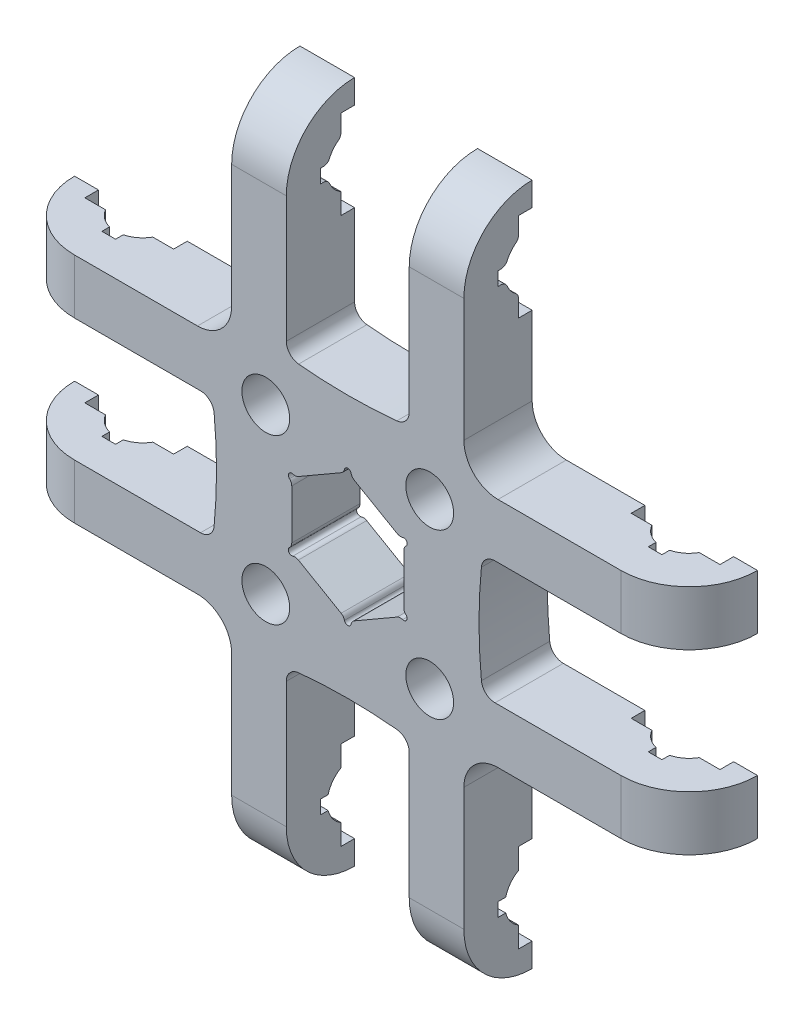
ISO-10303-21;
HEADER;
FILE_DESCRIPTION(('STEP AP214'),'2;1');
FILE_NAME('part.step','',(''),(''),'','','');
FILE_SCHEMA(('AUTOMOTIVE_DESIGN { 1 0 10303 214 1 1 1 1 }'));
ENDSEC;
DATA;
#1=APPLICATION_CONTEXT('core data for automotive mechanical design processes');
#2=APPLICATION_PROTOCOL_DEFINITION('international standard','automotive_design',2000,#1);
#3=PRODUCT_CONTEXT('',#1,'mechanical');
#4=PRODUCT('Part','Part','',(#3));
#5=PRODUCT_RELATED_PRODUCT_CATEGORY('part','',(#4));
#6=PRODUCT_DEFINITION_FORMATION('','',#4);
#7=PRODUCT_DEFINITION_CONTEXT('part definition',#1,'design');
#8=PRODUCT_DEFINITION('design','',#6,#7);
#9=PRODUCT_DEFINITION_SHAPE('','',#8);
#10=(LENGTH_UNIT() NAMED_UNIT(*) SI_UNIT(.MILLI.,.METRE.));
#11=(NAMED_UNIT(*) PLANE_ANGLE_UNIT() SI_UNIT($,.RADIAN.));
#12=(NAMED_UNIT(*) SI_UNIT($,.STERADIAN.) SOLID_ANGLE_UNIT());
#13=UNCERTAINTY_MEASURE_WITH_UNIT(LENGTH_MEASURE(1.E-05),#10,'distance_accuracy_value','');
#14=(GEOMETRIC_REPRESENTATION_CONTEXT(3) GLOBAL_UNCERTAINTY_ASSIGNED_CONTEXT((#13)) GLOBAL_UNIT_ASSIGNED_CONTEXT((#10,
#11,#12)) REPRESENTATION_CONTEXT('',''));
#15=CARTESIAN_POINT('',(0.,0.,0.));
#16=DIRECTION('',(0.,0.,1.));
#17=DIRECTION('',(1.,0.,0.));
#18=AXIS2_PLACEMENT_3D('',#15,#16,#17);
#19=CARTESIAN_POINT('',(-27.1293199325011,20.,5.));
#20=DIRECTION('',(1.,0.,0.));
#21=DIRECTION('',(0.,1.,0.));
#22=AXIS2_PLACEMENT_3D('',#19,#20,#21);
#23=CYLINDRICAL_SURFACE('',#22,5.);
#24=CARTESIAN_POINT('',(8.50000000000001,20.,5.));
#25=DIRECTION('',(1.,0.,0.));
#26=DIRECTION('',(0.,0.,-1.));
#27=AXIS2_PLACEMENT_3D('',#24,#25,#26);
#28=CIRCLE('',#27,5.);
#29=CARTESIAN_POINT('',(8.50000000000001,25.,5.));
#30=VERTEX_POINT('',#29);
#31=CARTESIAN_POINT('',(8.50000000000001,20.,10.));
#32=VERTEX_POINT('',#31);
#33=EDGE_CURVE('E1380',#30,#32,#28,.T.);
#34=ORIENTED_EDGE('',*,*,#33,.F.);
#35=DIRECTION('',(1.,0.,0.));
#36=VECTOR('',#35,1.);
#37=CARTESIAN_POINT('',(0.,25.,5.));
#38=LINE('',#37,#36);
#39=CARTESIAN_POINT('',(4.5,25.,5.));
#40=VERTEX_POINT('',#39);
#41=EDGE_CURVE('E2244',#40,#30,#38,.T.);
#42=ORIENTED_EDGE('',*,*,#41,.F.);
#43=CARTESIAN_POINT('',(4.5,20.,5.));
#44=DIRECTION('',(1.,0.,0.));
#45=DIRECTION('',(0.,1.,0.));
#46=AXIS2_PLACEMENT_3D('',#43,#44,#45);
#47=CIRCLE('',#46,5.);
#48=CARTESIAN_POINT('',(4.5,20.,10.));
#49=VERTEX_POINT('',#48);
#50=EDGE_CURVE('E1377',#40,#49,#47,.T.);
#51=ORIENTED_EDGE('',*,*,#50,.T.);
#52=DIRECTION('',(1.,0.,0.));
#53=VECTOR('',#52,1.);
#54=CARTESIAN_POINT('',(-27.1293199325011,20.,10.));
#55=LINE('',#54,#53);
#56=EDGE_CURVE('E1370',#49,#32,#55,.T.);
#57=ORIENTED_EDGE('',*,*,#56,.T.);
#58=EDGE_LOOP('',(#34,#42,#51,#57));
#59=FACE_BOUND('',#58,.T.);
#60=ADVANCED_FACE('F41',(#59),#23,.T.);
#61=CARTESIAN_POINT('',(-4.5,20.,5.));
#62=DIRECTION('',(1.,0.,0.));
#63=DIRECTION('',(0.,0.,-1.));
#64=AXIS2_PLACEMENT_3D('',#61,#62,#63);
#65=CIRCLE('',#64,5.);
#66=CARTESIAN_POINT('',(-4.5,25.,5.));
#67=VERTEX_POINT('',#66);
#68=CARTESIAN_POINT('',(-4.5,20.,10.));
#69=VERTEX_POINT('',#68);
#70=EDGE_CURVE('E1374',#67,#69,#65,.T.);
#71=ORIENTED_EDGE('',*,*,#70,.F.);
#72=CARTESIAN_POINT('',(-8.5,25.,5.));
#73=VERTEX_POINT('',#72);
#74=EDGE_CURVE('E2332',#73,#67,#38,.T.);
#75=ORIENTED_EDGE('',*,*,#74,.F.);
#76=CARTESIAN_POINT('',(-8.5,20.,5.));
#77=DIRECTION('',(1.,0.,0.));
#78=DIRECTION('',(0.,1.,0.));
#79=AXIS2_PLACEMENT_3D('',#76,#77,#78);
#80=CIRCLE('',#79,5.);
#81=CARTESIAN_POINT('',(-8.5,20.,10.));
#82=VERTEX_POINT('',#81);
#83=EDGE_CURVE('E1383',#73,#82,#80,.T.);
#84=ORIENTED_EDGE('',*,*,#83,.T.);
#85=EDGE_CURVE('E1373',#82,#69,#55,.T.);
#86=ORIENTED_EDGE('',*,*,#85,.T.);
#87=EDGE_LOOP('',(#71,#75,#84,#86));
#88=FACE_BOUND('',#87,.T.);
#89=ADVANCED_FACE('F2179',(#88),#23,.T.);
#90=CARTESIAN_POINT('',(27.1293199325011,-20.,5.));
#91=DIRECTION('',(-1.,0.,0.));
#92=DIRECTION('',(0.,-1.,0.));
#93=AXIS2_PLACEMENT_3D('',#90,#91,#92);
#94=CYLINDRICAL_SURFACE('',#93,5.);
#95=CARTESIAN_POINT('',(-8.5,-20.,5.));
#96=DIRECTION('',(-1.,0.,0.));
#97=DIRECTION('',(0.,0.,1.));
#98=AXIS2_PLACEMENT_3D('',#95,#96,#97);
#99=CIRCLE('',#98,5.);
#100=CARTESIAN_POINT('',(-8.5,-25.,5.));
#101=VERTEX_POINT('',#100);
#102=CARTESIAN_POINT('',(-8.5,-20.,10.));
#103=VERTEX_POINT('',#102);
#104=EDGE_CURVE('E1051',#101,#103,#99,.T.);
#105=ORIENTED_EDGE('',*,*,#104,.F.);
#106=DIRECTION('',(1.,0.,0.));
#107=VECTOR('',#106,1.);
#108=CARTESIAN_POINT('',(0.,-25.,5.));
#109=LINE('',#108,#107);
#110=CARTESIAN_POINT('',(-4.5,-25.,5.));
#111=VERTEX_POINT('',#110);
#112=EDGE_CURVE('E2410',#101,#111,#109,.T.);
#113=ORIENTED_EDGE('',*,*,#112,.T.);
#114=CARTESIAN_POINT('',(-4.5,-20.,5.));
#115=DIRECTION('',(1.,0.,0.));
#116=DIRECTION('',(0.,0.,-1.));
#117=AXIS2_PLACEMENT_3D('',#114,#115,#116);
#118=CIRCLE('',#117,5.);
#119=CARTESIAN_POINT('',(-4.5,-20.,10.));
#120=VERTEX_POINT('',#119);
#121=EDGE_CURVE('E1048',#120,#111,#118,.T.);
#122=ORIENTED_EDGE('',*,*,#121,.F.);
#123=DIRECTION('',(-1.,0.,0.));
#124=VECTOR('',#123,1.);
#125=CARTESIAN_POINT('',(27.1293199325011,-20.,10.));
#126=LINE('',#125,#124);
#127=EDGE_CURVE('E2052',#120,#103,#126,.T.);
#128=ORIENTED_EDGE('',*,*,#127,.T.);
#129=EDGE_LOOP('',(#105,#113,#122,#128));
#130=FACE_BOUND('',#129,.T.);
#131=ADVANCED_FACE('F2266',(#130),#94,.T.);
#132=CARTESIAN_POINT('',(4.5,-20.,5.));
#133=DIRECTION('',(-1.,0.,0.));
#134=DIRECTION('',(0.,-1.,0.));
#135=AXIS2_PLACEMENT_3D('',#132,#133,#134);
#136=CIRCLE('',#135,5.);
#137=CARTESIAN_POINT('',(4.5,-25.,5.));
#138=VERTEX_POINT('',#137);
#139=CARTESIAN_POINT('',(4.5,-20.,10.));
#140=VERTEX_POINT('',#139);
#141=EDGE_CURVE('E1041',#138,#140,#136,.T.);
#142=ORIENTED_EDGE('',*,*,#141,.F.);
#143=CARTESIAN_POINT('',(8.49999999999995,-25.,5.));
#144=VERTEX_POINT('',#143);
#145=EDGE_CURVE('E2333',#138,#144,#109,.T.);
#146=ORIENTED_EDGE('',*,*,#145,.T.);
#147=CARTESIAN_POINT('',(8.49999999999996,-20.,5.));
#148=DIRECTION('',(1.,0.,0.));
#149=DIRECTION('',(0.,1.,0.));
#150=AXIS2_PLACEMENT_3D('',#147,#148,#149);
#151=CIRCLE('',#150,5.);
#152=CARTESIAN_POINT('',(8.5,-20.,10.));
#153=VERTEX_POINT('',#152);
#154=EDGE_CURVE('E1037',#153,#144,#151,.T.);
#155=ORIENTED_EDGE('',*,*,#154,.F.);
#156=EDGE_CURVE('E2055',#153,#140,#126,.T.);
#157=ORIENTED_EDGE('',*,*,#156,.T.);
#158=EDGE_LOOP('',(#142,#146,#155,#157));
#159=FACE_BOUND('',#158,.T.);
#160=ADVANCED_FACE('F2440',(#159),#94,.T.);
#161=CARTESIAN_POINT('',(0.,8.5,10.));
#162=DIRECTION('',(0.,1.,0.));
#163=DIRECTION('',(0.,0.,1.));
#164=AXIS2_PLACEMENT_3D('',#161,#162,#163);
#165=PLANE('',#164);
#166=DIRECTION('',(1.,0.,0.));
#167=VECTOR('',#166,1.);
#168=CARTESIAN_POINT('',(0.,8.5,5.));
#169=LINE('',#168,#167);
#170=CARTESIAN_POINT('',(-25.,8.5,5.));
#171=VERTEX_POINT('',#170);
#172=CARTESIAN_POINT('',(-23.25,8.5,5.));
#173=VERTEX_POINT('',#172);
#174=EDGE_CURVE('E2032',#171,#173,#169,.T.);
#175=ORIENTED_EDGE('',*,*,#174,.F.);
#176=CARTESIAN_POINT('',(-20.,8.5,5.));
#177=DIRECTION('',(0.,1.,0.));
#178=DIRECTION('',(0.,0.,1.));
#179=AXIS2_PLACEMENT_3D('',#176,#177,#178);
#180=CIRCLE('',#179,5.);
#181=CARTESIAN_POINT('',(-20.,8.5,10.));
#182=VERTEX_POINT('',#181);
#183=EDGE_CURVE('E1061',#171,#182,#180,.T.);
#184=ORIENTED_EDGE('',*,*,#183,.T.);
#185=DIRECTION('',(1.,0.,0.));
#186=VECTOR('',#185,1.);
#187=CARTESIAN_POINT('',(0.,8.5,10.));
#188=LINE('',#187,#186);
#189=CARTESIAN_POINT('',(-11.,8.5,10.));
#190=VERTEX_POINT('',#189);
#191=EDGE_CURVE('E1498',#182,#190,#188,.T.);
#192=ORIENTED_EDGE('',*,*,#191,.T.);
#193=DIRECTION('',(0.,0.,-1.));
#194=VECTOR('',#193,1.);
#195=CARTESIAN_POINT('',(-11.,8.5,10.));
#196=LINE('',#195,#194);
#197=CARTESIAN_POINT('',(-11.,8.5,5.));
#198=VERTEX_POINT('',#197);
#199=EDGE_CURVE('E1631',#190,#198,#196,.T.);
#200=ORIENTED_EDGE('',*,*,#199,.T.);
#201=CARTESIAN_POINT('',(-16.75,8.5,5.));
#202=VERTEX_POINT('',#201);
#203=EDGE_CURVE('E2189',#202,#198,#169,.T.);
#204=ORIENTED_EDGE('',*,*,#203,.F.);
#205=DIRECTION('',(0.,0.,-1.));
#206=VECTOR('',#205,1.);
#207=CARTESIAN_POINT('',(-16.75,8.5,10.));
#208=LINE('',#207,#206);
#209=CARTESIAN_POINT('',(-16.75,8.5,6.));
#210=VERTEX_POINT('',#209);
#211=EDGE_CURVE('E1335',#210,#202,#208,.T.);
#212=ORIENTED_EDGE('',*,*,#211,.F.);
#213=DIRECTION('',(1.,0.,0.));
#214=VECTOR('',#213,1.);
#215=CARTESIAN_POINT('',(0.,8.5,6.));
#216=LINE('',#215,#214);
#217=CARTESIAN_POINT('',(-18.2679491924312,8.5,6.));
#218=VERTEX_POINT('',#217);
#219=EDGE_CURVE('E1259',#218,#210,#216,.T.);
#220=ORIENTED_EDGE('',*,*,#219,.F.);
#221=CARTESIAN_POINT('',(-20.,8.5,5.));
#222=DIRECTION('',(0.,1.,0.));
#223=DIRECTION('',(0.,0.,1.));
#224=AXIS2_PLACEMENT_3D('',#221,#222,#223);
#225=CIRCLE('',#224,2.);
#226=CARTESIAN_POINT('',(-19.5,8.5,6.93649167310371));
#227=VERTEX_POINT('',#226);
#228=EDGE_CURVE('E1367',#227,#218,#225,.T.);
#229=ORIENTED_EDGE('',*,*,#228,.F.);
#230=DIRECTION('',(0.,0.,1.));
#231=VECTOR('',#230,1.);
#232=CARTESIAN_POINT('',(-19.5,8.5,10.));
#233=LINE('',#232,#231);
#234=CARTESIAN_POINT('',(-19.5,8.5,7.5));
#235=VERTEX_POINT('',#234);
#236=EDGE_CURVE('E1359',#227,#235,#233,.T.);
#237=ORIENTED_EDGE('',*,*,#236,.T.);
#238=DIRECTION('',(1.,0.,0.));
#239=VECTOR('',#238,1.);
#240=CARTESIAN_POINT('',(0.,8.5,7.50000000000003));
#241=LINE('',#240,#239);
#242=CARTESIAN_POINT('',(-20.5,8.5,7.5));
#243=VERTEX_POINT('',#242);
#244=EDGE_CURVE('E1236',#243,#235,#241,.T.);
#245=ORIENTED_EDGE('',*,*,#244,.F.);
#246=DIRECTION('',(0.,0.,1.));
#247=VECTOR('',#246,1.);
#248=CARTESIAN_POINT('',(-20.5,8.5,10.));
#249=LINE('',#248,#247);
#250=CARTESIAN_POINT('',(-20.5,8.5,6.93649167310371));
#251=VERTEX_POINT('',#250);
#252=EDGE_CURVE('E1350',#251,#243,#249,.T.);
#253=ORIENTED_EDGE('',*,*,#252,.F.);
#254=CARTESIAN_POINT('',(-20.,8.5,5.));
#255=DIRECTION('',(0.,1.,0.));
#256=DIRECTION('',(0.,0.,1.));
#257=AXIS2_PLACEMENT_3D('',#254,#255,#256);
#258=CIRCLE('',#257,2.);
#259=CARTESIAN_POINT('',(-21.7320508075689,8.5,6.));
#260=VERTEX_POINT('',#259);
#261=EDGE_CURVE('E1343',#260,#251,#258,.T.);
#262=ORIENTED_EDGE('',*,*,#261,.F.);
#263=DIRECTION('',(1.,0.,0.));
#264=VECTOR('',#263,1.);
#265=CARTESIAN_POINT('',(0.,8.5,6.));
#266=LINE('',#265,#264);
#267=CARTESIAN_POINT('',(-23.25,8.5,6.));
#268=VERTEX_POINT('',#267);
#269=EDGE_CURVE('E1327',#268,#260,#266,.T.);
#270=ORIENTED_EDGE('',*,*,#269,.F.);
#271=DIRECTION('',(0.,0.,-1.));
#272=VECTOR('',#271,1.);
#273=CARTESIAN_POINT('',(-23.25,8.5,10.));
#274=LINE('',#273,#272);
#275=EDGE_CURVE('E1318',#268,#173,#274,.T.);
#276=ORIENTED_EDGE('',*,*,#275,.T.);
#277=EDGE_LOOP('',(#175,#184,#192,#200,#204,#212,#220,#229,#237,#245,#253,#262,#270,#276));
#278=FACE_BOUND('',#277,.T.);
#279=ADVANCED_FACE('F2347',(#278),#165,.T.);
#280=CARTESIAN_POINT('',(0.,4.5,10.));
#281=DIRECTION('',(0.,-1.,0.));
#282=DIRECTION('',(1.,0.,0.));
#283=AXIS2_PLACEMENT_3D('',#280,#281,#282);
#284=PLANE('',#283);
#285=DIRECTION('',(-1.,0.,0.));
#286=VECTOR('',#285,1.);
#287=CARTESIAN_POINT('',(0.,4.5,5.));
#288=LINE('',#287,#286);
#289=CARTESIAN_POINT('',(-10.7797831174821,4.5,5.));
#290=VERTEX_POINT('',#289);
#291=CARTESIAN_POINT('',(-16.75,4.5,5.));
#292=VERTEX_POINT('',#291);
#293=EDGE_CURVE('E2202',#290,#292,#288,.T.);
#294=ORIENTED_EDGE('',*,*,#293,.F.);
#295=DIRECTION('',(0.,0.,-1.));
#296=VECTOR('',#295,1.);
#297=CARTESIAN_POINT('',(-10.7797831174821,4.5,10.));
#298=LINE('',#297,#296);
#299=CARTESIAN_POINT('',(-10.7797831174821,4.5,10.));
#300=VERTEX_POINT('',#299);
#301=EDGE_CURVE('E1698',#290,#300,#298,.F.);
#302=ORIENTED_EDGE('',*,*,#301,.T.);
#303=DIRECTION('',(-1.,0.,0.));
#304=VECTOR('',#303,1.);
#305=CARTESIAN_POINT('',(0.,4.5,10.));
#306=LINE('',#305,#304);
#307=CARTESIAN_POINT('',(-20.,4.5,10.));
#308=VERTEX_POINT('',#307);
#309=EDGE_CURVE('E1502',#300,#308,#306,.T.);
#310=ORIENTED_EDGE('',*,*,#309,.T.);
#311=CARTESIAN_POINT('',(-20.,4.5,5.));
#312=DIRECTION('',(0.,-1.,0.));
#313=DIRECTION('',(1.,0.,0.));
#314=AXIS2_PLACEMENT_3D('',#311,#312,#313);
#315=CIRCLE('',#314,5.);
#316=CARTESIAN_POINT('',(-25.,4.5,5.));
#317=VERTEX_POINT('',#316);
#318=EDGE_CURVE('E1058',#308,#317,#315,.T.);
#319=ORIENTED_EDGE('',*,*,#318,.T.);
#320=CARTESIAN_POINT('',(-23.25,4.5,5.));
#321=VERTEX_POINT('',#320);
#322=EDGE_CURVE('E2028',#321,#317,#288,.T.);
#323=ORIENTED_EDGE('',*,*,#322,.F.);
#324=DIRECTION('',(0.,0.,1.));
#325=VECTOR('',#324,1.);
#326=CARTESIAN_POINT('',(-23.25,4.5,10.));
#327=LINE('',#326,#325);
#328=CARTESIAN_POINT('',(-23.25,4.5,6.));
#329=VERTEX_POINT('',#328);
#330=EDGE_CURVE('E1316',#321,#329,#327,.T.);
#331=ORIENTED_EDGE('',*,*,#330,.T.);
#332=DIRECTION('',(-1.,0.,0.));
#333=VECTOR('',#332,1.);
#334=CARTESIAN_POINT('',(0.,4.5,6.));
#335=LINE('',#334,#333);
#336=CARTESIAN_POINT('',(-21.7320508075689,4.5,6.));
#337=VERTEX_POINT('',#336);
#338=EDGE_CURVE('E1324',#337,#329,#335,.T.);
#339=ORIENTED_EDGE('',*,*,#338,.F.);
#340=CARTESIAN_POINT('',(-20.,4.5,5.));
#341=DIRECTION('',(0.,-1.,0.));
#342=DIRECTION('',(1.,0.,0.));
#343=AXIS2_PLACEMENT_3D('',#340,#341,#342);
#344=CIRCLE('',#343,2.);
#345=CARTESIAN_POINT('',(-20.5,4.5,6.93649167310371));
#346=VERTEX_POINT('',#345);
#347=EDGE_CURVE('E1341',#346,#337,#344,.T.);
#348=ORIENTED_EDGE('',*,*,#347,.F.);
#349=DIRECTION('',(0.,0.,-1.));
#350=VECTOR('',#349,1.);
#351=CARTESIAN_POINT('',(-20.5,4.5,10.));
#352=LINE('',#351,#350);
#353=CARTESIAN_POINT('',(-20.5,4.5,7.5));
#354=VERTEX_POINT('',#353);
#355=EDGE_CURVE('E1348',#354,#346,#352,.T.);
#356=ORIENTED_EDGE('',*,*,#355,.F.);
#357=DIRECTION('',(-1.,0.,0.));
#358=VECTOR('',#357,1.);
#359=CARTESIAN_POINT('',(0.,4.5,7.50000000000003));
#360=LINE('',#359,#358);
#361=CARTESIAN_POINT('',(-19.5,4.5,7.5));
#362=VERTEX_POINT('',#361);
#363=EDGE_CURVE('E1234',#362,#354,#360,.T.);
#364=ORIENTED_EDGE('',*,*,#363,.F.);
#365=DIRECTION('',(0.,0.,-1.));
#366=VECTOR('',#365,1.);
#367=CARTESIAN_POINT('',(-19.5,4.5,10.));
#368=LINE('',#367,#366);
#369=CARTESIAN_POINT('',(-19.5,4.5,6.93649167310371));
#370=VERTEX_POINT('',#369);
#371=EDGE_CURVE('E1356',#362,#370,#368,.T.);
#372=ORIENTED_EDGE('',*,*,#371,.T.);
#373=CARTESIAN_POINT('',(-20.,4.5,5.));
#374=DIRECTION('',(0.,-1.,0.));
#375=DIRECTION('',(1.,0.,0.));
#376=AXIS2_PLACEMENT_3D('',#373,#374,#375);
#377=CIRCLE('',#376,2.);
#378=CARTESIAN_POINT('',(-18.2679491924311,4.5,6.));
#379=VERTEX_POINT('',#378);
#380=EDGE_CURVE('E1365',#379,#370,#377,.T.);
#381=ORIENTED_EDGE('',*,*,#380,.F.);
#382=DIRECTION('',(-1.,0.,0.));
#383=VECTOR('',#382,1.);
#384=CARTESIAN_POINT('',(0.,4.5,6.));
#385=LINE('',#384,#383);
#386=CARTESIAN_POINT('',(-16.75,4.5,6.));
#387=VERTEX_POINT('',#386);
#388=EDGE_CURVE('E1257',#387,#379,#385,.T.);
#389=ORIENTED_EDGE('',*,*,#388,.F.);
#390=DIRECTION('',(0.,0.,1.));
#391=VECTOR('',#390,1.);
#392=CARTESIAN_POINT('',(-16.75,4.5,10.));
#393=LINE('',#392,#391);
#394=EDGE_CURVE('E1333',#292,#387,#393,.T.);
#395=ORIENTED_EDGE('',*,*,#394,.F.);
#396=EDGE_LOOP('',(#294,#302,#310,#319,#323,#331,#339,#348,#356,#364,#372,#381,#389,#395));
#397=FACE_BOUND('',#396,.T.);
#398=ADVANCED_FACE('F2361',(#397),#284,.T.);
#399=CARTESIAN_POINT('',(0.,-4.5,10.));
#400=DIRECTION('',(0.,1.,0.));
#401=DIRECTION('',(-1.,0.,0.));
#402=AXIS2_PLACEMENT_3D('',#399,#400,#401);
#403=PLANE('',#402);
#404=DIRECTION('',(1.,0.,0.));
#405=VECTOR('',#404,1.);
#406=CARTESIAN_POINT('',(0.,-4.5,5.));
#407=LINE('',#406,#405);
#408=CARTESIAN_POINT('',(-25.,-4.5,5.));
#409=VERTEX_POINT('',#408);
#410=CARTESIAN_POINT('',(-23.25,-4.5,5.));
#411=VERTEX_POINT('',#410);
#412=EDGE_CURVE('E2036',#409,#411,#407,.T.);
#413=ORIENTED_EDGE('',*,*,#412,.F.);
#414=CARTESIAN_POINT('',(-20.,-4.5,5.));
#415=DIRECTION('',(0.,1.,0.));
#416=DIRECTION('',(-1.,0.,0.));
#417=AXIS2_PLACEMENT_3D('',#414,#415,#416);
#418=CIRCLE('',#417,5.);
#419=CARTESIAN_POINT('',(-20.,-4.5,10.));
#420=VERTEX_POINT('',#419);
#421=EDGE_CURVE('E1056',#409,#420,#418,.T.);
#422=ORIENTED_EDGE('',*,*,#421,.T.);
#423=DIRECTION('',(1.,0.,0.));
#424=VECTOR('',#423,1.);
#425=CARTESIAN_POINT('',(0.,-4.5,10.));
#426=LINE('',#425,#424);
#427=CARTESIAN_POINT('',(-10.7797831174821,-4.5,10.));
#428=VERTEX_POINT('',#427);
#429=EDGE_CURVE('E1507',#420,#428,#426,.T.);
#430=ORIENTED_EDGE('',*,*,#429,.T.);
#431=DIRECTION('',(0.,0.,-1.));
#432=VECTOR('',#431,1.);
#433=CARTESIAN_POINT('',(-10.7797831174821,-4.5,10.));
#434=LINE('',#433,#432);
#435=CARTESIAN_POINT('',(-10.7797831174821,-4.5,5.));
#436=VERTEX_POINT('',#435);
#437=EDGE_CURVE('E1690',#428,#436,#434,.T.);
#438=ORIENTED_EDGE('',*,*,#437,.T.);
#439=CARTESIAN_POINT('',(-16.75,-4.5,5.));
#440=VERTEX_POINT('',#439);
#441=EDGE_CURVE('E2192',#440,#436,#407,.T.);
#442=ORIENTED_EDGE('',*,*,#441,.F.);
#443=DIRECTION('',(0.,0.,-1.));
#444=VECTOR('',#443,1.);
#445=CARTESIAN_POINT('',(-16.75,-4.5,10.));
#446=LINE('',#445,#444);
#447=CARTESIAN_POINT('',(-16.75,-4.5,6.));
#448=VERTEX_POINT('',#447);
#449=EDGE_CURVE('E1330',#448,#440,#446,.T.);
#450=ORIENTED_EDGE('',*,*,#449,.F.);
#451=DIRECTION('',(1.,0.,0.));
#452=VECTOR('',#451,1.);
#453=CARTESIAN_POINT('',(0.,-4.5,6.));
#454=LINE('',#453,#452);
#455=CARTESIAN_POINT('',(-18.2679491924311,-4.5,6.));
#456=VERTEX_POINT('',#455);
#457=EDGE_CURVE('E1255',#456,#448,#454,.T.);
#458=ORIENTED_EDGE('',*,*,#457,.F.);
#459=CARTESIAN_POINT('',(-20.,-4.5,5.));
#460=DIRECTION('',(0.,1.,0.));
#461=DIRECTION('',(-1.,0.,0.));
#462=AXIS2_PLACEMENT_3D('',#459,#460,#461);
#463=CIRCLE('',#462,2.);
#464=CARTESIAN_POINT('',(-19.5,-4.5,6.93649167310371));
#465=VERTEX_POINT('',#464);
#466=EDGE_CURVE('E1363',#465,#456,#463,.T.);
#467=ORIENTED_EDGE('',*,*,#466,.F.);
#468=DIRECTION('',(0.,0.,1.));
#469=VECTOR('',#468,1.);
#470=CARTESIAN_POINT('',(-19.5,-4.5,10.));
#471=LINE('',#470,#469);
#472=CARTESIAN_POINT('',(-19.5,-4.5,7.5));
#473=VERTEX_POINT('',#472);
#474=EDGE_CURVE('E1353',#465,#473,#471,.T.);
#475=ORIENTED_EDGE('',*,*,#474,.T.);
#476=DIRECTION('',(1.,0.,0.));
#477=VECTOR('',#476,1.);
#478=CARTESIAN_POINT('',(0.,-4.5,7.50000000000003));
#479=LINE('',#478,#477);
#480=CARTESIAN_POINT('',(-20.5,-4.5,7.5));
#481=VERTEX_POINT('',#480);
#482=EDGE_CURVE('E1232',#481,#473,#479,.T.);
#483=ORIENTED_EDGE('',*,*,#482,.F.);
#484=DIRECTION('',(0.,0.,1.));
#485=VECTOR('',#484,1.);
#486=CARTESIAN_POINT('',(-20.5,-4.5,10.));
#487=LINE('',#486,#485);
#488=CARTESIAN_POINT('',(-20.5,-4.5,6.93649167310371));
#489=VERTEX_POINT('',#488);
#490=EDGE_CURVE('E1346',#489,#481,#487,.T.);
#491=ORIENTED_EDGE('',*,*,#490,.F.);
#492=CARTESIAN_POINT('',(-20.,-4.5,5.));
#493=DIRECTION('',(0.,1.,0.));
#494=DIRECTION('',(-1.,0.,0.));
#495=AXIS2_PLACEMENT_3D('',#492,#493,#494);
#496=CIRCLE('',#495,2.);
#497=CARTESIAN_POINT('',(-21.7320508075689,-4.5,6.));
#498=VERTEX_POINT('',#497);
#499=EDGE_CURVE('E1339',#498,#489,#496,.T.);
#500=ORIENTED_EDGE('',*,*,#499,.F.);
#501=DIRECTION('',(1.,0.,0.));
#502=VECTOR('',#501,1.);
#503=CARTESIAN_POINT('',(0.,-4.5,6.));
#504=LINE('',#503,#502);
#505=CARTESIAN_POINT('',(-23.25,-4.5,6.));
#506=VERTEX_POINT('',#505);
#507=EDGE_CURVE('E1322',#506,#498,#504,.T.);
#508=ORIENTED_EDGE('',*,*,#507,.F.);
#509=DIRECTION('',(0.,0.,-1.));
#510=VECTOR('',#509,1.);
#511=CARTESIAN_POINT('',(-23.25,-4.5,10.));
#512=LINE('',#511,#510);
#513=EDGE_CURVE('E1313',#506,#411,#512,.T.);
#514=ORIENTED_EDGE('',*,*,#513,.T.);
#515=EDGE_LOOP('',(#413,#422,#430,#438,#442,#450,#458,#467,#475,#483,#491,#500,#508,#514));
#516=FACE_BOUND('',#515,.T.);
#517=ADVANCED_FACE('F2382',(#516),#403,.T.);
#518=CARTESIAN_POINT('',(0.,-8.50000000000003,10.));
#519=DIRECTION('',(0.,-1.,0.));
#520=DIRECTION('',(1.,0.,0.));
#521=AXIS2_PLACEMENT_3D('',#518,#519,#520);
#522=PLANE('',#521);
#523=DIRECTION('',(-1.,0.,0.));
#524=VECTOR('',#523,1.);
#525=CARTESIAN_POINT('',(0.,-8.50000000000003,5.));
#526=LINE('',#525,#524);
#527=CARTESIAN_POINT('',(-11.,-8.49999999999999,5.));
#528=VERTEX_POINT('',#527);
#529=CARTESIAN_POINT('',(-16.75,-8.49999999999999,5.));
#530=VERTEX_POINT('',#529);
#531=EDGE_CURVE('E2212',#528,#530,#526,.T.);
#532=ORIENTED_EDGE('',*,*,#531,.F.);
#533=DIRECTION('',(0.,0.,-1.));
#534=VECTOR('',#533,1.);
#535=CARTESIAN_POINT('',(-11.,-8.49999999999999,10.));
#536=LINE('',#535,#534);
#537=CARTESIAN_POINT('',(-11.,-8.49999999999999,10.));
#538=VERTEX_POINT('',#537);
#539=EDGE_CURVE('E1650',#528,#538,#536,.F.);
#540=ORIENTED_EDGE('',*,*,#539,.T.);
#541=DIRECTION('',(-1.,0.,0.));
#542=VECTOR('',#541,1.);
#543=CARTESIAN_POINT('',(0.,-8.50000000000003,10.));
#544=LINE('',#543,#542);
#545=CARTESIAN_POINT('',(-20.,-8.5,10.));
#546=VERTEX_POINT('',#545);
#547=EDGE_CURVE('E1510',#538,#546,#544,.T.);
#548=ORIENTED_EDGE('',*,*,#547,.T.);
#549=CARTESIAN_POINT('',(-20.,-8.49999999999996,5.));
#550=DIRECTION('',(0.,-1.,0.));
#551=DIRECTION('',(1.,0.,0.));
#552=AXIS2_PLACEMENT_3D('',#549,#550,#551);
#553=CIRCLE('',#552,5.);
#554=CARTESIAN_POINT('',(-25.,-8.49999999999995,5.));
#555=VERTEX_POINT('',#554);
#556=EDGE_CURVE('E1053',#546,#555,#553,.T.);
#557=ORIENTED_EDGE('',*,*,#556,.T.);
#558=CARTESIAN_POINT('',(-23.25,-8.49999999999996,5.));
#559=VERTEX_POINT('',#558);
#560=EDGE_CURVE('E2031',#559,#555,#526,.T.);
#561=ORIENTED_EDGE('',*,*,#560,.F.);
#562=DIRECTION('',(0.,0.,1.));
#563=VECTOR('',#562,1.);
#564=CARTESIAN_POINT('',(-23.25,-8.49999999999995,10.));
#565=LINE('',#564,#563);
#566=CARTESIAN_POINT('',(-23.25,-8.49999999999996,6.));
#567=VERTEX_POINT('',#566);
#568=EDGE_CURVE('E1615',#559,#567,#565,.T.);
#569=ORIENTED_EDGE('',*,*,#568,.T.);
#570=DIRECTION('',(-1.,0.,0.));
#571=VECTOR('',#570,1.);
#572=CARTESIAN_POINT('',(0.,-8.50000000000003,6.));
#573=LINE('',#572,#571);
#574=CARTESIAN_POINT('',(-21.7320508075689,-8.49999999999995,6.));
#575=VERTEX_POINT('',#574);
#576=EDGE_CURVE('E1617',#575,#567,#573,.T.);
#577=ORIENTED_EDGE('',*,*,#576,.F.);
#578=CARTESIAN_POINT('',(-20.,-8.49999999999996,5.));
#579=DIRECTION('',(0.,-1.,0.));
#580=DIRECTION('',(1.,0.,0.));
#581=AXIS2_PLACEMENT_3D('',#578,#579,#580);
#582=CIRCLE('',#581,2.);
#583=CARTESIAN_POINT('',(-20.5,-8.49999999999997,6.93649167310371));
#584=VERTEX_POINT('',#583);
#585=EDGE_CURVE('E1620',#584,#575,#582,.T.);
#586=ORIENTED_EDGE('',*,*,#585,.F.);
#587=DIRECTION('',(0.,0.,-1.));
#588=VECTOR('',#587,1.);
#589=CARTESIAN_POINT('',(-20.5,-8.49999999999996,10.));
#590=LINE('',#589,#588);
#591=CARTESIAN_POINT('',(-20.5,-8.49999999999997,7.5));
#592=VERTEX_POINT('',#591);
#593=EDGE_CURVE('E1622',#592,#584,#590,.T.);
#594=ORIENTED_EDGE('',*,*,#593,.F.);
#595=DIRECTION('',(-1.,0.,0.));
#596=VECTOR('',#595,1.);
#597=CARTESIAN_POINT('',(0.,-8.50000000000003,7.50000000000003));
#598=LINE('',#597,#596);
#599=CARTESIAN_POINT('',(-19.5,-8.49999999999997,7.5));
#600=VERTEX_POINT('',#599);
#601=EDGE_CURVE('E1230',#600,#592,#598,.T.);
#602=ORIENTED_EDGE('',*,*,#601,.F.);
#603=DIRECTION('',(0.,0.,-1.));
#604=VECTOR('',#603,1.);
#605=CARTESIAN_POINT('',(-19.5,-8.49999999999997,10.));
#606=LINE('',#605,#604);
#607=CARTESIAN_POINT('',(-19.5,-8.49999999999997,6.93649167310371));
#608=VERTEX_POINT('',#607);
#609=EDGE_CURVE('E1626',#600,#608,#606,.T.);
#610=ORIENTED_EDGE('',*,*,#609,.T.);
#611=CARTESIAN_POINT('',(-20.,-8.49999999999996,5.));
#612=DIRECTION('',(0.,-1.,0.));
#613=DIRECTION('',(1.,0.,0.));
#614=AXIS2_PLACEMENT_3D('',#611,#612,#613);
#615=CIRCLE('',#614,2.);
#616=CARTESIAN_POINT('',(-18.2679491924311,-8.49999999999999,6.));
#617=VERTEX_POINT('',#616);
#618=EDGE_CURVE('E1629',#617,#608,#615,.T.);
#619=ORIENTED_EDGE('',*,*,#618,.F.);
#620=DIRECTION('',(-1.,0.,0.));
#621=VECTOR('',#620,1.);
#622=CARTESIAN_POINT('',(0.,-8.50000000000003,6.));
#623=LINE('',#622,#621);
#624=CARTESIAN_POINT('',(-16.75,-8.49999999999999,6.));
#625=VERTEX_POINT('',#624);
#626=EDGE_CURVE('E1253',#625,#617,#623,.T.);
#627=ORIENTED_EDGE('',*,*,#626,.F.);
#628=DIRECTION('',(0.,0.,1.));
#629=VECTOR('',#628,1.);
#630=CARTESIAN_POINT('',(-16.75,-8.49999999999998,10.));
#631=LINE('',#630,#629);
#632=EDGE_CURVE('E1624',#530,#625,#631,.T.);
#633=ORIENTED_EDGE('',*,*,#632,.F.);
#634=EDGE_LOOP('',(#532,#540,#548,#557,#561,#569,#577,#586,#594,#602,#610,#619,#627,#633));
#635=FACE_BOUND('',#634,.T.);
#636=ADVANCED_FACE('F3244',(#635),#522,.T.);
#637=CARTESIAN_POINT('',(-8.5,0.,10.));
#638=DIRECTION('',(-1.,0.,0.));
#639=DIRECTION('',(0.,0.,1.));
#640=AXIS2_PLACEMENT_3D('',#637,#638,#639);
#641=PLANE('',#640);
#642=DIRECTION('',(0.,1.,0.));
#643=VECTOR('',#642,1.);
#644=CARTESIAN_POINT('',(-8.5,0.,5.));
#645=LINE('',#644,#643);
#646=CARTESIAN_POINT('',(-8.5,-23.25,5.));
#647=VERTEX_POINT('',#646);
#648=EDGE_CURVE('E2039',#101,#647,#645,.T.);
#649=ORIENTED_EDGE('',*,*,#648,.F.);
#650=ORIENTED_EDGE('',*,*,#104,.T.);
#651=DIRECTION('',(0.,1.,0.));
#652=VECTOR('',#651,1.);
#653=CARTESIAN_POINT('',(-8.5,0.,10.));
#654=LINE('',#653,#652);
#655=CARTESIAN_POINT('',(-8.5,-11.,10.));
#656=VERTEX_POINT('',#655);
#657=EDGE_CURVE('E1512',#103,#656,#654,.T.);
#658=ORIENTED_EDGE('',*,*,#657,.T.);
#659=DIRECTION('',(0.,0.,-1.));
#660=VECTOR('',#659,1.);
#661=CARTESIAN_POINT('',(-8.5,-11.,0.));
#662=LINE('',#661,#660);
#663=CARTESIAN_POINT('',(-8.5,-11.,5.));
#664=VERTEX_POINT('',#663);
#665=EDGE_CURVE('E1647',#656,#664,#662,.T.);
#666=ORIENTED_EDGE('',*,*,#665,.T.);
#667=CARTESIAN_POINT('',(-8.5,-16.75,5.));
#668=VERTEX_POINT('',#667);
#669=EDGE_CURVE('E2224',#668,#664,#645,.T.);
#670=ORIENTED_EDGE('',*,*,#669,.F.);
#671=DIRECTION('',(0.,0.,-1.));
#672=VECTOR('',#671,1.);
#673=CARTESIAN_POINT('',(-8.5,-16.75,10.));
#674=LINE('',#673,#672);
#675=CARTESIAN_POINT('',(-8.5,-16.75,6.));
#676=VERTEX_POINT('',#675);
#677=EDGE_CURVE('E1295',#676,#668,#674,.T.);
#678=ORIENTED_EDGE('',*,*,#677,.F.);
#679=DIRECTION('',(0.,1.,0.));
#680=VECTOR('',#679,1.);
#681=CARTESIAN_POINT('',(-8.5,0.,6.));
#682=LINE('',#681,#680);
#683=CARTESIAN_POINT('',(-8.5,-18.2679491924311,6.));
#684=VERTEX_POINT('',#683);
#685=EDGE_CURVE('E1251',#684,#676,#682,.T.);
#686=ORIENTED_EDGE('',*,*,#685,.F.);
#687=CARTESIAN_POINT('',(-8.5,-20.,5.));
#688=DIRECTION('',(-1.,0.,0.));
#689=DIRECTION('',(0.,0.,1.));
#690=AXIS2_PLACEMENT_3D('',#687,#688,#689);
#691=CIRCLE('',#690,2.);
#692=CARTESIAN_POINT('',(-8.5,-19.5,6.93649167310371));
#693=VERTEX_POINT('',#692);
#694=EDGE_CURVE('E1282',#693,#684,#691,.T.);
#695=ORIENTED_EDGE('',*,*,#694,.F.);
#696=DIRECTION('',(0.,0.,1.));
#697=VECTOR('',#696,1.);
#698=CARTESIAN_POINT('',(-8.5,-19.5,10.));
#699=LINE('',#698,#697);
#700=CARTESIAN_POINT('',(-8.5,-19.5,7.5));
#701=VERTEX_POINT('',#700);
#702=EDGE_CURVE('E1268',#693,#701,#699,.T.);
#703=ORIENTED_EDGE('',*,*,#702,.T.);
#704=DIRECTION('',(0.,1.,0.));
#705=VECTOR('',#704,1.);
#706=CARTESIAN_POINT('',(-8.5,0.,7.50000000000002));
#707=LINE('',#706,#705);
#708=CARTESIAN_POINT('',(-8.5,-20.5,7.5));
#709=VERTEX_POINT('',#708);
#710=EDGE_CURVE('E1227',#709,#701,#707,.T.);
#711=ORIENTED_EDGE('',*,*,#710,.F.);
#712=DIRECTION('',(0.,0.,1.));
#713=VECTOR('',#712,1.);
#714=CARTESIAN_POINT('',(-8.5,-20.5,10.));
#715=LINE('',#714,#713);
#716=CARTESIAN_POINT('',(-8.5,-20.5,6.93649167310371));
#717=VERTEX_POINT('',#716);
#718=EDGE_CURVE('E1275',#717,#709,#715,.T.);
#719=ORIENTED_EDGE('',*,*,#718,.F.);
#720=CARTESIAN_POINT('',(-8.5,-20.,5.));
#721=DIRECTION('',(-1.,0.,0.));
#722=DIRECTION('',(0.,0.,1.));
#723=AXIS2_PLACEMENT_3D('',#720,#721,#722);
#724=CIRCLE('',#723,2.);
#725=CARTESIAN_POINT('',(-8.5,-21.7320508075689,6.));
#726=VERTEX_POINT('',#725);
#727=EDGE_CURVE('E1288',#726,#717,#724,.T.);
#728=ORIENTED_EDGE('',*,*,#727,.F.);
#729=DIRECTION('',(0.,1.,0.));
#730=VECTOR('',#729,1.);
#731=CARTESIAN_POINT('',(-8.5,0.,6.));
#732=LINE('',#731,#730);
#733=CARTESIAN_POINT('',(-8.5,-23.25,6.));
#734=VERTEX_POINT('',#733);
#735=EDGE_CURVE('E1311',#734,#726,#732,.T.);
#736=ORIENTED_EDGE('',*,*,#735,.F.);
#737=DIRECTION('',(0.,0.,-1.));
#738=VECTOR('',#737,1.);
#739=CARTESIAN_POINT('',(-8.5,-23.25,10.));
#740=LINE('',#739,#738);
#741=EDGE_CURVE('E1303',#734,#647,#740,.T.);
#742=ORIENTED_EDGE('',*,*,#741,.T.);
#743=EDGE_LOOP('',(#649,#650,#658,#666,#670,#678,#686,#695,#703,#711,#719,#728,#736,#742));
#744=FACE_BOUND('',#743,.T.);
#745=ADVANCED_FACE('F2401',(#744),#641,.T.);
#746=CARTESIAN_POINT('',(-4.5,0.,10.));
#747=DIRECTION('',(1.,0.,0.));
#748=DIRECTION('',(0.,0.,-1.));
#749=AXIS2_PLACEMENT_3D('',#746,#747,#748);
#750=PLANE('',#749);
#751=DIRECTION('',(0.,-1.,0.));
#752=VECTOR('',#751,1.);
#753=CARTESIAN_POINT('',(-4.5,0.,5.));
#754=LINE('',#753,#752);
#755=CARTESIAN_POINT('',(-4.5,-10.7797831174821,5.));
#756=VERTEX_POINT('',#755);
#757=CARTESIAN_POINT('',(-4.5,-16.75,5.));
#758=VERTEX_POINT('',#757);
#759=EDGE_CURVE('E2231',#756,#758,#754,.T.);
#760=ORIENTED_EDGE('',*,*,#759,.F.);
#761=DIRECTION('',(0.,0.,-1.));
#762=VECTOR('',#761,1.);
#763=CARTESIAN_POINT('',(-4.5,-10.7797831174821,10.));
#764=LINE('',#763,#762);
#765=CARTESIAN_POINT('',(-4.5,-10.7797831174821,10.));
#766=VERTEX_POINT('',#765);
#767=EDGE_CURVE('E1668',#756,#766,#764,.F.);
#768=ORIENTED_EDGE('',*,*,#767,.T.);
#769=DIRECTION('',(0.,-1.,0.));
#770=VECTOR('',#769,1.);
#771=CARTESIAN_POINT('',(-4.5,0.,10.));
#772=LINE('',#771,#770);
#773=EDGE_CURVE('E1515',#766,#120,#772,.T.);
#774=ORIENTED_EDGE('',*,*,#773,.T.);
#775=ORIENTED_EDGE('',*,*,#121,.T.);
#776=CARTESIAN_POINT('',(-4.5,-23.25,5.));
#777=VERTEX_POINT('',#776);
#778=EDGE_CURVE('E2035',#777,#111,#754,.T.);
#779=ORIENTED_EDGE('',*,*,#778,.F.);
#780=DIRECTION('',(0.,0.,1.));
#781=VECTOR('',#780,1.);
#782=CARTESIAN_POINT('',(-4.5,-23.25,10.));
#783=LINE('',#782,#781);
#784=CARTESIAN_POINT('',(-4.5,-23.25,6.));
#785=VERTEX_POINT('',#784);
#786=EDGE_CURVE('E1301',#777,#785,#783,.T.);
#787=ORIENTED_EDGE('',*,*,#786,.T.);
#788=DIRECTION('',(0.,-1.,0.));
#789=VECTOR('',#788,1.);
#790=CARTESIAN_POINT('',(-4.5,0.,6.));
#791=LINE('',#790,#789);
#792=CARTESIAN_POINT('',(-4.5,-21.7320508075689,6.));
#793=VERTEX_POINT('',#792);
#794=EDGE_CURVE('E1308',#793,#785,#791,.T.);
#795=ORIENTED_EDGE('',*,*,#794,.F.);
#796=CARTESIAN_POINT('',(-4.5,-20.,5.));
#797=DIRECTION('',(1.,0.,0.));
#798=DIRECTION('',(0.,0.,-1.));
#799=AXIS2_PLACEMENT_3D('',#796,#797,#798);
#800=CIRCLE('',#799,2.);
#801=CARTESIAN_POINT('',(-4.5,-20.5,6.93649167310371));
#802=VERTEX_POINT('',#801);
#803=EDGE_CURVE('E1286',#802,#793,#800,.T.);
#804=ORIENTED_EDGE('',*,*,#803,.F.);
#805=DIRECTION('',(0.,0.,-1.));
#806=VECTOR('',#805,1.);
#807=CARTESIAN_POINT('',(-4.5,-20.5,10.));
#808=LINE('',#807,#806);
#809=CARTESIAN_POINT('',(-4.5,-20.5,7.5));
#810=VERTEX_POINT('',#809);
#811=EDGE_CURVE('E1273',#810,#802,#808,.T.);
#812=ORIENTED_EDGE('',*,*,#811,.F.);
#813=DIRECTION('',(0.,-1.,0.));
#814=VECTOR('',#813,1.);
#815=CARTESIAN_POINT('',(-4.5,0.,7.50000000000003));
#816=LINE('',#815,#814);
#817=CARTESIAN_POINT('',(-4.5,-19.5,7.5));
#818=VERTEX_POINT('',#817);
#819=EDGE_CURVE('E1225',#818,#810,#816,.T.);
#820=ORIENTED_EDGE('',*,*,#819,.F.);
#821=DIRECTION('',(0.,0.,-1.));
#822=VECTOR('',#821,1.);
#823=CARTESIAN_POINT('',(-4.5,-19.5,10.));
#824=LINE('',#823,#822);
#825=CARTESIAN_POINT('',(-4.5,-19.5,6.93649167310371));
#826=VERTEX_POINT('',#825);
#827=EDGE_CURVE('E1265',#818,#826,#824,.T.);
#828=ORIENTED_EDGE('',*,*,#827,.T.);
#829=CARTESIAN_POINT('',(-4.5,-20.,5.));
#830=DIRECTION('',(1.,0.,0.));
#831=DIRECTION('',(0.,0.,-1.));
#832=AXIS2_PLACEMENT_3D('',#829,#830,#831);
#833=CIRCLE('',#832,2.);
#834=CARTESIAN_POINT('',(-4.5,-18.2679491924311,6.));
#835=VERTEX_POINT('',#834);
#836=EDGE_CURVE('E1279',#835,#826,#833,.T.);
#837=ORIENTED_EDGE('',*,*,#836,.F.);
#838=DIRECTION('',(0.,-1.,0.));
#839=VECTOR('',#838,1.);
#840=CARTESIAN_POINT('',(-4.5,0.,6.));
#841=LINE('',#840,#839);
#842=CARTESIAN_POINT('',(-4.5,-16.75,6.));
#843=VERTEX_POINT('',#842);
#844=EDGE_CURVE('E1249',#843,#835,#841,.T.);
#845=ORIENTED_EDGE('',*,*,#844,.F.);
#846=DIRECTION('',(0.,0.,1.));
#847=VECTOR('',#846,1.);
#848=CARTESIAN_POINT('',(-4.5,-16.75,10.));
#849=LINE('',#848,#847);
#850=EDGE_CURVE('E1293',#758,#843,#849,.T.);
#851=ORIENTED_EDGE('',*,*,#850,.F.);
#852=EDGE_LOOP('',(#760,#768,#774,#775,#779,#787,#795,#804,#812,#820,#828,#837,#845,#851));
#853=FACE_BOUND('',#852,.T.);
#854=ADVANCED_FACE('F2414',(#853),#750,.T.);
#855=CARTESIAN_POINT('',(4.5,0.,10.));
#856=DIRECTION('',(-1.,0.,0.));
#857=DIRECTION('',(0.,-1.,0.));
#858=AXIS2_PLACEMENT_3D('',#855,#856,#857);
#859=PLANE('',#858);
#860=DIRECTION('',(0.,1.,0.));
#861=VECTOR('',#860,1.);
#862=CARTESIAN_POINT('',(4.5,0.,5.));
#863=LINE('',#862,#861);
#864=CARTESIAN_POINT('',(4.5,-23.25,5.));
#865=VERTEX_POINT('',#864);
#866=EDGE_CURVE('E1990',#138,#865,#863,.T.);
#867=ORIENTED_EDGE('',*,*,#866,.F.);
#868=ORIENTED_EDGE('',*,*,#141,.T.);
#869=DIRECTION('',(0.,1.,0.));
#870=VECTOR('',#869,1.);
#871=CARTESIAN_POINT('',(4.5,0.,10.));
#872=LINE('',#871,#870);
#873=CARTESIAN_POINT('',(4.5,-10.7797831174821,10.));
#874=VERTEX_POINT('',#873);
#875=EDGE_CURVE('E1520',#140,#874,#872,.T.);
#876=ORIENTED_EDGE('',*,*,#875,.T.);
#877=DIRECTION('',(0.,0.,-1.));
#878=VECTOR('',#877,1.);
#879=CARTESIAN_POINT('',(4.5,-10.7797831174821,10.));
#880=LINE('',#879,#878);
#881=CARTESIAN_POINT('',(4.5,-10.7797831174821,5.));
#882=VERTEX_POINT('',#881);
#883=EDGE_CURVE('E1660',#874,#882,#880,.T.);
#884=ORIENTED_EDGE('',*,*,#883,.T.);
#885=CARTESIAN_POINT('',(4.5,-16.75,5.));
#886=VERTEX_POINT('',#885);
#887=EDGE_CURVE('E1980',#886,#882,#863,.T.);
#888=ORIENTED_EDGE('',*,*,#887,.F.);
#889=DIRECTION('',(0.,0.,-1.));
#890=VECTOR('',#889,1.);
#891=CARTESIAN_POINT('',(4.5,-16.75,10.));
#892=LINE('',#891,#890);
#893=CARTESIAN_POINT('',(4.5,-16.75,6.));
#894=VERTEX_POINT('',#893);
#895=EDGE_CURVE('E1290',#894,#886,#892,.T.);
#896=ORIENTED_EDGE('',*,*,#895,.F.);
#897=DIRECTION('',(0.,1.,0.));
#898=VECTOR('',#897,1.);
#899=CARTESIAN_POINT('',(4.5,0.,6.));
#900=LINE('',#899,#898);
#901=CARTESIAN_POINT('',(4.5,-18.2679491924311,6.));
#902=VERTEX_POINT('',#901);
#903=EDGE_CURVE('E1247',#902,#894,#900,.T.);
#904=ORIENTED_EDGE('',*,*,#903,.F.);
#905=CARTESIAN_POINT('',(4.5,-20.,5.));
#906=DIRECTION('',(-1.,0.,0.));
#907=DIRECTION('',(0.,-1.,0.));
#908=AXIS2_PLACEMENT_3D('',#905,#906,#907);
#909=CIRCLE('',#908,2.);
#910=CARTESIAN_POINT('',(4.5,-19.5,6.93649167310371));
#911=VERTEX_POINT('',#910);
#912=EDGE_CURVE('E1277',#911,#902,#909,.T.);
#913=ORIENTED_EDGE('',*,*,#912,.F.);
#914=DIRECTION('',(0.,0.,1.));
#915=VECTOR('',#914,1.);
#916=CARTESIAN_POINT('',(4.5,-19.5,10.));
#917=LINE('',#916,#915);
#918=CARTESIAN_POINT('',(4.5,-19.5,7.5));
#919=VERTEX_POINT('',#918);
#920=EDGE_CURVE('E1262',#911,#919,#917,.T.);
#921=ORIENTED_EDGE('',*,*,#920,.T.);
#922=DIRECTION('',(0.,1.,0.));
#923=VECTOR('',#922,1.);
#924=CARTESIAN_POINT('',(4.5,0.,7.50000000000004));
#925=LINE('',#924,#923);
#926=CARTESIAN_POINT('',(4.5,-20.5,7.5));
#927=VERTEX_POINT('',#926);
#928=EDGE_CURVE('E1222',#927,#919,#925,.T.);
#929=ORIENTED_EDGE('',*,*,#928,.F.);
#930=DIRECTION('',(0.,0.,1.));
#931=VECTOR('',#930,1.);
#932=CARTESIAN_POINT('',(4.5,-20.5,10.));
#933=LINE('',#932,#931);
#934=CARTESIAN_POINT('',(4.5,-20.5,6.93649167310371));
#935=VERTEX_POINT('',#934);
#936=EDGE_CURVE('E1271',#935,#927,#933,.T.);
#937=ORIENTED_EDGE('',*,*,#936,.F.);
#938=CARTESIAN_POINT('',(4.5,-20.,5.));
#939=DIRECTION('',(-1.,0.,0.));
#940=DIRECTION('',(0.,-1.,0.));
#941=AXIS2_PLACEMENT_3D('',#938,#939,#940);
#942=CIRCLE('',#941,2.);
#943=CARTESIAN_POINT('',(4.5,-21.7320508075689,6.));
#944=VERTEX_POINT('',#943);
#945=EDGE_CURVE('E1284',#944,#935,#942,.T.);
#946=ORIENTED_EDGE('',*,*,#945,.F.);
#947=DIRECTION('',(0.,1.,0.));
#948=VECTOR('',#947,1.);
#949=CARTESIAN_POINT('',(4.5,0.,6.));
#950=LINE('',#949,#948);
#951=CARTESIAN_POINT('',(4.5,-23.25,6.));
#952=VERTEX_POINT('',#951);
#953=EDGE_CURVE('E1306',#952,#944,#950,.T.);
#954=ORIENTED_EDGE('',*,*,#953,.F.);
#955=DIRECTION('',(0.,0.,-1.));
#956=VECTOR('',#955,1.);
#957=CARTESIAN_POINT('',(4.5,-23.25,10.));
#958=LINE('',#957,#956);
#959=EDGE_CURVE('E1298',#952,#865,#958,.T.);
#960=ORIENTED_EDGE('',*,*,#959,.T.);
#961=EDGE_LOOP('',(#867,#868,#876,#884,#888,#896,#904,#913,#921,#929,#937,#946,#954,#960));
#962=FACE_BOUND('',#961,.T.);
#963=ADVANCED_FACE('F2433',(#962),#859,.T.);
#964=CARTESIAN_POINT('',(8.50000000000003,0.,10.));
#965=DIRECTION('',(1.,0.,0.));
#966=DIRECTION('',(0.,1.,0.));
#967=AXIS2_PLACEMENT_3D('',#964,#965,#966);
#968=PLANE('',#967);
#969=DIRECTION('',(0.,-1.,0.));
#970=VECTOR('',#969,1.);
#971=CARTESIAN_POINT('',(8.50000000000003,0.,5.));
#972=LINE('',#971,#970);
#973=CARTESIAN_POINT('',(8.49999999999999,-11.,5.));
#974=VERTEX_POINT('',#973);
#975=CARTESIAN_POINT('',(8.49999999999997,-16.75,5.));
#976=VERTEX_POINT('',#975);
#977=EDGE_CURVE('E1998',#974,#976,#972,.T.);
#978=ORIENTED_EDGE('',*,*,#977,.F.);
#979=DIRECTION('',(0.,0.,-1.));
#980=VECTOR('',#979,1.);
#981=CARTESIAN_POINT('',(8.49999999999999,-11.,10.));
#982=LINE('',#981,#980);
#983=CARTESIAN_POINT('',(8.49999999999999,-11.,10.));
#984=VERTEX_POINT('',#983);
#985=EDGE_CURVE('E1645',#974,#984,#982,.F.);
#986=ORIENTED_EDGE('',*,*,#985,.T.);
#987=DIRECTION('',(0.,-1.,0.));
#988=VECTOR('',#987,1.);
#989=CARTESIAN_POINT('',(8.50000000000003,0.,10.));
#990=LINE('',#989,#988);
#991=EDGE_CURVE('E1523',#984,#153,#990,.T.);
#992=ORIENTED_EDGE('',*,*,#991,.T.);
#993=ORIENTED_EDGE('',*,*,#154,.T.);
#994=CARTESIAN_POINT('',(8.49999999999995,-23.25,5.));
#995=VERTEX_POINT('',#994);
#996=EDGE_CURVE('E2002',#995,#144,#972,.T.);
#997=ORIENTED_EDGE('',*,*,#996,.F.);
#998=DIRECTION('',(0.,0.,1.));
#999=VECTOR('',#998,1.);
#1000=CARTESIAN_POINT('',(8.49999999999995,-23.25,10.));
#1001=LINE('',#1000,#999);
#1002=CARTESIAN_POINT('',(8.49999999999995,-23.25,6.));
#1003=VERTEX_POINT('',#1002);
#1004=EDGE_CURVE('E1613',#995,#1003,#1001,.T.);
#1005=ORIENTED_EDGE('',*,*,#1004,.T.);
#1006=DIRECTION('',(0.,-1.,0.));
#1007=VECTOR('',#1006,1.);
#1008=CARTESIAN_POINT('',(8.50000000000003,0.,6.));
#1009=LINE('',#1008,#1007);
#1010=CARTESIAN_POINT('',(8.49999999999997,-21.7320508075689,6.));
#1011=VERTEX_POINT('',#1010);
#1012=EDGE_CURVE('E1610',#1011,#1003,#1009,.T.);
#1013=ORIENTED_EDGE('',*,*,#1012,.F.);
#1014=CARTESIAN_POINT('',(8.49999999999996,-20.,5.));
#1015=DIRECTION('',(1.,0.,0.));
#1016=DIRECTION('',(0.,1.,0.));
#1017=AXIS2_PLACEMENT_3D('',#1014,#1015,#1016);
#1018=CIRCLE('',#1017,2.);
#1019=CARTESIAN_POINT('',(8.49999999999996,-20.5,6.93649167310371));
#1020=VERTEX_POINT('',#1019);
#1021=EDGE_CURVE('E1606',#1020,#1011,#1018,.T.);
#1022=ORIENTED_EDGE('',*,*,#1021,.F.);
#1023=DIRECTION('',(0.,0.,-1.));
#1024=VECTOR('',#1023,1.);
#1025=CARTESIAN_POINT('',(8.49999999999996,-20.5,10.));
#1026=LINE('',#1025,#1024);
#1027=CARTESIAN_POINT('',(8.49999999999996,-20.5,7.5));
#1028=VERTEX_POINT('',#1027);
#1029=EDGE_CURVE('E1604',#1028,#1020,#1026,.T.);
#1030=ORIENTED_EDGE('',*,*,#1029,.F.);
#1031=DIRECTION('',(0.,-1.,0.));
#1032=VECTOR('',#1031,1.);
#1033=CARTESIAN_POINT('',(8.50000000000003,0.,7.50000000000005));
#1034=LINE('',#1033,#1032);
#1035=CARTESIAN_POINT('',(8.49999999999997,-19.5,7.5));
#1036=VERTEX_POINT('',#1035);
#1037=EDGE_CURVE('E1220',#1036,#1028,#1034,.T.);
#1038=ORIENTED_EDGE('',*,*,#1037,.F.);
#1039=DIRECTION('',(0.,0.,-1.));
#1040=VECTOR('',#1039,1.);
#1041=CARTESIAN_POINT('',(8.49999999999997,-19.5,10.));
#1042=LINE('',#1041,#1040);
#1043=CARTESIAN_POINT('',(8.49999999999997,-19.5,6.93649167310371));
#1044=VERTEX_POINT('',#1043);
#1045=EDGE_CURVE('E1598',#1036,#1044,#1042,.T.);
#1046=ORIENTED_EDGE('',*,*,#1045,.T.);
#1047=CARTESIAN_POINT('',(8.49999999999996,-20.,5.));
#1048=DIRECTION('',(1.,0.,0.));
#1049=DIRECTION('',(0.,1.,0.));
#1050=AXIS2_PLACEMENT_3D('',#1047,#1048,#1049);
#1051=CIRCLE('',#1050,2.);
#1052=CARTESIAN_POINT('',(8.49999999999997,-18.2679491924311,6.));
#1053=VERTEX_POINT('',#1052);
#1054=EDGE_CURVE('E1601',#1053,#1044,#1051,.T.);
#1055=ORIENTED_EDGE('',*,*,#1054,.F.);
#1056=DIRECTION('',(0.,-1.,0.));
#1057=VECTOR('',#1056,1.);
#1058=CARTESIAN_POINT('',(8.50000000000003,0.,6.));
#1059=LINE('',#1058,#1057);
#1060=CARTESIAN_POINT('',(8.49999999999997,-16.75,6.));
#1061=VERTEX_POINT('',#1060);
#1062=EDGE_CURVE('E1245',#1061,#1053,#1059,.T.);
#1063=ORIENTED_EDGE('',*,*,#1062,.F.);
#1064=DIRECTION('',(0.,0.,1.));
#1065=VECTOR('',#1064,1.);
#1066=CARTESIAN_POINT('',(8.49999999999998,-16.75,10.));
#1067=LINE('',#1066,#1065);
#1068=EDGE_CURVE('E1608',#976,#1061,#1067,.T.);
#1069=ORIENTED_EDGE('',*,*,#1068,.F.);
#1070=EDGE_LOOP('',(#978,#986,#992,#993,#997,#1005,#1013,#1022,#1030,#1038,#1046,#1055,#1063,#1069));
#1071=FACE_BOUND('',#1070,.T.);
#1072=ADVANCED_FACE('F3283',(#1071),#968,.T.);
#1073=CARTESIAN_POINT('',(0.,-8.5,10.));
#1074=DIRECTION('',(0.,-1.,0.));
#1075=DIRECTION('',(0.,0.,-1.));
#1076=AXIS2_PLACEMENT_3D('',#1073,#1074,#1075);
#1077=PLANE('',#1076);
#1078=DIRECTION('',(-1.,0.,0.));
#1079=VECTOR('',#1078,1.);
#1080=CARTESIAN_POINT('',(0.,-8.5,5.));
#1081=LINE('',#1080,#1079);
#1082=CARTESIAN_POINT('',(24.9999999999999,-8.5,5.));
#1083=VERTEX_POINT('',#1082);
#1084=CARTESIAN_POINT('',(23.2500000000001,-8.50000000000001,5.));
#1085=VERTEX_POINT('',#1084);
#1086=EDGE_CURVE('E1011',#1083,#1085,#1081,.T.);
#1087=ORIENTED_EDGE('',*,*,#1086,.F.);
#1088=CARTESIAN_POINT('',(20.0000000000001,-8.5,5.));
#1089=DIRECTION('',(0.,-1.,0.));
#1090=DIRECTION('',(0.,0.,-1.));
#1091=AXIS2_PLACEMENT_3D('',#1088,#1089,#1090);
#1092=CIRCLE('',#1091,5.);
#1093=CARTESIAN_POINT('',(20.0000000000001,-8.5,10.));
#1094=VERTEX_POINT('',#1093);
#1095=EDGE_CURVE('E1026',#1083,#1094,#1092,.T.);
#1096=ORIENTED_EDGE('',*,*,#1095,.T.);
#1097=DIRECTION('',(-1.,0.,0.));
#1098=VECTOR('',#1097,1.);
#1099=CARTESIAN_POINT('',(0.,-8.5,10.));
#1100=LINE('',#1099,#1098);
#1101=CARTESIAN_POINT('',(11.,-8.5,10.));
#1102=VERTEX_POINT('',#1101);
#1103=EDGE_CURVE('E1525',#1094,#1102,#1100,.T.);
#1104=ORIENTED_EDGE('',*,*,#1103,.T.);
#1105=DIRECTION('',(0.,0.,-1.));
#1106=VECTOR('',#1105,1.);
#1107=CARTESIAN_POINT('',(11.,-8.5,0.));
#1108=LINE('',#1107,#1106);
#1109=CARTESIAN_POINT('',(11.,-8.5,5.));
#1110=VERTEX_POINT('',#1109);
#1111=EDGE_CURVE('E1642',#1102,#1110,#1108,.T.);
#1112=ORIENTED_EDGE('',*,*,#1111,.T.);
#1113=CARTESIAN_POINT('',(16.7500000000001,-8.5,5.));
#1114=VERTEX_POINT('',#1113);
#1115=EDGE_CURVE('E1032',#1114,#1110,#1081,.T.);
#1116=ORIENTED_EDGE('',*,*,#1115,.F.);
#1117=DIRECTION('',(0.,0.,-1.));
#1118=VECTOR('',#1117,1.);
#1119=CARTESIAN_POINT('',(16.7500000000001,-8.5,10.));
#1120=LINE('',#1119,#1118);
#1121=CARTESIAN_POINT('',(16.7500000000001,-8.5,6.));
#1122=VERTEX_POINT('',#1121);
#1123=EDGE_CURVE('E1211',#1122,#1114,#1120,.T.);
#1124=ORIENTED_EDGE('',*,*,#1123,.F.);
#1125=DIRECTION('',(-1.,0.,0.));
#1126=VECTOR('',#1125,1.);
#1127=CARTESIAN_POINT('',(0.,-8.5,6.));
#1128=LINE('',#1127,#1126);
#1129=CARTESIAN_POINT('',(18.2679491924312,-8.5,6.));
#1130=VERTEX_POINT('',#1129);
#1131=EDGE_CURVE('E1243',#1130,#1122,#1128,.T.);
#1132=ORIENTED_EDGE('',*,*,#1131,.F.);
#1133=CARTESIAN_POINT('',(20.0000000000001,-8.5,5.));
#1134=DIRECTION('',(0.,-1.,0.));
#1135=DIRECTION('',(0.,0.,-1.));
#1136=AXIS2_PLACEMENT_3D('',#1133,#1134,#1135);
#1137=CIRCLE('',#1136,2.);
#1138=CARTESIAN_POINT('',(19.5000000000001,-8.5,6.93649167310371));
#1139=VERTEX_POINT('',#1138);
#1140=EDGE_CURVE('E1204',#1139,#1130,#1137,.T.);
#1141=ORIENTED_EDGE('',*,*,#1140,.F.);
#1142=DIRECTION('',(0.,0.,1.));
#1143=VECTOR('',#1142,1.);
#1144=CARTESIAN_POINT('',(19.5000000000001,-8.5,10.));
#1145=LINE('',#1144,#1143);
#1146=CARTESIAN_POINT('',(19.5000000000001,-8.5,7.5));
#1147=VERTEX_POINT('',#1146);
#1148=EDGE_CURVE('E1191',#1139,#1147,#1145,.T.);
#1149=ORIENTED_EDGE('',*,*,#1148,.T.);
#1150=DIRECTION('',(-1.,0.,0.));
#1151=VECTOR('',#1150,1.);
#1152=CARTESIAN_POINT('',(0.,-8.5,7.50000000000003));
#1153=LINE('',#1152,#1151);
#1154=CARTESIAN_POINT('',(20.5000000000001,-8.50000000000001,7.5));
#1155=VERTEX_POINT('',#1154);
#1156=EDGE_CURVE('E1218',#1155,#1147,#1153,.T.);
#1157=ORIENTED_EDGE('',*,*,#1156,.F.);
#1158=DIRECTION('',(0.,0.,1.));
#1159=VECTOR('',#1158,1.);
#1160=CARTESIAN_POINT('',(20.5000000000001,-8.5,10.));
#1161=LINE('',#1160,#1159);
#1162=CARTESIAN_POINT('',(20.5000000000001,-8.50000000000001,6.93649167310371));
#1163=VERTEX_POINT('',#1162);
#1164=EDGE_CURVE('E1183',#1163,#1155,#1161,.T.);
#1165=ORIENTED_EDGE('',*,*,#1164,.F.);
#1166=CARTESIAN_POINT('',(20.0000000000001,-8.5,5.));
#1167=DIRECTION('',(0.,-1.,0.));
#1168=DIRECTION('',(0.,0.,-1.));
#1169=AXIS2_PLACEMENT_3D('',#1166,#1167,#1168);
#1170=CIRCLE('',#1169,2.);
#1171=CARTESIAN_POINT('',(21.732050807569,-8.5,6.));
#1172=VERTEX_POINT('',#1171);
#1173=EDGE_CURVE('E1198',#1172,#1163,#1170,.T.);
#1174=ORIENTED_EDGE('',*,*,#1173,.F.);
#1175=DIRECTION('',(-1.,0.,0.));
#1176=VECTOR('',#1175,1.);
#1177=CARTESIAN_POINT('',(0.,-8.5,6.));
#1178=LINE('',#1177,#1176);
#1179=CARTESIAN_POINT('',(23.2500000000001,-8.50000000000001,6.));
#1180=VERTEX_POINT('',#1179);
#1181=EDGE_CURVE('E1171',#1180,#1172,#1178,.T.);
#1182=ORIENTED_EDGE('',*,*,#1181,.F.);
#1183=DIRECTION('',(0.,0.,-1.));
#1184=VECTOR('',#1183,1.);
#1185=CARTESIAN_POINT('',(23.2500000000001,-8.5,10.));
#1186=LINE('',#1185,#1184);
#1187=EDGE_CURVE('E1029',#1180,#1085,#1186,.T.);
#1188=ORIENTED_EDGE('',*,*,#1187,.T.);
#1189=EDGE_LOOP('',(#1087,#1096,#1104,#1112,#1116,#1124,#1132,#1141,#1149,#1157,#1165,#1174,
#1182,#1188));
#1190=FACE_BOUND('',#1189,.T.);
#1191=ADVANCED_FACE('F1024',(#1190),#1077,.T.);
#1192=CARTESIAN_POINT('',(0.,-4.5,10.));
#1193=DIRECTION('',(0.,1.,0.));
#1194=DIRECTION('',(-1.,0.,0.));
#1195=AXIS2_PLACEMENT_3D('',#1192,#1193,#1194);
#1196=PLANE('',#1195);
#1197=DIRECTION('',(1.,0.,0.));
#1198=VECTOR('',#1197,1.);
#1199=CARTESIAN_POINT('',(0.,-4.5,5.));
#1200=LINE('',#1199,#1198);
#1201=CARTESIAN_POINT('',(10.7797831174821,-4.5,5.));
#1202=VERTEX_POINT('',#1201);
#1203=CARTESIAN_POINT('',(16.7500000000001,-4.50000000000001,5.));
#1204=VERTEX_POINT('',#1203);
#1205=EDGE_CURVE('E2020',#1202,#1204,#1200,.T.);
#1206=ORIENTED_EDGE('',*,*,#1205,.F.);
#1207=DIRECTION('',(0.,0.,-1.));
#1208=VECTOR('',#1207,1.);
#1209=CARTESIAN_POINT('',(10.7797831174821,-4.5,10.));
#1210=LINE('',#1209,#1208);
#1211=CARTESIAN_POINT('',(10.7797831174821,-4.5,10.));
#1212=VERTEX_POINT('',#1211);
#1213=EDGE_CURVE('E1678',#1202,#1212,#1210,.F.);
#1214=ORIENTED_EDGE('',*,*,#1213,.T.);
#1215=DIRECTION('',(1.,0.,0.));
#1216=VECTOR('',#1215,1.);
#1217=CARTESIAN_POINT('',(0.,-4.5,10.));
#1218=LINE('',#1217,#1216);
#1219=CARTESIAN_POINT('',(20.0000000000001,-4.5,10.));
#1220=VERTEX_POINT('',#1219);
#1221=EDGE_CURVE('E1527',#1212,#1220,#1218,.T.);
#1222=ORIENTED_EDGE('',*,*,#1221,.T.);
#1223=CARTESIAN_POINT('',(20.0000000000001,-4.5,5.));
#1224=DIRECTION('',(0.,1.,0.));
#1225=DIRECTION('',(-1.,0.,0.));
#1226=AXIS2_PLACEMENT_3D('',#1223,#1224,#1225);
#1227=CIRCLE('',#1226,5.);
#1228=CARTESIAN_POINT('',(25.0000000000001,-4.5,5.));
#1229=VERTEX_POINT('',#1228);
#1230=EDGE_CURVE('E1038',#1220,#1229,#1227,.T.);
#1231=ORIENTED_EDGE('',*,*,#1230,.T.);
#1232=CARTESIAN_POINT('',(23.2500000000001,-4.5,5.));
#1233=VERTEX_POINT('',#1232);
#1234=EDGE_CURVE('E1014',#1233,#1229,#1200,.T.);
#1235=ORIENTED_EDGE('',*,*,#1234,.F.);
#1236=DIRECTION('',(0.,0.,1.));
#1237=VECTOR('',#1236,1.);
#1238=CARTESIAN_POINT('',(23.2500000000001,-4.5,10.));
#1239=LINE('',#1238,#1237);
#1240=CARTESIAN_POINT('',(23.2500000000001,-4.5,6.));
#1241=VERTEX_POINT('',#1240);
#1242=EDGE_CURVE('E1176',#1233,#1241,#1239,.T.);
#1243=ORIENTED_EDGE('',*,*,#1242,.T.);
#1244=DIRECTION('',(1.,0.,0.));
#1245=VECTOR('',#1244,1.);
#1246=CARTESIAN_POINT('',(0.,-4.5,6.));
#1247=LINE('',#1246,#1245);
#1248=CARTESIAN_POINT('',(21.7320508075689,-4.5,6.));
#1249=VERTEX_POINT('',#1248);
#1250=EDGE_CURVE('E1168',#1249,#1241,#1247,.T.);
#1251=ORIENTED_EDGE('',*,*,#1250,.F.);
#1252=CARTESIAN_POINT('',(20.0000000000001,-4.5,5.));
#1253=DIRECTION('',(0.,1.,0.));
#1254=DIRECTION('',(-1.,0.,0.));
#1255=AXIS2_PLACEMENT_3D('',#1252,#1253,#1254);
#1256=CIRCLE('',#1255,2.);
#1257=CARTESIAN_POINT('',(20.5000000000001,-4.5,6.93649167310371));
#1258=VERTEX_POINT('',#1257);
#1259=EDGE_CURVE('E1196',#1258,#1249,#1256,.T.);
#1260=ORIENTED_EDGE('',*,*,#1259,.F.);
#1261=DIRECTION('',(0.,0.,-1.));
#1262=VECTOR('',#1261,1.);
#1263=CARTESIAN_POINT('',(20.5000000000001,-4.5,10.));
#1264=LINE('',#1263,#1262);
#1265=CARTESIAN_POINT('',(20.5000000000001,-4.5,7.5));
#1266=VERTEX_POINT('',#1265);
#1267=EDGE_CURVE('E1181',#1266,#1258,#1264,.T.);
#1268=ORIENTED_EDGE('',*,*,#1267,.F.);
#1269=DIRECTION('',(1.,0.,0.));
#1270=VECTOR('',#1269,1.);
#1271=CARTESIAN_POINT('',(0.,-4.5,7.50000000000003));
#1272=LINE('',#1271,#1270);
#1273=CARTESIAN_POINT('',(19.5000000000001,-4.5,7.5));
#1274=VERTEX_POINT('',#1273);
#1275=EDGE_CURVE('E1216',#1274,#1266,#1272,.T.);
#1276=ORIENTED_EDGE('',*,*,#1275,.F.);
#1277=DIRECTION('',(0.,0.,-1.));
#1278=VECTOR('',#1277,1.);
#1279=CARTESIAN_POINT('',(19.5000000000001,-4.5,10.));
#1280=LINE('',#1279,#1278);
#1281=CARTESIAN_POINT('',(19.5000000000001,-4.5,6.93649167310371));
#1282=VERTEX_POINT('',#1281);
#1283=EDGE_CURVE('E1188',#1274,#1282,#1280,.T.);
#1284=ORIENTED_EDGE('',*,*,#1283,.T.);
#1285=CARTESIAN_POINT('',(20.0000000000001,-4.5,5.));
#1286=DIRECTION('',(0.,1.,0.));
#1287=DIRECTION('',(-1.,0.,0.));
#1288=AXIS2_PLACEMENT_3D('',#1285,#1286,#1287);
#1289=CIRCLE('',#1288,2.);
#1290=CARTESIAN_POINT('',(18.2679491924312,-4.5,6.));
#1291=VERTEX_POINT('',#1290);
#1292=EDGE_CURVE('E1202',#1291,#1282,#1289,.T.);
#1293=ORIENTED_EDGE('',*,*,#1292,.F.);
#1294=DIRECTION('',(1.,0.,0.));
#1295=VECTOR('',#1294,1.);
#1296=CARTESIAN_POINT('',(0.,-4.5,6.));
#1297=LINE('',#1296,#1295);
#1298=CARTESIAN_POINT('',(16.7500000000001,-4.5,6.));
#1299=VERTEX_POINT('',#1298);
#1300=EDGE_CURVE('E1241',#1299,#1291,#1297,.T.);
#1301=ORIENTED_EDGE('',*,*,#1300,.F.);
#1302=DIRECTION('',(0.,0.,1.));
#1303=VECTOR('',#1302,1.);
#1304=CARTESIAN_POINT('',(16.7500000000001,-4.5,10.));
#1305=LINE('',#1304,#1303);
#1306=EDGE_CURVE('E1209',#1204,#1299,#1305,.T.);
#1307=ORIENTED_EDGE('',*,*,#1306,.F.);
#1308=EDGE_LOOP('',(#1206,#1214,#1222,#1231,#1235,#1243,#1251,#1260,#1268,#1276,#1284,#1293,
#1301,#1307));
#1309=FACE_BOUND('',#1308,.T.);
#1310=ADVANCED_FACE('F2462',(#1309),#1196,.T.);
#1311=CARTESIAN_POINT('',(0.,4.5,10.));
#1312=DIRECTION('',(0.,-1.,0.));
#1313=DIRECTION('',(0.,0.,-1.));
#1314=AXIS2_PLACEMENT_3D('',#1311,#1312,#1313);
#1315=PLANE('',#1314);
#1316=DIRECTION('',(-1.,0.,0.));
#1317=VECTOR('',#1316,1.);
#1318=CARTESIAN_POINT('',(0.,4.5,5.));
#1319=LINE('',#1318,#1317);
#1320=CARTESIAN_POINT('',(24.9999999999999,4.5,5.));
#1321=VERTEX_POINT('',#1320);
#1322=CARTESIAN_POINT('',(23.25,4.5,5.));
#1323=VERTEX_POINT('',#1322);
#1324=EDGE_CURVE('E2009',#1321,#1323,#1319,.T.);
#1325=ORIENTED_EDGE('',*,*,#1324,.F.);
#1326=CARTESIAN_POINT('',(20.,4.5,5.));
#1327=DIRECTION('',(0.,-1.,0.));
#1328=DIRECTION('',(0.,0.,-1.));
#1329=AXIS2_PLACEMENT_3D('',#1326,#1327,#1328);
#1330=CIRCLE('',#1329,5.);
#1331=CARTESIAN_POINT('',(20.,4.5,10.));
#1332=VERTEX_POINT('',#1331);
#1333=EDGE_CURVE('E1043',#1321,#1332,#1330,.T.);
#1334=ORIENTED_EDGE('',*,*,#1333,.T.);
#1335=DIRECTION('',(-1.,0.,0.));
#1336=VECTOR('',#1335,1.);
#1337=CARTESIAN_POINT('',(0.,4.5,10.));
#1338=LINE('',#1337,#1336);
#1339=CARTESIAN_POINT('',(10.7797831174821,4.5,10.));
#1340=VERTEX_POINT('',#1339);
#1341=EDGE_CURVE('E1532',#1332,#1340,#1338,.T.);
#1342=ORIENTED_EDGE('',*,*,#1341,.T.);
#1343=DIRECTION('',(0.,0.,-1.));
#1344=VECTOR('',#1343,1.);
#1345=CARTESIAN_POINT('',(10.7797831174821,4.5,10.));
#1346=LINE('',#1345,#1344);
#1347=CARTESIAN_POINT('',(10.7797831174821,4.5,5.));
#1348=VERTEX_POINT('',#1347);
#1349=EDGE_CURVE('E1670',#1340,#1348,#1346,.T.);
#1350=ORIENTED_EDGE('',*,*,#1349,.T.);
#1351=CARTESIAN_POINT('',(16.75,4.5,5.));
#1352=VERTEX_POINT('',#1351);
#1353=EDGE_CURVE('E2008',#1352,#1348,#1319,.T.);
#1354=ORIENTED_EDGE('',*,*,#1353,.F.);
#1355=DIRECTION('',(0.,0.,-1.));
#1356=VECTOR('',#1355,1.);
#1357=CARTESIAN_POINT('',(16.75,4.5,10.));
#1358=LINE('',#1357,#1356);
#1359=CARTESIAN_POINT('',(16.75,4.5,6.));
#1360=VERTEX_POINT('',#1359);
#1361=EDGE_CURVE('E1206',#1360,#1352,#1358,.T.);
#1362=ORIENTED_EDGE('',*,*,#1361,.F.);
#1363=DIRECTION('',(-1.,0.,0.));
#1364=VECTOR('',#1363,1.);
#1365=CARTESIAN_POINT('',(0.,4.5,6.));
#1366=LINE('',#1365,#1364);
#1367=CARTESIAN_POINT('',(18.2679491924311,4.5,6.));
#1368=VERTEX_POINT('',#1367);
#1369=EDGE_CURVE('E1239',#1368,#1360,#1366,.T.);
#1370=ORIENTED_EDGE('',*,*,#1369,.F.);
#1371=CARTESIAN_POINT('',(20.,4.5,5.));
#1372=DIRECTION('',(0.,-1.,0.));
#1373=DIRECTION('',(0.,0.,-1.));
#1374=AXIS2_PLACEMENT_3D('',#1371,#1372,#1373);
#1375=CIRCLE('',#1374,2.);
#1376=CARTESIAN_POINT('',(19.5,4.5,6.93649167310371));
#1377=VERTEX_POINT('',#1376);
#1378=EDGE_CURVE('E1200',#1377,#1368,#1375,.T.);
#1379=ORIENTED_EDGE('',*,*,#1378,.F.);
#1380=DIRECTION('',(0.,0.,1.));
#1381=VECTOR('',#1380,1.);
#1382=CARTESIAN_POINT('',(19.5,4.5,10.));
#1383=LINE('',#1382,#1381);
#1384=CARTESIAN_POINT('',(19.5,4.5,7.5));
#1385=VERTEX_POINT('',#1384);
#1386=EDGE_CURVE('E1185',#1377,#1385,#1383,.T.);
#1387=ORIENTED_EDGE('',*,*,#1386,.T.);
#1388=DIRECTION('',(-1.,0.,0.));
#1389=VECTOR('',#1388,1.);
#1390=CARTESIAN_POINT('',(0.,4.5,7.50000000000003));
#1391=LINE('',#1390,#1389);
#1392=CARTESIAN_POINT('',(20.5,4.5,7.5));
#1393=VERTEX_POINT('',#1392);
#1394=EDGE_CURVE('E1214',#1393,#1385,#1391,.T.);
#1395=ORIENTED_EDGE('',*,*,#1394,.F.);
#1396=DIRECTION('',(0.,0.,1.));
#1397=VECTOR('',#1396,1.);
#1398=CARTESIAN_POINT('',(20.5,4.5,10.));
#1399=LINE('',#1398,#1397);
#1400=CARTESIAN_POINT('',(20.5,4.5,6.93649167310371));
#1401=VERTEX_POINT('',#1400);
#1402=EDGE_CURVE('E1179',#1401,#1393,#1399,.T.);
#1403=ORIENTED_EDGE('',*,*,#1402,.F.);
#1404=CARTESIAN_POINT('',(20.,4.5,5.));
#1405=DIRECTION('',(0.,-1.,0.));
#1406=DIRECTION('',(0.,0.,-1.));
#1407=AXIS2_PLACEMENT_3D('',#1404,#1405,#1406);
#1408=CIRCLE('',#1407,2.);
#1409=CARTESIAN_POINT('',(21.7320508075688,4.5,6.));
#1410=VERTEX_POINT('',#1409);
#1411=EDGE_CURVE('E1194',#1410,#1401,#1408,.T.);
#1412=ORIENTED_EDGE('',*,*,#1411,.F.);
#1413=DIRECTION('',(-1.,0.,0.));
#1414=VECTOR('',#1413,1.);
#1415=CARTESIAN_POINT('',(0.,4.5,6.));
#1416=LINE('',#1415,#1414);
#1417=CARTESIAN_POINT('',(23.25,4.5,6.));
#1418=VERTEX_POINT('',#1417);
#1419=EDGE_CURVE('E1166',#1418,#1410,#1416,.T.);
#1420=ORIENTED_EDGE('',*,*,#1419,.F.);
#1421=DIRECTION('',(0.,0.,-1.));
#1422=VECTOR('',#1421,1.);
#1423=CARTESIAN_POINT('',(23.25,4.5,10.));
#1424=LINE('',#1423,#1422);
#1425=EDGE_CURVE('E1173',#1418,#1323,#1424,.T.);
#1426=ORIENTED_EDGE('',*,*,#1425,.T.);
#1427=EDGE_LOOP('',(#1325,#1334,#1342,#1350,#1354,#1362,#1370,#1379,#1387,#1395,#1403,#1412,
#1420,#1426));
#1428=FACE_BOUND('',#1427,.T.);
#1429=ADVANCED_FACE('F2067',(#1428),#1315,.T.);
#1430=CARTESIAN_POINT('',(0.,8.50000000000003,10.));
#1431=DIRECTION('',(0.,1.,0.));
#1432=DIRECTION('',(-1.,0.,0.));
#1433=AXIS2_PLACEMENT_3D('',#1430,#1431,#1432);
#1434=PLANE('',#1433);
#1435=DIRECTION('',(1.,0.,0.));
#1436=VECTOR('',#1435,1.);
#1437=CARTESIAN_POINT('',(0.,8.50000000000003,5.));
#1438=LINE('',#1437,#1436);
#1439=CARTESIAN_POINT('',(11.,8.49999999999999,5.));
#1440=VERTEX_POINT('',#1439);
#1441=CARTESIAN_POINT('',(16.7499999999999,8.49999999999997,5.));
#1442=VERTEX_POINT('',#1441);
#1443=EDGE_CURVE('E1996',#1440,#1442,#1438,.T.);
#1444=ORIENTED_EDGE('',*,*,#1443,.F.);
#1445=DIRECTION('',(0.,0.,-1.));
#1446=VECTOR('',#1445,1.);
#1447=CARTESIAN_POINT('',(11.,8.49999999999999,10.));
#1448=LINE('',#1447,#1446);
#1449=CARTESIAN_POINT('',(11.,8.49999999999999,10.));
#1450=VERTEX_POINT('',#1449);
#1451=EDGE_CURVE('E1640',#1440,#1450,#1448,.F.);
#1452=ORIENTED_EDGE('',*,*,#1451,.T.);
#1453=DIRECTION('',(1.,0.,0.));
#1454=VECTOR('',#1453,1.);
#1455=CARTESIAN_POINT('',(0.,8.50000000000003,10.));
#1456=LINE('',#1455,#1454);
#1457=CARTESIAN_POINT('',(19.9999999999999,8.5,10.));
#1458=VERTEX_POINT('',#1457);
#1459=EDGE_CURVE('E1535',#1450,#1458,#1456,.T.);
#1460=ORIENTED_EDGE('',*,*,#1459,.T.);
#1461=CARTESIAN_POINT('',(19.9999999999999,8.49999999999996,5.));
#1462=DIRECTION('',(0.,1.,0.));
#1463=DIRECTION('',(-1.,0.,0.));
#1464=AXIS2_PLACEMENT_3D('',#1461,#1462,#1463);
#1465=CIRCLE('',#1464,5.);
#1466=CARTESIAN_POINT('',(24.9999999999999,8.49999999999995,5.));
#1467=VERTEX_POINT('',#1466);
#1468=EDGE_CURVE('E2061',#1458,#1467,#1465,.T.);
#1469=ORIENTED_EDGE('',*,*,#1468,.T.);
#1470=CARTESIAN_POINT('',(23.2499999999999,8.49999999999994,5.));
#1471=VERTEX_POINT('',#1470);
#1472=EDGE_CURVE('E1999',#1471,#1467,#1438,.T.);
#1473=ORIENTED_EDGE('',*,*,#1472,.F.);
#1474=DIRECTION('',(0.,0.,1.));
#1475=VECTOR('',#1474,1.);
#1476=CARTESIAN_POINT('',(23.2499999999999,8.49999999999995,10.));
#1477=LINE('',#1476,#1475);
#1478=CARTESIAN_POINT('',(23.2499999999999,8.49999999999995,6.));
#1479=VERTEX_POINT('',#1478);
#1480=EDGE_CURVE('E1578',#1471,#1479,#1477,.T.);
#1481=ORIENTED_EDGE('',*,*,#1480,.T.);
#1482=DIRECTION('',(1.,0.,0.));
#1483=VECTOR('',#1482,1.);
#1484=CARTESIAN_POINT('',(0.,8.50000000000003,6.));
#1485=LINE('',#1484,#1483);
#1486=CARTESIAN_POINT('',(21.7320508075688,8.49999999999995,6.));
#1487=VERTEX_POINT('',#1486);
#1488=EDGE_CURVE('E1580',#1487,#1479,#1485,.T.);
#1489=ORIENTED_EDGE('',*,*,#1488,.F.);
#1490=CARTESIAN_POINT('',(19.9999999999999,8.49999999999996,5.));
#1491=DIRECTION('',(0.,1.,0.));
#1492=DIRECTION('',(-1.,0.,0.));
#1493=AXIS2_PLACEMENT_3D('',#1490,#1491,#1492);
#1494=CIRCLE('',#1493,2.);
#1495=CARTESIAN_POINT('',(20.4999999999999,8.49999999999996,6.93649167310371));
#1496=VERTEX_POINT('',#1495);
#1497=EDGE_CURVE('E1583',#1496,#1487,#1494,.T.);
#1498=ORIENTED_EDGE('',*,*,#1497,.F.);
#1499=DIRECTION('',(0.,0.,-1.));
#1500=VECTOR('',#1499,1.);
#1501=CARTESIAN_POINT('',(20.4999999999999,8.49999999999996,10.));
#1502=LINE('',#1501,#1500);
#1503=CARTESIAN_POINT('',(20.4999999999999,8.49999999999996,7.5));
#1504=VERTEX_POINT('',#1503);
#1505=EDGE_CURVE('E1585',#1504,#1496,#1502,.T.);
#1506=ORIENTED_EDGE('',*,*,#1505,.F.);
#1507=DIRECTION('',(1.,0.,0.));
#1508=VECTOR('',#1507,1.);
#1509=CARTESIAN_POINT('',(0.,8.50000000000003,7.50000000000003));
#1510=LINE('',#1509,#1508);
#1511=CARTESIAN_POINT('',(19.4999999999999,8.49999999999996,7.5));
#1512=VERTEX_POINT('',#1511);
#1513=EDGE_CURVE('E1587',#1512,#1504,#1510,.T.);
#1514=ORIENTED_EDGE('',*,*,#1513,.F.);
#1515=DIRECTION('',(0.,0.,-1.));
#1516=VECTOR('',#1515,1.);
#1517=CARTESIAN_POINT('',(19.4999999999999,8.49999999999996,10.));
#1518=LINE('',#1517,#1516);
#1519=CARTESIAN_POINT('',(19.4999999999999,8.49999999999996,6.93649167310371));
#1520=VERTEX_POINT('',#1519);
#1521=EDGE_CURVE('E1589',#1512,#1520,#1518,.T.);
#1522=ORIENTED_EDGE('',*,*,#1521,.T.);
#1523=CARTESIAN_POINT('',(19.9999999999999,8.49999999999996,5.));
#1524=DIRECTION('',(0.,1.,0.));
#1525=DIRECTION('',(-1.,0.,0.));
#1526=AXIS2_PLACEMENT_3D('',#1523,#1524,#1525);
#1527=CIRCLE('',#1526,2.);
#1528=CARTESIAN_POINT('',(18.267949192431,8.49999999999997,6.));
#1529=VERTEX_POINT('',#1528);
#1530=EDGE_CURVE('E1592',#1529,#1520,#1527,.T.);
#1531=ORIENTED_EDGE('',*,*,#1530,.F.);
#1532=DIRECTION('',(1.,0.,0.));
#1533=VECTOR('',#1532,1.);
#1534=CARTESIAN_POINT('',(0.,8.50000000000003,6.));
#1535=LINE('',#1534,#1533);
#1536=CARTESIAN_POINT('',(16.7499999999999,8.49999999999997,6.));
#1537=VERTEX_POINT('',#1536);
#1538=EDGE_CURVE('E1596',#1537,#1529,#1535,.T.);
#1539=ORIENTED_EDGE('',*,*,#1538,.F.);
#1540=DIRECTION('',(0.,0.,1.));
#1541=VECTOR('',#1540,1.);
#1542=CARTESIAN_POINT('',(16.7499999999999,8.49999999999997,10.));
#1543=LINE('',#1542,#1541);
#1544=EDGE_CURVE('E1594',#1442,#1537,#1543,.T.);
#1545=ORIENTED_EDGE('',*,*,#1544,.F.);
#1546=EDGE_LOOP('',(#1444,#1452,#1460,#1469,#1473,#1481,#1489,#1498,#1506,#1514,#1522,#1531,
#1539,#1545));
#1547=FACE_BOUND('',#1546,.T.);
#1548=ADVANCED_FACE('F2100',(#1547),#1434,.T.);
#1549=CARTESIAN_POINT('',(-8.49999999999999,0.,10.));
#1550=DIRECTION('',(1.,0.,0.));
#1551=DIRECTION('',(0.,1.,0.));
#1552=AXIS2_PLACEMENT_3D('',#1549,#1550,#1551);
#1553=PLANE('',#1552);
#1554=ORIENTED_EDGE('',*,*,#83,.F.);
#1555=DIRECTION('',(0.,-1.,0.));
#1556=VECTOR('',#1555,1.);
#1557=CARTESIAN_POINT('',(-8.49999999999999,0.,5.));
#1558=LINE('',#1557,#1556);
#1559=CARTESIAN_POINT('',(-8.49999999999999,23.25,5.));
#1560=VERTEX_POINT('',#1559);
#1561=EDGE_CURVE('E70',#73,#1560,#1558,.T.);
#1562=ORIENTED_EDGE('',*,*,#1561,.T.);
#1563=DIRECTION('',(0.,0.,-1.));
#1564=VECTOR('',#1563,1.);
#1565=CARTESIAN_POINT('',(-8.5,23.25,10.));
#1566=LINE('',#1565,#1564);
#1567=CARTESIAN_POINT('',(-8.5,23.25,6.));
#1568=VERTEX_POINT('',#1567);
#1569=EDGE_CURVE('E1415',#1568,#1560,#1566,.T.);
#1570=ORIENTED_EDGE('',*,*,#1569,.F.);
#1571=DIRECTION('',(0.,-1.,0.));
#1572=VECTOR('',#1571,1.);
#1573=CARTESIAN_POINT('',(-8.49999999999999,0.,6.));
#1574=LINE('',#1573,#1572);
#1575=CARTESIAN_POINT('',(-8.5,22.,6.));
#1576=VERTEX_POINT('',#1575);
#1577=EDGE_CURVE('E1427',#1568,#1576,#1574,.T.);
#1578=ORIENTED_EDGE('',*,*,#1577,.T.);
#1579=CARTESIAN_POINT('',(-8.5,22.,6.5));
#1580=DIRECTION('',(1.,0.,0.));
#1581=DIRECTION('',(0.,1.,0.));
#1582=AXIS2_PLACEMENT_3D('',#1579,#1580,#1581);
#1583=CIRCLE('',#1582,0.5);
#1584=CARTESIAN_POINT('',(-8.5,21.6,6.2));
#1585=VERTEX_POINT('',#1584);
#1586=EDGE_CURVE('E1844',#1576,#1585,#1583,.F.);
#1587=ORIENTED_EDGE('',*,*,#1586,.T.);
#1588=CARTESIAN_POINT('',(-8.5,20.,5.));
#1589=DIRECTION('',(1.,0.,0.));
#1590=DIRECTION('',(0.,1.,0.));
#1591=AXIS2_PLACEMENT_3D('',#1588,#1589,#1590);
#1592=CIRCLE('',#1591,2.);
#1593=CARTESIAN_POINT('',(-8.5,20.8,6.83303027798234));
#1594=VERTEX_POINT('',#1593);
#1595=EDGE_CURVE('E1439',#1585,#1594,#1592,.T.);
#1596=ORIENTED_EDGE('',*,*,#1595,.T.);
#1597=CARTESIAN_POINT('',(-8.5,21.,7.29128784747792));
#1598=DIRECTION('',(1.,0.,0.));
#1599=DIRECTION('',(0.,1.,0.));
#1600=AXIS2_PLACEMENT_3D('',#1597,#1598,#1599);
#1601=CIRCLE('',#1600,0.5);
#1602=CARTESIAN_POINT('',(-8.49999999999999,20.5,7.29128784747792));
#1603=VERTEX_POINT('',#1602);
#1604=EDGE_CURVE('E1847',#1594,#1603,#1601,.F.);
#1605=ORIENTED_EDGE('',*,*,#1604,.T.);
#1606=DIRECTION('',(0.,0.,1.));
#1607=VECTOR('',#1606,1.);
#1608=CARTESIAN_POINT('',(-8.49999999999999,20.5,10.));
#1609=LINE('',#1608,#1607);
#1610=CARTESIAN_POINT('',(-8.49999999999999,20.5,7.5));
#1611=VERTEX_POINT('',#1610);
#1612=EDGE_CURVE('E1447',#1603,#1611,#1609,.T.);
#1613=ORIENTED_EDGE('',*,*,#1612,.T.);
#1614=DIRECTION('',(0.,-1.,0.));
#1615=VECTOR('',#1614,1.);
#1616=CARTESIAN_POINT('',(-8.49999999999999,0.,7.50000000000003));
#1617=LINE('',#1616,#1615);
#1618=CARTESIAN_POINT('',(-8.49999999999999,19.5,7.5));
#1619=VERTEX_POINT('',#1618);
#1620=EDGE_CURVE('E1456',#1611,#1619,#1617,.T.);
#1621=ORIENTED_EDGE('',*,*,#1620,.T.);
#1622=DIRECTION('',(0.,0.,1.));
#1623=VECTOR('',#1622,1.);
#1624=CARTESIAN_POINT('',(-8.49999999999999,19.5,10.));
#1625=LINE('',#1624,#1623);
#1626=CARTESIAN_POINT('',(-8.49999999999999,19.5,7.29128784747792));
#1627=VERTEX_POINT('',#1626);
#1628=EDGE_CURVE('E1464',#1627,#1619,#1625,.T.);
#1629=ORIENTED_EDGE('',*,*,#1628,.F.);
#1630=CARTESIAN_POINT('',(-8.5,19.,7.29128784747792));
#1631=DIRECTION('',(1.,0.,0.));
#1632=DIRECTION('',(0.,1.,0.));
#1633=AXIS2_PLACEMENT_3D('',#1630,#1631,#1632);
#1634=CIRCLE('',#1633,0.5);
#1635=CARTESIAN_POINT('',(-8.5,19.2,6.83303027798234));
#1636=VERTEX_POINT('',#1635);
#1637=EDGE_CURVE('E1850',#1627,#1636,#1634,.F.);
#1638=ORIENTED_EDGE('',*,*,#1637,.T.);
#1639=CARTESIAN_POINT('',(-8.5,20.,5.));
#1640=DIRECTION('',(1.,0.,0.));
#1641=DIRECTION('',(0.,1.,0.));
#1642=AXIS2_PLACEMENT_3D('',#1639,#1640,#1641);
#1643=CIRCLE('',#1642,2.);
#1644=CARTESIAN_POINT('',(-8.5,18.2679491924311,6.));
#1645=VERTEX_POINT('',#1644);
#1646=EDGE_CURVE('E1473',#1636,#1645,#1643,.T.);
#1647=ORIENTED_EDGE('',*,*,#1646,.T.);
#1648=DIRECTION('',(0.,-1.,0.));
#1649=VECTOR('',#1648,1.);
#1650=CARTESIAN_POINT('',(-8.49999999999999,0.,6.));
#1651=LINE('',#1650,#1649);
#1652=CARTESIAN_POINT('',(-8.49999999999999,16.75,6.));
#1653=VERTEX_POINT('',#1652);
#1654=EDGE_CURVE('E1480',#1645,#1653,#1651,.T.);
#1655=ORIENTED_EDGE('',*,*,#1654,.T.);
#1656=DIRECTION('',(0.,0.,-1.));
#1657=VECTOR('',#1656,1.);
#1658=CARTESIAN_POINT('',(-8.49999999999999,16.75,10.));
#1659=LINE('',#1658,#1657);
#1660=CARTESIAN_POINT('',(-8.49999999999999,16.75,5.));
#1661=VERTEX_POINT('',#1660);
#1662=EDGE_CURVE('E1490',#1653,#1661,#1659,.T.);
#1663=ORIENTED_EDGE('',*,*,#1662,.T.);
#1664=CARTESIAN_POINT('',(-8.49999999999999,11.,5.));
#1665=VERTEX_POINT('',#1664);
#1666=EDGE_CURVE('E2208',#1661,#1665,#1558,.T.);
#1667=ORIENTED_EDGE('',*,*,#1666,.T.);
#1668=DIRECTION('',(0.,0.,-1.));
#1669=VECTOR('',#1668,1.);
#1670=CARTESIAN_POINT('',(-8.49999999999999,11.,10.));
#1671=LINE('',#1670,#1669);
#1672=CARTESIAN_POINT('',(-8.49999999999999,11.,10.));
#1673=VERTEX_POINT('',#1672);
#1674=EDGE_CURVE('E1634',#1665,#1673,#1671,.F.);
#1675=ORIENTED_EDGE('',*,*,#1674,.T.);
#1676=DIRECTION('',(0.,-1.,0.));
#1677=VECTOR('',#1676,1.);
#1678=CARTESIAN_POINT('',(-8.49999999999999,0.,10.));
#1679=LINE('',#1678,#1677);
#1680=EDGE_CURVE('E1494',#82,#1673,#1679,.T.);
#1681=ORIENTED_EDGE('',*,*,#1680,.F.);
#1682=EDGE_LOOP('',(#1554,#1562,#1570,#1578,#1587,#1596,#1605,#1613,#1621,#1629,#1638,#1647,
#1655,#1663,#1667,#1675,#1681));
#1683=FACE_BOUND('',#1682,.T.);
#1684=ADVANCED_FACE('F2312',(#1683),#1553,.F.);
#1685=CARTESIAN_POINT('',(8.5,0.,10.));
#1686=DIRECTION('',(1.,0.,0.));
#1687=DIRECTION('',(0.,0.,-1.));
#1688=AXIS2_PLACEMENT_3D('',#1685,#1686,#1687);
#1689=PLANE('',#1688);
#1690=DIRECTION('',(0.,-1.,0.));
#1691=VECTOR('',#1690,1.);
#1692=CARTESIAN_POINT('',(8.5,0.,5.));
#1693=LINE('',#1692,#1691);
#1694=CARTESIAN_POINT('',(8.50000000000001,23.25,5.));
#1695=VERTEX_POINT('',#1694);
#1696=EDGE_CURVE('E1982',#30,#1695,#1693,.T.);
#1697=ORIENTED_EDGE('',*,*,#1696,.F.);
#1698=ORIENTED_EDGE('',*,*,#33,.T.);
#1699=DIRECTION('',(0.,-1.,0.));
#1700=VECTOR('',#1699,1.);
#1701=CARTESIAN_POINT('',(8.5,0.,10.));
#1702=LINE('',#1701,#1700);
#1703=CARTESIAN_POINT('',(8.5,11.,10.));
#1704=VERTEX_POINT('',#1703);
#1705=EDGE_CURVE('E1537',#32,#1704,#1702,.T.);
#1706=ORIENTED_EDGE('',*,*,#1705,.T.);
#1707=DIRECTION('',(0.,0.,-1.));
#1708=VECTOR('',#1707,1.);
#1709=CARTESIAN_POINT('',(8.5,11.,0.));
#1710=LINE('',#1709,#1708);
#1711=CARTESIAN_POINT('',(8.5,11.,5.));
#1712=VERTEX_POINT('',#1711);
#1713=EDGE_CURVE('E1637',#1704,#1712,#1710,.T.);
#1714=ORIENTED_EDGE('',*,*,#1713,.T.);
#1715=CARTESIAN_POINT('',(8.50000000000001,16.75,5.));
#1716=VERTEX_POINT('',#1715);
#1717=EDGE_CURVE('E1977',#1716,#1712,#1693,.T.);
#1718=ORIENTED_EDGE('',*,*,#1717,.F.);
#1719=DIRECTION('',(0.,0.,-1.));
#1720=VECTOR('',#1719,1.);
#1721=CARTESIAN_POINT('',(8.5,16.75,10.));
#1722=LINE('',#1721,#1720);
#1723=CARTESIAN_POINT('',(8.50000000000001,16.75,6.));
#1724=VERTEX_POINT('',#1723);
#1725=EDGE_CURVE('E1487',#1724,#1716,#1722,.T.);
#1726=ORIENTED_EDGE('',*,*,#1725,.F.);
#1727=DIRECTION('',(0.,-1.,0.));
#1728=VECTOR('',#1727,1.);
#1729=CARTESIAN_POINT('',(8.5,0.,6.));
#1730=LINE('',#1729,#1728);
#1731=CARTESIAN_POINT('',(8.5,18.,6.));
#1732=VERTEX_POINT('',#1731);
#1733=EDGE_CURVE('E1478',#1732,#1724,#1730,.T.);
#1734=ORIENTED_EDGE('',*,*,#1733,.F.);
#1735=CARTESIAN_POINT('',(8.50000000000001,18.,6.5));
#1736=DIRECTION('',(1.,0.,0.));
#1737=DIRECTION('',(0.,0.,-1.));
#1738=AXIS2_PLACEMENT_3D('',#1735,#1736,#1737);
#1739=CIRCLE('',#1738,0.5);
#1740=CARTESIAN_POINT('',(8.50000000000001,18.4,6.2));
#1741=VERTEX_POINT('',#1740);
#1742=EDGE_CURVE('E1856',#1732,#1741,#1739,.T.);
#1743=ORIENTED_EDGE('',*,*,#1742,.T.);
#1744=CARTESIAN_POINT('',(8.50000000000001,20.,5.));
#1745=DIRECTION('',(1.,0.,0.));
#1746=DIRECTION('',(0.,0.,-1.));
#1747=AXIS2_PLACEMENT_3D('',#1744,#1745,#1746);
#1748=CIRCLE('',#1747,2.);
#1749=CARTESIAN_POINT('',(8.50000000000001,19.2,6.83303027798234));
#1750=VERTEX_POINT('',#1749);
#1751=EDGE_CURVE('E1470',#1750,#1741,#1748,.T.);
#1752=ORIENTED_EDGE('',*,*,#1751,.F.);
#1753=CARTESIAN_POINT('',(8.50000000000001,19.,7.29128784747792));
#1754=DIRECTION('',(1.,0.,0.));
#1755=DIRECTION('',(0.,0.,-1.));
#1756=AXIS2_PLACEMENT_3D('',#1753,#1754,#1755);
#1757=CIRCLE('',#1756,0.5);
#1758=CARTESIAN_POINT('',(8.5,19.5,7.29128784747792));
#1759=VERTEX_POINT('',#1758);
#1760=EDGE_CURVE('E1860',#1750,#1759,#1757,.T.);
#1761=ORIENTED_EDGE('',*,*,#1760,.T.);
#1762=DIRECTION('',(0.,0.,1.));
#1763=VECTOR('',#1762,1.);
#1764=CARTESIAN_POINT('',(8.5,19.5,10.));
#1765=LINE('',#1764,#1763);
#1766=CARTESIAN_POINT('',(8.50000000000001,19.5,7.5));
#1767=VERTEX_POINT('',#1766);
#1768=EDGE_CURVE('E1462',#1759,#1767,#1765,.T.);
#1769=ORIENTED_EDGE('',*,*,#1768,.T.);
#1770=DIRECTION('',(0.,-1.,0.));
#1771=VECTOR('',#1770,1.);
#1772=CARTESIAN_POINT('',(8.5,0.,7.50000000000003));
#1773=LINE('',#1772,#1771);
#1774=CARTESIAN_POINT('',(8.50000000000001,20.5,7.5));
#1775=VERTEX_POINT('',#1774);
#1776=EDGE_CURVE('E1453',#1775,#1767,#1773,.T.);
#1777=ORIENTED_EDGE('',*,*,#1776,.F.);
#1778=DIRECTION('',(0.,0.,1.));
#1779=VECTOR('',#1778,1.);
#1780=CARTESIAN_POINT('',(8.5,20.5,10.));
#1781=LINE('',#1780,#1779);
#1782=CARTESIAN_POINT('',(8.5,20.5,7.29128784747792));
#1783=VERTEX_POINT('',#1782);
#1784=EDGE_CURVE('E1445',#1783,#1775,#1781,.T.);
#1785=ORIENTED_EDGE('',*,*,#1784,.F.);
#1786=CARTESIAN_POINT('',(8.50000000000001,21.,7.29128784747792));
#1787=DIRECTION('',(1.,0.,0.));
#1788=DIRECTION('',(0.,0.,-1.));
#1789=AXIS2_PLACEMENT_3D('',#1786,#1787,#1788);
#1790=CIRCLE('',#1789,0.5);
#1791=CARTESIAN_POINT('',(8.50000000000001,20.8,6.83303027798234));
#1792=VERTEX_POINT('',#1791);
#1793=EDGE_CURVE('E1858',#1783,#1792,#1790,.T.);
#1794=ORIENTED_EDGE('',*,*,#1793,.T.);
#1795=CARTESIAN_POINT('',(8.50000000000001,20.,5.));
#1796=DIRECTION('',(1.,0.,0.));
#1797=DIRECTION('',(0.,0.,-1.));
#1798=AXIS2_PLACEMENT_3D('',#1795,#1796,#1797);
#1799=CIRCLE('',#1798,2.);
#1800=CARTESIAN_POINT('',(8.50000000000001,21.6,6.2));
#1801=VERTEX_POINT('',#1800);
#1802=EDGE_CURVE('E1435',#1801,#1792,#1799,.T.);
#1803=ORIENTED_EDGE('',*,*,#1802,.F.);
#1804=CARTESIAN_POINT('',(8.50000000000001,22.,6.5));
#1805=DIRECTION('',(1.,0.,0.));
#1806=DIRECTION('',(0.,0.,-1.));
#1807=AXIS2_PLACEMENT_3D('',#1804,#1805,#1806);
#1808=CIRCLE('',#1807,0.5);
#1809=CARTESIAN_POINT('',(8.5,22.,6.));
#1810=VERTEX_POINT('',#1809);
#1811=EDGE_CURVE('E1853',#1801,#1810,#1808,.T.);
#1812=ORIENTED_EDGE('',*,*,#1811,.T.);
#1813=DIRECTION('',(0.,-1.,0.));
#1814=VECTOR('',#1813,1.);
#1815=CARTESIAN_POINT('',(8.5,0.,6.));
#1816=LINE('',#1815,#1814);
#1817=CARTESIAN_POINT('',(8.50000000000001,23.25,6.));
#1818=VERTEX_POINT('',#1817);
#1819=EDGE_CURVE('E1423',#1818,#1810,#1816,.T.);
#1820=ORIENTED_EDGE('',*,*,#1819,.F.);
#1821=DIRECTION('',(0.,0.,-1.));
#1822=VECTOR('',#1821,1.);
#1823=CARTESIAN_POINT('',(8.5,23.25,10.));
#1824=LINE('',#1823,#1822);
#1825=EDGE_CURVE('E1411',#1818,#1695,#1824,.T.);
#1826=ORIENTED_EDGE('',*,*,#1825,.T.);
#1827=EDGE_LOOP('',(#1697,#1698,#1706,#1714,#1718,#1726,#1734,#1743,#1752,#1761,#1769,#1777,
#1785,#1794,#1803,#1812,#1820,#1826));
#1828=FACE_BOUND('',#1827,.T.);
#1829=ADVANCED_FACE('F1930',(#1828),#1689,.T.);
#1830=CARTESIAN_POINT('',(4.5,0.,10.));
#1831=DIRECTION('',(1.,0.,0.));
#1832=DIRECTION('',(0.,1.,0.));
#1833=AXIS2_PLACEMENT_3D('',#1830,#1831,#1832);
#1834=PLANE('',#1833);
#1835=ORIENTED_EDGE('',*,*,#50,.F.);
#1836=DIRECTION('',(0.,-1.,0.));
#1837=VECTOR('',#1836,1.);
#1838=CARTESIAN_POINT('',(4.5,0.,5.));
#1839=LINE('',#1838,#1837);
#1840=CARTESIAN_POINT('',(4.5,23.25,5.));
#1841=VERTEX_POINT('',#1840);
#1842=EDGE_CURVE('E59',#40,#1841,#1839,.T.);
#1843=ORIENTED_EDGE('',*,*,#1842,.T.);
#1844=DIRECTION('',(0.,0.,-1.));
#1845=VECTOR('',#1844,1.);
#1846=CARTESIAN_POINT('',(4.5,23.25,10.));
#1847=LINE('',#1846,#1845);
#1848=CARTESIAN_POINT('',(4.5,23.25,6.));
#1849=VERTEX_POINT('',#1848);
#1850=EDGE_CURVE('E1407',#1849,#1841,#1847,.T.);
#1851=ORIENTED_EDGE('',*,*,#1850,.F.);
#1852=DIRECTION('',(0.,-1.,0.));
#1853=VECTOR('',#1852,1.);
#1854=CARTESIAN_POINT('',(4.5,0.,6.));
#1855=LINE('',#1854,#1853);
#1856=CARTESIAN_POINT('',(4.5,22.,6.));
#1857=VERTEX_POINT('',#1856);
#1858=EDGE_CURVE('E1419',#1849,#1857,#1855,.T.);
#1859=ORIENTED_EDGE('',*,*,#1858,.T.);
#1860=CARTESIAN_POINT('',(4.5,22.,6.5));
#1861=DIRECTION('',(1.,0.,0.));
#1862=DIRECTION('',(0.,1.,0.));
#1863=AXIS2_PLACEMENT_3D('',#1860,#1861,#1862);
#1864=CIRCLE('',#1863,0.5);
#1865=CARTESIAN_POINT('',(4.5,21.6,6.2));
#1866=VERTEX_POINT('',#1865);
#1867=EDGE_CURVE('E1862',#1857,#1866,#1864,.F.);
#1868=ORIENTED_EDGE('',*,*,#1867,.T.);
#1869=CARTESIAN_POINT('',(4.5,20.,5.));
#1870=DIRECTION('',(1.,0.,0.));
#1871=DIRECTION('',(0.,1.,0.));
#1872=AXIS2_PLACEMENT_3D('',#1869,#1870,#1871);
#1873=CIRCLE('',#1872,2.);
#1874=CARTESIAN_POINT('',(4.5,20.8,6.83303027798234));
#1875=VERTEX_POINT('',#1874);
#1876=EDGE_CURVE('E1431',#1866,#1875,#1873,.T.);
#1877=ORIENTED_EDGE('',*,*,#1876,.T.);
#1878=CARTESIAN_POINT('',(4.5,21.,7.29128784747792));
#1879=DIRECTION('',(1.,0.,0.));
#1880=DIRECTION('',(0.,1.,0.));
#1881=AXIS2_PLACEMENT_3D('',#1878,#1879,#1880);
#1882=CIRCLE('',#1881,0.5);
#1883=CARTESIAN_POINT('',(4.5,20.5,7.29128784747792));
#1884=VERTEX_POINT('',#1883);
#1885=EDGE_CURVE('E1867',#1875,#1884,#1882,.F.);
#1886=ORIENTED_EDGE('',*,*,#1885,.T.);
#1887=DIRECTION('',(0.,0.,1.));
#1888=VECTOR('',#1887,1.);
#1889=CARTESIAN_POINT('',(4.5,20.5,10.));
#1890=LINE('',#1889,#1888);
#1891=CARTESIAN_POINT('',(4.5,20.5,7.5));
#1892=VERTEX_POINT('',#1891);
#1893=EDGE_CURVE('E1443',#1884,#1892,#1890,.T.);
#1894=ORIENTED_EDGE('',*,*,#1893,.T.);
#1895=DIRECTION('',(0.,-1.,0.));
#1896=VECTOR('',#1895,1.);
#1897=CARTESIAN_POINT('',(4.5,0.,7.50000000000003));
#1898=LINE('',#1897,#1896);
#1899=CARTESIAN_POINT('',(4.5,19.5,7.5));
#1900=VERTEX_POINT('',#1899);
#1901=EDGE_CURVE('E1450',#1892,#1900,#1898,.T.);
#1902=ORIENTED_EDGE('',*,*,#1901,.T.);
#1903=DIRECTION('',(0.,0.,1.));
#1904=VECTOR('',#1903,1.);
#1905=CARTESIAN_POINT('',(4.5,19.5,10.));
#1906=LINE('',#1905,#1904);
#1907=CARTESIAN_POINT('',(4.5,19.5,7.29128784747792));
#1908=VERTEX_POINT('',#1907);
#1909=EDGE_CURVE('E1460',#1908,#1900,#1906,.T.);
#1910=ORIENTED_EDGE('',*,*,#1909,.F.);
#1911=CARTESIAN_POINT('',(4.5,19.,7.29128784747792));
#1912=DIRECTION('',(1.,0.,0.));
#1913=DIRECTION('',(0.,1.,0.));
#1914=AXIS2_PLACEMENT_3D('',#1911,#1912,#1913);
#1915=CIRCLE('',#1914,0.5);
#1916=CARTESIAN_POINT('',(4.5,19.2,6.83303027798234));
#1917=VERTEX_POINT('',#1916);
#1918=EDGE_CURVE('E1869',#1908,#1917,#1915,.F.);
#1919=ORIENTED_EDGE('',*,*,#1918,.T.);
#1920=CARTESIAN_POINT('',(4.5,20.,5.));
#1921=DIRECTION('',(1.,0.,0.));
#1922=DIRECTION('',(0.,1.,0.));
#1923=AXIS2_PLACEMENT_3D('',#1920,#1921,#1922);
#1924=CIRCLE('',#1923,2.);
#1925=CARTESIAN_POINT('',(4.5,18.4,6.2));
#1926=VERTEX_POINT('',#1925);
#1927=EDGE_CURVE('E1467',#1917,#1926,#1924,.T.);
#1928=ORIENTED_EDGE('',*,*,#1927,.T.);
#1929=CARTESIAN_POINT('',(4.5,18.,6.5));
#1930=DIRECTION('',(1.,0.,0.));
#1931=DIRECTION('',(0.,1.,0.));
#1932=AXIS2_PLACEMENT_3D('',#1929,#1930,#1931);
#1933=CIRCLE('',#1932,0.5);
#1934=CARTESIAN_POINT('',(4.5,18.,6.));
#1935=VERTEX_POINT('',#1934);
#1936=EDGE_CURVE('E1865',#1926,#1935,#1933,.F.);
#1937=ORIENTED_EDGE('',*,*,#1936,.T.);
#1938=DIRECTION('',(0.,-1.,0.));
#1939=VECTOR('',#1938,1.);
#1940=CARTESIAN_POINT('',(4.5,0.,6.));
#1941=LINE('',#1940,#1939);
#1942=CARTESIAN_POINT('',(4.5,16.75,6.));
#1943=VERTEX_POINT('',#1942);
#1944=EDGE_CURVE('E1476',#1935,#1943,#1941,.T.);
#1945=ORIENTED_EDGE('',*,*,#1944,.T.);
#1946=DIRECTION('',(0.,0.,-1.));
#1947=VECTOR('',#1946,1.);
#1948=CARTESIAN_POINT('',(4.5,16.75,10.));
#1949=LINE('',#1948,#1947);
#1950=CARTESIAN_POINT('',(4.5,16.75,5.));
#1951=VERTEX_POINT('',#1950);
#1952=EDGE_CURVE('E1484',#1943,#1951,#1949,.T.);
#1953=ORIENTED_EDGE('',*,*,#1952,.T.);
#1954=CARTESIAN_POINT('',(4.5,10.7797831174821,5.));
#1955=VERTEX_POINT('',#1954);
#1956=EDGE_CURVE('E1984',#1951,#1955,#1839,.T.);
#1957=ORIENTED_EDGE('',*,*,#1956,.T.);
#1958=DIRECTION('',(0.,0.,1.));
#1959=VECTOR('',#1958,1.);
#1960=CARTESIAN_POINT('',(4.5,10.7797831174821,10.));
#1961=LINE('',#1960,#1959);
#1962=CARTESIAN_POINT('',(4.5,10.7797831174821,10.));
#1963=VERTEX_POINT('',#1962);
#1964=EDGE_CURVE('E1688',#1955,#1963,#1961,.T.);
#1965=ORIENTED_EDGE('',*,*,#1964,.T.);
#1966=DIRECTION('',(0.,-1.,0.));
#1967=VECTOR('',#1966,1.);
#1968=CARTESIAN_POINT('',(4.5,0.,10.));
#1969=LINE('',#1968,#1967);
#1970=EDGE_CURVE('E1540',#49,#1963,#1969,.T.);
#1971=ORIENTED_EDGE('',*,*,#1970,.F.);
#1972=EDGE_LOOP('',(#1835,#1843,#1851,#1859,#1868,#1877,#1886,#1894,#1902,#1910,#1919,#1928,
#1937,#1945,#1953,#1957,#1965,#1971));
#1973=FACE_BOUND('',#1972,.T.);
#1974=ADVANCED_FACE('F1921',(#1973),#1834,.F.);
#1975=CARTESIAN_POINT('',(-4.5,0.,10.));
#1976=DIRECTION('',(1.,0.,0.));
#1977=DIRECTION('',(0.,0.,-1.));
#1978=AXIS2_PLACEMENT_3D('',#1975,#1976,#1977);
#1979=PLANE('',#1978);
#1980=DIRECTION('',(0.,-1.,0.));
#1981=VECTOR('',#1980,1.);
#1982=CARTESIAN_POINT('',(-4.5,0.,5.));
#1983=LINE('',#1982,#1981);
#1984=CARTESIAN_POINT('',(-4.5,23.25,5.));
#1985=VERTEX_POINT('',#1984);
#1986=EDGE_CURVE('E2049',#67,#1985,#1983,.T.);
#1987=ORIENTED_EDGE('',*,*,#1986,.F.);
#1988=ORIENTED_EDGE('',*,*,#70,.T.);
#1989=DIRECTION('',(0.,-1.,0.));
#1990=VECTOR('',#1989,1.);
#1991=CARTESIAN_POINT('',(-4.5,0.,10.));
#1992=LINE('',#1991,#1990);
#1993=CARTESIAN_POINT('',(-4.5,10.7797831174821,10.));
#1994=VERTEX_POINT('',#1993);
#1995=EDGE_CURVE('E1546',#69,#1994,#1992,.T.);
#1996=ORIENTED_EDGE('',*,*,#1995,.T.);
#1997=DIRECTION('',(0.,0.,-1.));
#1998=VECTOR('',#1997,1.);
#1999=CARTESIAN_POINT('',(-4.5,10.7797831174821,10.));
#2000=LINE('',#1999,#1998);
#2001=CARTESIAN_POINT('',(-4.5,10.7797831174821,5.));
#2002=VERTEX_POINT('',#2001);
#2003=EDGE_CURVE('E1680',#1994,#2002,#2000,.T.);
#2004=ORIENTED_EDGE('',*,*,#2003,.T.);
#2005=CARTESIAN_POINT('',(-4.5,16.75,5.));
#2006=VERTEX_POINT('',#2005);
#2007=EDGE_CURVE('E2221',#2006,#2002,#1983,.T.);
#2008=ORIENTED_EDGE('',*,*,#2007,.F.);
#2009=DIRECTION('',(0.,0.,-1.));
#2010=VECTOR('',#2009,1.);
#2011=CARTESIAN_POINT('',(-4.5,16.75,10.));
#2012=LINE('',#2011,#2010);
#2013=CARTESIAN_POINT('',(-4.5,16.75,6.));
#2014=VERTEX_POINT('',#2013);
#2015=EDGE_CURVE('E1574',#2014,#2006,#2012,.T.);
#2016=ORIENTED_EDGE('',*,*,#2015,.F.);
#2017=DIRECTION('',(0.,-1.,0.));
#2018=VECTOR('',#2017,1.);
#2019=CARTESIAN_POINT('',(-4.5,0.,6.));
#2020=LINE('',#2019,#2018);
#2021=CARTESIAN_POINT('',(-4.5,18.2679491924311,6.));
#2022=VERTEX_POINT('',#2021);
#2023=EDGE_CURVE('E1571',#2022,#2014,#2020,.T.);
#2024=ORIENTED_EDGE('',*,*,#2023,.F.);
#2025=CARTESIAN_POINT('',(-4.5,20.,5.));
#2026=DIRECTION('',(1.,0.,0.));
#2027=DIRECTION('',(0.,0.,-1.));
#2028=AXIS2_PLACEMENT_3D('',#2025,#2026,#2027);
#2029=CIRCLE('',#2028,2.);
#2030=CARTESIAN_POINT('',(-4.5,19.2,6.83303027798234));
#2031=VERTEX_POINT('',#2030);
#2032=EDGE_CURVE('E1568',#2031,#2022,#2029,.T.);
#2033=ORIENTED_EDGE('',*,*,#2032,.F.);
#2034=CARTESIAN_POINT('',(-4.5,19.,7.29128784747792));
#2035=DIRECTION('',(1.,0.,0.));
#2036=DIRECTION('',(0.,0.,-1.));
#2037=AXIS2_PLACEMENT_3D('',#2034,#2035,#2036);
#2038=CIRCLE('',#2037,0.5);
#2039=CARTESIAN_POINT('',(-4.5,19.5,7.29128784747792));
#2040=VERTEX_POINT('',#2039);
#2041=EDGE_CURVE('E1842',#2031,#2040,#2038,.T.);
#2042=ORIENTED_EDGE('',*,*,#2041,.T.);
#2043=DIRECTION('',(0.,0.,1.));
#2044=VECTOR('',#2043,1.);
#2045=CARTESIAN_POINT('',(-4.5,19.5,10.));
#2046=LINE('',#2045,#2044);
#2047=CARTESIAN_POINT('',(-4.5,19.5,7.5));
#2048=VERTEX_POINT('',#2047);
#2049=EDGE_CURVE('E1566',#2040,#2048,#2046,.T.);
#2050=ORIENTED_EDGE('',*,*,#2049,.T.);
#2051=DIRECTION('',(0.,-1.,0.));
#2052=VECTOR('',#2051,1.);
#2053=CARTESIAN_POINT('',(-4.5,0.,7.50000000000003));
#2054=LINE('',#2053,#2052);
#2055=CARTESIAN_POINT('',(-4.5,20.5,7.5));
#2056=VERTEX_POINT('',#2055);
#2057=EDGE_CURVE('E1563',#2056,#2048,#2054,.T.);
#2058=ORIENTED_EDGE('',*,*,#2057,.F.);
#2059=DIRECTION('',(0.,0.,1.));
#2060=VECTOR('',#2059,1.);
#2061=CARTESIAN_POINT('',(-4.5,20.5,10.));
#2062=LINE('',#2061,#2060);
#2063=CARTESIAN_POINT('',(-4.5,20.5,7.29128784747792));
#2064=VERTEX_POINT('',#2063);
#2065=EDGE_CURVE('E1561',#2064,#2056,#2062,.T.);
#2066=ORIENTED_EDGE('',*,*,#2065,.F.);
#2067=CARTESIAN_POINT('',(-4.5,21.,7.29128784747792));
#2068=DIRECTION('',(1.,0.,0.));
#2069=DIRECTION('',(0.,0.,-1.));
#2070=AXIS2_PLACEMENT_3D('',#2067,#2068,#2069);
#2071=CIRCLE('',#2070,0.5);
#2072=CARTESIAN_POINT('',(-4.5,20.8,6.83303027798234));
#2073=VERTEX_POINT('',#2072);
#2074=EDGE_CURVE('E1839',#2064,#2073,#2071,.T.);
#2075=ORIENTED_EDGE('',*,*,#2074,.T.);
#2076=CARTESIAN_POINT('',(-4.5,20.,5.));
#2077=DIRECTION('',(1.,0.,0.));
#2078=DIRECTION('',(0.,0.,-1.));
#2079=AXIS2_PLACEMENT_3D('',#2076,#2077,#2078);
#2080=CIRCLE('',#2079,2.);
#2081=CARTESIAN_POINT('',(-4.5,21.6,6.2));
#2082=VERTEX_POINT('',#2081);
#2083=EDGE_CURVE('E1557',#2082,#2073,#2080,.T.);
#2084=ORIENTED_EDGE('',*,*,#2083,.F.);
#2085=CARTESIAN_POINT('',(-4.5,22.,6.5));
#2086=DIRECTION('',(1.,0.,0.));
#2087=DIRECTION('',(0.,0.,-1.));
#2088=AXIS2_PLACEMENT_3D('',#2085,#2086,#2087);
#2089=CIRCLE('',#2088,0.5);
#2090=CARTESIAN_POINT('',(-4.5,22.,6.));
#2091=VERTEX_POINT('',#2090);
#2092=EDGE_CURVE('E1836',#2082,#2091,#2089,.T.);
#2093=ORIENTED_EDGE('',*,*,#2092,.T.);
#2094=DIRECTION('',(0.,-1.,0.));
#2095=VECTOR('',#2094,1.);
#2096=CARTESIAN_POINT('',(-4.5,0.,6.));
#2097=LINE('',#2096,#2095);
#2098=CARTESIAN_POINT('',(-4.5,23.25,6.));
#2099=VERTEX_POINT('',#2098);
#2100=EDGE_CURVE('E1553',#2099,#2091,#2097,.T.);
#2101=ORIENTED_EDGE('',*,*,#2100,.F.);
#2102=DIRECTION('',(0.,0.,-1.));
#2103=VECTOR('',#2102,1.);
#2104=CARTESIAN_POINT('',(-4.5,23.25,10.));
#2105=LINE('',#2104,#2103);
#2106=EDGE_CURVE('E1549',#2099,#1985,#2105,.T.);
#2107=ORIENTED_EDGE('',*,*,#2106,.T.);
#2108=EDGE_LOOP('',(#1987,#1988,#1996,#2004,#2008,#2016,#2024,#2033,#2042,#2050,#2058,#2066,
#2075,#2084,#2093,#2101,#2107));
#2109=FACE_BOUND('',#2108,.T.);
#2110=ADVANCED_FACE('F2174',(#2109),#1979,.T.);
#2111=CARTESIAN_POINT('',(-46.2743053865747,0.,10.));
#2112=DIRECTION('',(0.,0.,-1.));
#2113=DIRECTION('',(-1.,0.,0.));
#2114=AXIS2_PLACEMENT_3D('',#2111,#2112,#2113);
#2115=CYLINDRICAL_SURFACE('',#2114,36.6666666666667);
#2116=DIRECTION('',(0.,0.,-1.));
#2117=VECTOR('',#2116,1.);
#2118=CARTESIAN_POINT('',(-9.78460959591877,3.5981308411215,10.));
#2119=LINE('',#2118,#2117);
#2120=CARTESIAN_POINT('',(-9.78460959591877,3.5981308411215,10.));
#2121=VERTEX_POINT('',#2120);
#2122=CARTESIAN_POINT('',(-9.78460959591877,3.5981308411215,5.));
#2123=VERTEX_POINT('',#2122);
#2124=EDGE_CURVE('E1693',#2121,#2123,#2119,.T.);
#2125=ORIENTED_EDGE('',*,*,#2124,.T.);
#2126=CARTESIAN_POINT('',(-46.2743053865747,0.,5.));
#2127=DIRECTION('',(0.,0.,1.));
#2128=DIRECTION('',(1.,0.,0.));
#2129=AXIS2_PLACEMENT_3D('',#2126,#2127,#2128);
#2130=CIRCLE('',#2129,36.6666666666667);
#2131=CARTESIAN_POINT('',(-9.78460959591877,-3.59813084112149,5.));
#2132=VERTEX_POINT('',#2131);
#2133=EDGE_CURVE('E2375',#2123,#2132,#2130,.F.);
#2134=ORIENTED_EDGE('',*,*,#2133,.T.);
#2135=DIRECTION('',(0.,0.,-1.));
#2136=VECTOR('',#2135,1.);
#2137=CARTESIAN_POINT('',(-9.78460959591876,-3.59813084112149,10.));
#2138=LINE('',#2137,#2136);
#2139=CARTESIAN_POINT('',(-9.78460959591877,-3.59813084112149,10.));
#2140=VERTEX_POINT('',#2139);
#2141=EDGE_CURVE('E1696',#2132,#2140,#2138,.F.);
#2142=ORIENTED_EDGE('',*,*,#2141,.T.);
#2143=CARTESIAN_POINT('',(-46.2743053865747,0.,10.));
#2144=DIRECTION('',(0.,0.,1.));
#2145=DIRECTION('',(1.,0.,0.));
#2146=AXIS2_PLACEMENT_3D('',#2143,#2144,#2145);
#2147=CIRCLE('',#2146,36.6666666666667);
#2148=EDGE_CURVE('E1504',#2121,#2140,#2147,.F.);
#2149=ORIENTED_EDGE('',*,*,#2148,.F.);
#2150=EDGE_LOOP('',(#2125,#2134,#2142,#2149));
#2151=FACE_BOUND('',#2150,.T.);
#2152=ADVANCED_FACE('F2372',(#2151),#2115,.F.);
#2153=CARTESIAN_POINT('',(0.,-46.2743053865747,10.));
#2154=DIRECTION('',(0.,0.,-1.));
#2155=DIRECTION('',(-1.,0.,0.));
#2156=AXIS2_PLACEMENT_3D('',#2153,#2154,#2155);
#2157=CYLINDRICAL_SURFACE('',#2156,36.6666666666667);
#2158=DIRECTION('',(0.,0.,-1.));
#2159=VECTOR('',#2158,1.);
#2160=CARTESIAN_POINT('',(-3.5981308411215,-9.78460959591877,10.));
#2161=LINE('',#2160,#2159);
#2162=CARTESIAN_POINT('',(-3.5981308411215,-9.78460959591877,10.));
#2163=VERTEX_POINT('',#2162);
#2164=CARTESIAN_POINT('',(-3.5981308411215,-9.78460959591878,5.));
#2165=VERTEX_POINT('',#2164);
#2166=EDGE_CURVE('E1663',#2163,#2165,#2161,.T.);
#2167=ORIENTED_EDGE('',*,*,#2166,.T.);
#2168=CARTESIAN_POINT('',(0.,-46.2743053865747,5.));
#2169=DIRECTION('',(0.,0.,1.));
#2170=DIRECTION('',(1.,0.,0.));
#2171=AXIS2_PLACEMENT_3D('',#2168,#2169,#2170);
#2172=CIRCLE('',#2171,36.6666666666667);
#2173=CARTESIAN_POINT('',(3.59813084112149,-9.78460959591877,5.));
#2174=VERTEX_POINT('',#2173);
#2175=EDGE_CURVE('E2237',#2165,#2174,#2172,.F.);
#2176=ORIENTED_EDGE('',*,*,#2175,.T.);
#2177=DIRECTION('',(0.,0.,-1.));
#2178=VECTOR('',#2177,1.);
#2179=CARTESIAN_POINT('',(3.59813084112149,-9.78460959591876,10.));
#2180=LINE('',#2179,#2178);
#2181=CARTESIAN_POINT('',(3.59813084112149,-9.78460959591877,10.));
#2182=VERTEX_POINT('',#2181);
#2183=EDGE_CURVE('E1666',#2174,#2182,#2180,.F.);
#2184=ORIENTED_EDGE('',*,*,#2183,.T.);
#2185=CARTESIAN_POINT('',(0.,-46.2743053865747,10.));
#2186=DIRECTION('',(0.,0.,1.));
#2187=DIRECTION('',(1.,0.,0.));
#2188=AXIS2_PLACEMENT_3D('',#2185,#2186,#2187);
#2189=CIRCLE('',#2188,36.6666666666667);
#2190=EDGE_CURVE('E1517',#2163,#2182,#2189,.F.);
#2191=ORIENTED_EDGE('',*,*,#2190,.F.);
#2192=EDGE_LOOP('',(#2167,#2176,#2184,#2191));
#2193=FACE_BOUND('',#2192,.T.);
#2194=ADVANCED_FACE('F2424',(#2193),#2157,.F.);
#2195=CARTESIAN_POINT('',(46.2743053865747,0.,10.));
#2196=DIRECTION('',(0.,0.,-1.));
#2197=DIRECTION('',(-1.,0.,0.));
#2198=AXIS2_PLACEMENT_3D('',#2195,#2196,#2197);
#2199=CYLINDRICAL_SURFACE('',#2198,36.6666666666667);
#2200=DIRECTION('',(0.,0.,-1.));
#2201=VECTOR('',#2200,1.);
#2202=CARTESIAN_POINT('',(9.78460959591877,-3.5981308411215,10.));
#2203=LINE('',#2202,#2201);
#2204=CARTESIAN_POINT('',(9.78460959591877,-3.5981308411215,10.));
#2205=VERTEX_POINT('',#2204);
#2206=CARTESIAN_POINT('',(9.78460959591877,-3.5981308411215,5.));
#2207=VERTEX_POINT('',#2206);
#2208=EDGE_CURVE('E1673',#2205,#2207,#2203,.T.);
#2209=ORIENTED_EDGE('',*,*,#2208,.T.);
#2210=CARTESIAN_POINT('',(46.2743053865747,0.,5.));
#2211=DIRECTION('',(0.,0.,1.));
#2212=DIRECTION('',(1.,0.,0.));
#2213=AXIS2_PLACEMENT_3D('',#2210,#2211,#2212);
#2214=CIRCLE('',#2213,36.6666666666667);
#2215=CARTESIAN_POINT('',(9.78460959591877,3.59813084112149,5.));
#2216=VERTEX_POINT('',#2215);
#2217=EDGE_CURVE('E2017',#2207,#2216,#2214,.F.);
#2218=ORIENTED_EDGE('',*,*,#2217,.T.);
#2219=DIRECTION('',(0.,0.,-1.));
#2220=VECTOR('',#2219,1.);
#2221=CARTESIAN_POINT('',(9.78460959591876,3.59813084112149,10.));
#2222=LINE('',#2221,#2220);
#2223=CARTESIAN_POINT('',(9.78460959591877,3.59813084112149,10.));
#2224=VERTEX_POINT('',#2223);
#2225=EDGE_CURVE('E1676',#2216,#2224,#2222,.F.);
#2226=ORIENTED_EDGE('',*,*,#2225,.T.);
#2227=CARTESIAN_POINT('',(46.2743053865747,0.,10.));
#2228=DIRECTION('',(0.,0.,1.));
#2229=DIRECTION('',(1.,0.,0.));
#2230=AXIS2_PLACEMENT_3D('',#2227,#2228,#2229);
#2231=CIRCLE('',#2230,36.6666666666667);
#2232=EDGE_CURVE('E1529',#2205,#2224,#2231,.F.);
#2233=ORIENTED_EDGE('',*,*,#2232,.F.);
#2234=EDGE_LOOP('',(#2209,#2218,#2226,#2233));
#2235=FACE_BOUND('',#2234,.T.);
#2236=ADVANCED_FACE('F2458',(#2235),#2199,.F.);
#2237=CARTESIAN_POINT('',(0.,46.2743053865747,10.));
#2238=DIRECTION('',(0.,0.,-1.));
#2239=DIRECTION('',(-1.,0.,0.));
#2240=AXIS2_PLACEMENT_3D('',#2237,#2238,#2239);
#2241=CYLINDRICAL_SURFACE('',#2240,36.6666666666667);
#2242=DIRECTION('',(0.,0.,-1.));
#2243=VECTOR('',#2242,1.);
#2244=CARTESIAN_POINT('',(3.5981308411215,9.78460959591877,10.));
#2245=LINE('',#2244,#2243);
#2246=CARTESIAN_POINT('',(3.5981308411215,9.78460959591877,10.));
#2247=VERTEX_POINT('',#2246);
#2248=CARTESIAN_POINT('',(3.5981308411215,9.78460959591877,5.));
#2249=VERTEX_POINT('',#2248);
#2250=EDGE_CURVE('E1683',#2247,#2249,#2245,.T.);
#2251=ORIENTED_EDGE('',*,*,#2250,.T.);
#2252=CARTESIAN_POINT('',(0.,46.2743053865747,5.));
#2253=DIRECTION('',(0.,0.,1.));
#2254=DIRECTION('',(1.,0.,0.));
#2255=AXIS2_PLACEMENT_3D('',#2252,#2253,#2254);
#2256=CIRCLE('',#2255,36.6666666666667);
#2257=CARTESIAN_POINT('',(-3.59813084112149,9.78460959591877,5.));
#2258=VERTEX_POINT('',#2257);
#2259=EDGE_CURVE('E2164',#2249,#2258,#2256,.F.);
#2260=ORIENTED_EDGE('',*,*,#2259,.T.);
#2261=DIRECTION('',(0.,0.,-1.));
#2262=VECTOR('',#2261,1.);
#2263=CARTESIAN_POINT('',(-3.59813084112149,9.78460959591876,10.));
#2264=LINE('',#2263,#2262);
#2265=CARTESIAN_POINT('',(-3.59813084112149,9.78460959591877,10.));
#2266=VERTEX_POINT('',#2265);
#2267=EDGE_CURVE('E1686',#2258,#2266,#2264,.F.);
#2268=ORIENTED_EDGE('',*,*,#2267,.T.);
#2269=CARTESIAN_POINT('',(0.,46.2743053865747,10.));
#2270=DIRECTION('',(0.,0.,1.));
#2271=DIRECTION('',(1.,0.,0.));
#2272=AXIS2_PLACEMENT_3D('',#2269,#2270,#2271);
#2273=CIRCLE('',#2272,36.6666666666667);
#2274=EDGE_CURVE('E1543',#2247,#2266,#2273,.F.);
#2275=ORIENTED_EDGE('',*,*,#2274,.F.);
#2276=EDGE_LOOP('',(#2251,#2260,#2268,#2275));
#2277=FACE_BOUND('',#2276,.T.);
#2278=ADVANCED_FACE('F2161',(#2277),#2241,.F.);
#2279=CARTESIAN_POINT('',(0.,0.,10.));
#2280=DIRECTION('',(0.,0.,1.));
#2281=DIRECTION('',(1.,0.,0.));
#2282=AXIS2_PLACEMENT_3D('',#2279,#2280,#2281);
#2283=PLANE('',#2282);
#2284=CARTESIAN_POINT('',(6.,6.,10.));
#2285=DIRECTION('',(0.,0.,1.));
#2286=DIRECTION('',(1.,0.,0.));
#2287=AXIS2_PLACEMENT_3D('',#2284,#2285,#2286);
#2288=CIRCLE('',#2287,1.75);
#2289=CARTESIAN_POINT('',(7.75,6.,10.));
#2290=VERTEX_POINT('',#2289);
#2291=EDGE_CURVE('E2680',#2290,#2290,#2288,.T.);
#2292=ORIENTED_EDGE('',*,*,#2291,.F.);
#2293=EDGE_LOOP('',(#2292));
#2294=FACE_BOUND('',#2293,.T.);
#2295=CARTESIAN_POINT('',(-6.,6.,10.));
#2296=DIRECTION('',(0.,0.,1.));
#2297=DIRECTION('',(1.,0.,0.));
#2298=AXIS2_PLACEMENT_3D('',#2295,#2296,#2297);
#2299=CIRCLE('',#2298,1.75);
#2300=CARTESIAN_POINT('',(-4.25,6.,10.));
#2301=VERTEX_POINT('',#2300);
#2302=EDGE_CURVE('E2683',#2301,#2301,#2299,.T.);
#2303=ORIENTED_EDGE('',*,*,#2302,.F.);
#2304=EDGE_LOOP('',(#2303));
#2305=FACE_BOUND('',#2304,.T.);
#2306=CARTESIAN_POINT('',(-6.,-6.,10.));
#2307=DIRECTION('',(0.,0.,1.));
#2308=DIRECTION('',(1.,0.,0.));
#2309=AXIS2_PLACEMENT_3D('',#2306,#2307,#2308);
#2310=CIRCLE('',#2309,1.75);
#2311=CARTESIAN_POINT('',(-4.25,-6.,10.));
#2312=VERTEX_POINT('',#2311);
#2313=EDGE_CURVE('E2686',#2312,#2312,#2310,.T.);
#2314=ORIENTED_EDGE('',*,*,#2313,.F.);
#2315=EDGE_LOOP('',(#2314));
#2316=FACE_BOUND('',#2315,.T.);
#2317=CARTESIAN_POINT('',(6.,-6.,10.));
#2318=DIRECTION('',(0.,0.,1.));
#2319=DIRECTION('',(1.,0.,0.));
#2320=AXIS2_PLACEMENT_3D('',#2317,#2318,#2319);
#2321=CIRCLE('',#2320,1.75);
#2322=CARTESIAN_POINT('',(7.75,-6.,10.));
#2323=VERTEX_POINT('',#2322);
#2324=EDGE_CURVE('E2689',#2323,#2323,#2321,.T.);
#2325=ORIENTED_EDGE('',*,*,#2324,.F.);
#2326=EDGE_LOOP('',(#2325));
#2327=FACE_BOUND('',#2326,.T.);
#2328=CARTESIAN_POINT('',(-4.1,2.36713610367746,10.));
#2329=DIRECTION('',(0.,0.,1.));
#2330=DIRECTION('',(1.,0.,0.));
#2331=AXIS2_PLACEMENT_3D('',#2328,#2329,#2330);
#2332=CIRCLE('',#2331,0.25);
#2333=CARTESIAN_POINT('',(-4.02195902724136,2.60464317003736,10.));
#2334=VERTEX_POINT('',#2333);
#2335=CARTESIAN_POINT('',(-4.26666666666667,2.18079710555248,10.));
#2336=VERTEX_POINT('',#2335);
#2337=EDGE_CURVE('E1720',#2334,#2336,#2332,.T.);
#2338=ORIENTED_EDGE('',*,*,#2337,.F.);
#2339=CARTESIAN_POINT('',(-3.86587708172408,3.07965730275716,10.));
#2340=DIRECTION('',(0.,0.,1.));
#2341=DIRECTION('',(1.,0.,0.));
#2342=AXIS2_PLACEMENT_3D('',#2339,#2340,#2341);
#2343=CIRCLE('',#2342,0.5);
#2344=CARTESIAN_POINT('',(-3.61587708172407,2.64664460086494,10.));
#2345=VERTEX_POINT('',#2344);
#2346=EDGE_CURVE('E1779',#2334,#2345,#2343,.T.);
#2347=ORIENTED_EDGE('',*,*,#2346,.T.);
#2348=DIRECTION('',(-0.866025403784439,-0.5,0.));
#2349=VECTOR('',#2348,1.);
#2350=CARTESIAN_POINT('',(-2.05,3.5507041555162,10.));
#2351=LINE('',#2350,#2349);
#2352=CARTESIAN_POINT('',(-0.484122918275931,4.45476371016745,10.));
#2353=VERTEX_POINT('',#2352);
#2354=EDGE_CURVE('E1717',#2353,#2345,#2351,.T.);
#2355=ORIENTED_EDGE('',*,*,#2354,.F.);
#2356=CARTESIAN_POINT('',(-0.734122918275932,4.88777641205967,10.));
#2357=DIRECTION('',(0.,0.,1.));
#2358=DIRECTION('',(1.,0.,0.));
#2359=AXIS2_PLACEMENT_3D('',#2356,#2357,#2358);
#2360=CIRCLE('',#2359,0.5);
#2361=CARTESIAN_POINT('',(-0.244707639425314,4.78544027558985,10.));
#2362=VERTEX_POINT('',#2361);
#2363=EDGE_CURVE('E1777',#2353,#2362,#2360,.T.);
#2364=ORIENTED_EDGE('',*,*,#2363,.T.);
#2365=CARTESIAN_POINT('',(0.,4.73427220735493,10.));
#2366=DIRECTION('',(0.,0.,1.));
#2367=DIRECTION('',(1.,0.,0.));
#2368=AXIS2_PLACEMENT_3D('',#2365,#2366,#2367);
#2369=CIRCLE('',#2368,0.25);
#2370=CARTESIAN_POINT('',(0.244707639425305,4.78544027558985,10.));
#2371=VERTEX_POINT('',#2370);
#2372=EDGE_CURVE('E1750',#2371,#2362,#2369,.T.);
#2373=ORIENTED_EDGE('',*,*,#2372,.F.);
#2374=CARTESIAN_POINT('',(0.734122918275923,4.88777641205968,10.));
#2375=DIRECTION('',(0.,0.,1.));
#2376=DIRECTION('',(1.,0.,0.));
#2377=AXIS2_PLACEMENT_3D('',#2374,#2375,#2376);
#2378=CIRCLE('',#2377,0.5);
#2379=CARTESIAN_POINT('',(0.484122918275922,4.45476371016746,10.));
#2380=VERTEX_POINT('',#2379);
#2381=EDGE_CURVE('E1775',#2371,#2380,#2378,.T.);
#2382=ORIENTED_EDGE('',*,*,#2381,.T.);
#2383=DIRECTION('',(-0.866025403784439,0.5,0.));
#2384=VECTOR('',#2383,1.);
#2385=CARTESIAN_POINT('',(2.05,3.5507041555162,10.));
#2386=LINE('',#2385,#2384);
#2387=CARTESIAN_POINT('',(3.61587708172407,2.64664460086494,10.));
#2388=VERTEX_POINT('',#2387);
#2389=EDGE_CURVE('E1747',#2388,#2380,#2386,.T.);
#2390=ORIENTED_EDGE('',*,*,#2389,.F.);
#2391=CARTESIAN_POINT('',(3.86587708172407,3.07965730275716,10.));
#2392=DIRECTION('',(0.,0.,1.));
#2393=DIRECTION('',(1.,0.,0.));
#2394=AXIS2_PLACEMENT_3D('',#2391,#2392,#2393);
#2395=CIRCLE('',#2394,0.5);
#2396=CARTESIAN_POINT('',(4.02195902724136,2.60464317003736,10.));
#2397=VERTEX_POINT('',#2396);
#2398=EDGE_CURVE('E1773',#2388,#2397,#2395,.T.);
#2399=ORIENTED_EDGE('',*,*,#2398,.T.);
#2400=CARTESIAN_POINT('',(4.1,2.36713610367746,10.));
#2401=DIRECTION('',(0.,0.,1.));
#2402=DIRECTION('',(1.,0.,0.));
#2403=AXIS2_PLACEMENT_3D('',#2400,#2401,#2402);
#2404=CIRCLE('',#2403,0.25);
#2405=CARTESIAN_POINT('',(4.26666666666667,2.18079710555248,10.));
#2406=VERTEX_POINT('',#2405);
#2407=EDGE_CURVE('E1744',#2406,#2397,#2404,.T.);
#2408=ORIENTED_EDGE('',*,*,#2407,.F.);
#2409=CARTESIAN_POINT('',(4.6,1.80811910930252,10.));
#2410=DIRECTION('',(0.,0.,1.));
#2411=DIRECTION('',(1.,0.,0.));
#2412=AXIS2_PLACEMENT_3D('',#2409,#2410,#2411);
#2413=CIRCLE('',#2412,0.5);
#2414=CARTESIAN_POINT('',(4.1,1.80811910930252,10.));
#2415=VERTEX_POINT('',#2414);
#2416=EDGE_CURVE('E1771',#2406,#2415,#2413,.T.);
#2417=ORIENTED_EDGE('',*,*,#2416,.T.);
#2418=DIRECTION('',(0.,1.,0.));
#2419=VECTOR('',#2418,1.);
#2420=CARTESIAN_POINT('',(4.1,0.,10.));
#2421=LINE('',#2420,#2419);
#2422=CARTESIAN_POINT('',(4.1,-1.80811910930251,10.));
#2423=VERTEX_POINT('',#2422);
#2424=EDGE_CURVE('E1741',#2423,#2415,#2421,.T.);
#2425=ORIENTED_EDGE('',*,*,#2424,.F.);
#2426=CARTESIAN_POINT('',(4.6,-1.80811910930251,10.));
#2427=DIRECTION('',(0.,0.,1.));
#2428=DIRECTION('',(1.,0.,0.));
#2429=AXIS2_PLACEMENT_3D('',#2426,#2427,#2428);
#2430=CIRCLE('',#2429,0.5);
#2431=CARTESIAN_POINT('',(4.26666666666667,-2.18079710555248,10.));
#2432=VERTEX_POINT('',#2431);
#2433=EDGE_CURVE('E1769',#2423,#2432,#2430,.T.);
#2434=ORIENTED_EDGE('',*,*,#2433,.T.);
#2435=CARTESIAN_POINT('',(4.1,-2.36713610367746,10.));
#2436=DIRECTION('',(0.,0.,1.));
#2437=DIRECTION('',(1.,0.,0.));
#2438=AXIS2_PLACEMENT_3D('',#2435,#2436,#2437);
#2439=CIRCLE('',#2438,0.25);
#2440=CARTESIAN_POINT('',(4.02195902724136,-2.60464317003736,10.));
#2441=VERTEX_POINT('',#2440);
#2442=EDGE_CURVE('E1738',#2441,#2432,#2439,.T.);
#2443=ORIENTED_EDGE('',*,*,#2442,.F.);
#2444=CARTESIAN_POINT('',(3.86587708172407,-3.07965730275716,10.));
#2445=DIRECTION('',(0.,0.,1.));
#2446=DIRECTION('',(1.,0.,0.));
#2447=AXIS2_PLACEMENT_3D('',#2444,#2445,#2446);
#2448=CIRCLE('',#2447,0.5);
#2449=CARTESIAN_POINT('',(3.61587708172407,-2.64664460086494,10.));
#2450=VERTEX_POINT('',#2449);
#2451=EDGE_CURVE('E1767',#2441,#2450,#2448,.T.);
#2452=ORIENTED_EDGE('',*,*,#2451,.T.);
#2453=DIRECTION('',(0.866025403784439,0.5,0.));
#2454=VECTOR('',#2453,1.);
#2455=CARTESIAN_POINT('',(2.05,-3.5507041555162,10.));
#2456=LINE('',#2455,#2454);
#2457=CARTESIAN_POINT('',(0.484122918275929,-4.45476371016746,10.));
#2458=VERTEX_POINT('',#2457);
#2459=EDGE_CURVE('E1735',#2458,#2450,#2456,.T.);
#2460=ORIENTED_EDGE('',*,*,#2459,.F.);
#2461=CARTESIAN_POINT('',(0.734122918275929,-4.88777641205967,10.));
#2462=DIRECTION('',(0.,0.,1.));
#2463=DIRECTION('',(1.,0.,0.));
#2464=AXIS2_PLACEMENT_3D('',#2461,#2462,#2463);
#2465=CIRCLE('',#2464,0.5);
#2466=CARTESIAN_POINT('',(0.244707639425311,-4.78544027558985,10.));
#2467=VERTEX_POINT('',#2466);
#2468=EDGE_CURVE('E1765',#2458,#2467,#2465,.T.);
#2469=ORIENTED_EDGE('',*,*,#2468,.T.);
#2470=CARTESIAN_POINT('',(0.,-4.73427220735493,10.));
#2471=DIRECTION('',(0.,0.,1.));
#2472=DIRECTION('',(1.,0.,0.));
#2473=AXIS2_PLACEMENT_3D('',#2470,#2471,#2472);
#2474=CIRCLE('',#2473,0.25);
#2475=CARTESIAN_POINT('',(-0.244707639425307,-4.78544027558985,10.));
#2476=VERTEX_POINT('',#2475);
#2477=EDGE_CURVE('E1732',#2476,#2467,#2474,.T.);
#2478=ORIENTED_EDGE('',*,*,#2477,.F.);
#2479=CARTESIAN_POINT('',(-0.734122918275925,-4.88777641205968,10.));
#2480=DIRECTION('',(0.,0.,1.));
#2481=DIRECTION('',(1.,0.,0.));
#2482=AXIS2_PLACEMENT_3D('',#2479,#2480,#2481);
#2483=CIRCLE('',#2482,0.5);
#2484=CARTESIAN_POINT('',(-0.484122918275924,-4.45476371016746,10.));
#2485=VERTEX_POINT('',#2484);
#2486=EDGE_CURVE('E1763',#2476,#2485,#2483,.T.);
#2487=ORIENTED_EDGE('',*,*,#2486,.T.);
#2488=DIRECTION('',(0.866025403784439,-0.5,0.));
#2489=VECTOR('',#2488,1.);
#2490=CARTESIAN_POINT('',(-2.05,-3.5507041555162,10.));
#2491=LINE('',#2490,#2489);
#2492=CARTESIAN_POINT('',(-3.61587708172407,-2.64664460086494,10.));
#2493=VERTEX_POINT('',#2492);
#2494=EDGE_CURVE('E1729',#2493,#2485,#2491,.T.);
#2495=ORIENTED_EDGE('',*,*,#2494,.F.);
#2496=CARTESIAN_POINT('',(-3.86587708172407,-3.07965730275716,10.));
#2497=DIRECTION('',(0.,0.,1.));
#2498=DIRECTION('',(1.,0.,0.));
#2499=AXIS2_PLACEMENT_3D('',#2496,#2497,#2498);
#2500=CIRCLE('',#2499,0.5);
#2501=CARTESIAN_POINT('',(-4.02195902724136,-2.60464317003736,10.));
#2502=VERTEX_POINT('',#2501);
#2503=EDGE_CURVE('E1761',#2493,#2502,#2500,.T.);
#2504=ORIENTED_EDGE('',*,*,#2503,.T.);
#2505=CARTESIAN_POINT('',(-4.1,-2.36713610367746,10.));
#2506=DIRECTION('',(0.,0.,1.));
#2507=DIRECTION('',(1.,0.,0.));
#2508=AXIS2_PLACEMENT_3D('',#2505,#2506,#2507);
#2509=CIRCLE('',#2508,0.25);
#2510=CARTESIAN_POINT('',(-4.26666666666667,-2.18079710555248,10.));
#2511=VERTEX_POINT('',#2510);
#2512=EDGE_CURVE('E1726',#2511,#2502,#2509,.T.);
#2513=ORIENTED_EDGE('',*,*,#2512,.F.);
#2514=CARTESIAN_POINT('',(-4.6,-1.80811910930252,10.));
#2515=DIRECTION('',(0.,0.,1.));
#2516=DIRECTION('',(1.,0.,0.));
#2517=AXIS2_PLACEMENT_3D('',#2514,#2515,#2516);
#2518=CIRCLE('',#2517,0.5);
#2519=CARTESIAN_POINT('',(-4.1,-1.80811910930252,10.));
#2520=VERTEX_POINT('',#2519);
#2521=EDGE_CURVE('E1759',#2511,#2520,#2518,.T.);
#2522=ORIENTED_EDGE('',*,*,#2521,.T.);
#2523=DIRECTION('',(0.,1.,0.));
#2524=VECTOR('',#2523,1.);
#2525=CARTESIAN_POINT('',(-4.1,0.,10.));
#2526=LINE('',#2525,#2524);
#2527=CARTESIAN_POINT('',(-4.1,1.80811910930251,10.));
#2528=VERTEX_POINT('',#2527);
#2529=EDGE_CURVE('E1723',#2528,#2520,#2526,.F.);
#2530=ORIENTED_EDGE('',*,*,#2529,.F.);
#2531=CARTESIAN_POINT('',(-4.6,1.80811910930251,10.));
#2532=DIRECTION('',(0.,0.,1.));
#2533=DIRECTION('',(1.,0.,0.));
#2534=AXIS2_PLACEMENT_3D('',#2531,#2532,#2533);
#2535=CIRCLE('',#2534,0.5);
#2536=EDGE_CURVE('E1757',#2528,#2336,#2535,.T.);
#2537=ORIENTED_EDGE('',*,*,#2536,.T.);
#2538=EDGE_LOOP('',(#2338,#2347,#2355,#2364,#2373,#2382,#2390,#2399,#2408,#2417,#2425,#2434,
#2443,#2452,#2460,#2469,#2478,#2487,#2495,#2504,#2513,#2522,#2530,#2537));
#2539=FACE_BOUND('',#2538,.T.);
#2540=DIRECTION('',(0.,1.,0.));
#2541=VECTOR('',#2540,1.);
#2542=CARTESIAN_POINT('',(-19.9999999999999,-27.1293199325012,10.));
#2543=LINE('',#2542,#2541);
#2544=EDGE_CURVE('E2060',#546,#420,#2543,.T.);
#2545=ORIENTED_EDGE('',*,*,#2544,.F.);
#2546=ORIENTED_EDGE('',*,*,#547,.F.);
#2547=CARTESIAN_POINT('',(-11.,-11.,10.));
#2548=DIRECTION('',(0.,0.,1.));
#2549=DIRECTION('',(1.,0.,0.));
#2550=AXIS2_PLACEMENT_3D('',#2547,#2548,#2549);
#2551=CIRCLE('',#2550,2.5);
#2552=EDGE_CURVE('E1658',#538,#656,#2551,.F.);
#2553=ORIENTED_EDGE('',*,*,#2552,.T.);
#2554=ORIENTED_EDGE('',*,*,#657,.F.);
#2555=ORIENTED_EDGE('',*,*,#127,.F.);
#2556=ORIENTED_EDGE('',*,*,#773,.F.);
#2557=CARTESIAN_POINT('',(-3.5,-10.7797831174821,10.));
#2558=DIRECTION('',(0.,0.,1.));
#2559=DIRECTION('',(1.,0.,0.));
#2560=AXIS2_PLACEMENT_3D('',#2557,#2558,#2559);
#2561=CIRCLE('',#2560,1.);
#2562=EDGE_CURVE('E1702',#766,#2163,#2561,.F.);
#2563=ORIENTED_EDGE('',*,*,#2562,.T.);
#2564=ORIENTED_EDGE('',*,*,#2190,.T.);
#2565=CARTESIAN_POINT('',(3.5,-10.7797831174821,10.));
#2566=DIRECTION('',(0.,0.,1.));
#2567=DIRECTION('',(1.,0.,0.));
#2568=AXIS2_PLACEMENT_3D('',#2565,#2566,#2567);
#2569=CIRCLE('',#2568,1.);
#2570=EDGE_CURVE('E1700',#2182,#874,#2569,.F.);
#2571=ORIENTED_EDGE('',*,*,#2570,.T.);
#2572=ORIENTED_EDGE('',*,*,#875,.F.);
#2573=ORIENTED_EDGE('',*,*,#156,.F.);
#2574=ORIENTED_EDGE('',*,*,#991,.F.);
#2575=CARTESIAN_POINT('',(11.,-11.,10.));
#2576=DIRECTION('',(0.,0.,1.));
#2577=DIRECTION('',(1.,0.,0.));
#2578=AXIS2_PLACEMENT_3D('',#2575,#2576,#2577);
#2579=CIRCLE('',#2578,2.5);
#2580=EDGE_CURVE('E1656',#984,#1102,#2579,.F.);
#2581=ORIENTED_EDGE('',*,*,#2580,.T.);
#2582=ORIENTED_EDGE('',*,*,#1103,.F.);
#2583=DIRECTION('',(0.,-1.,0.));
#2584=VECTOR('',#2583,1.);
#2585=CARTESIAN_POINT('',(19.9999999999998,25.0000000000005,10.));
#2586=LINE('',#2585,#2584);
#2587=EDGE_CURVE('E1035',#1220,#1094,#2586,.T.);
#2588=ORIENTED_EDGE('',*,*,#2587,.F.);
#2589=ORIENTED_EDGE('',*,*,#1221,.F.);
#2590=CARTESIAN_POINT('',(10.7797831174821,-3.5,10.));
#2591=DIRECTION('',(0.,0.,1.));
#2592=DIRECTION('',(1.,0.,0.));
#2593=AXIS2_PLACEMENT_3D('',#2590,#2591,#2592);
#2594=CIRCLE('',#2593,1.);
#2595=EDGE_CURVE('E1706',#1212,#2205,#2594,.F.);
#2596=ORIENTED_EDGE('',*,*,#2595,.T.);
#2597=ORIENTED_EDGE('',*,*,#2232,.T.);
#2598=CARTESIAN_POINT('',(10.7797831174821,3.5,10.));
#2599=DIRECTION('',(0.,0.,1.));
#2600=DIRECTION('',(1.,0.,0.));
#2601=AXIS2_PLACEMENT_3D('',#2598,#2599,#2600);
#2602=CIRCLE('',#2601,1.);
#2603=EDGE_CURVE('E1704',#2224,#1340,#2602,.F.);
#2604=ORIENTED_EDGE('',*,*,#2603,.T.);
#2605=ORIENTED_EDGE('',*,*,#1341,.F.);
#2606=EDGE_CURVE('E2051',#1458,#1332,#2586,.T.);
#2607=ORIENTED_EDGE('',*,*,#2606,.F.);
#2608=ORIENTED_EDGE('',*,*,#1459,.F.);
#2609=CARTESIAN_POINT('',(11.,11.,10.));
#2610=DIRECTION('',(0.,0.,1.));
#2611=DIRECTION('',(1.,0.,0.));
#2612=AXIS2_PLACEMENT_3D('',#2609,#2610,#2611);
#2613=CIRCLE('',#2612,2.5);
#2614=EDGE_CURVE('E1654',#1450,#1704,#2613,.F.);
#2615=ORIENTED_EDGE('',*,*,#2614,.T.);
#2616=ORIENTED_EDGE('',*,*,#1705,.F.);
#2617=ORIENTED_EDGE('',*,*,#56,.F.);
#2618=ORIENTED_EDGE('',*,*,#1970,.T.);
#2619=CARTESIAN_POINT('',(3.5,10.7797831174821,10.));
#2620=DIRECTION('',(0.,0.,1.));
#2621=DIRECTION('',(1.,0.,0.));
#2622=AXIS2_PLACEMENT_3D('',#2619,#2620,#2621);
#2623=CIRCLE('',#2622,1.);
#2624=EDGE_CURVE('E1710',#1963,#2247,#2623,.F.);
#2625=ORIENTED_EDGE('',*,*,#2624,.T.);
#2626=ORIENTED_EDGE('',*,*,#2274,.T.);
#2627=CARTESIAN_POINT('',(-3.5,10.7797831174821,10.));
#2628=DIRECTION('',(0.,0.,1.));
#2629=DIRECTION('',(1.,0.,0.));
#2630=AXIS2_PLACEMENT_3D('',#2627,#2628,#2629);
#2631=CIRCLE('',#2630,1.);
#2632=EDGE_CURVE('E1708',#2266,#1994,#2631,.F.);
#2633=ORIENTED_EDGE('',*,*,#2632,.T.);
#2634=ORIENTED_EDGE('',*,*,#1995,.F.);
#2635=ORIENTED_EDGE('',*,*,#85,.F.);
#2636=ORIENTED_EDGE('',*,*,#1680,.T.);
#2637=CARTESIAN_POINT('',(-11.,11.,10.));
#2638=DIRECTION('',(0.,0.,1.));
#2639=DIRECTION('',(1.,0.,0.));
#2640=AXIS2_PLACEMENT_3D('',#2637,#2638,#2639);
#2641=CIRCLE('',#2640,2.5);
#2642=EDGE_CURVE('E1652',#1673,#190,#2641,.F.);
#2643=ORIENTED_EDGE('',*,*,#2642,.T.);
#2644=ORIENTED_EDGE('',*,*,#191,.F.);
#2645=EDGE_CURVE('E2056',#308,#182,#2543,.T.);
#2646=ORIENTED_EDGE('',*,*,#2645,.F.);
#2647=ORIENTED_EDGE('',*,*,#309,.F.);
#2648=CARTESIAN_POINT('',(-10.7797831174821,3.5,10.));
#2649=DIRECTION('',(0.,0.,1.));
#2650=DIRECTION('',(1.,0.,0.));
#2651=AXIS2_PLACEMENT_3D('',#2648,#2649,#2650);
#2652=CIRCLE('',#2651,1.);
#2653=EDGE_CURVE('E1714',#300,#2121,#2652,.F.);
#2654=ORIENTED_EDGE('',*,*,#2653,.T.);
#2655=ORIENTED_EDGE('',*,*,#2148,.T.);
#2656=CARTESIAN_POINT('',(-10.7797831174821,-3.5,10.));
#2657=DIRECTION('',(0.,0.,1.));
#2658=DIRECTION('',(1.,0.,0.));
#2659=AXIS2_PLACEMENT_3D('',#2656,#2657,#2658);
#2660=CIRCLE('',#2659,1.);
#2661=EDGE_CURVE('E1712',#2140,#428,#2660,.F.);
#2662=ORIENTED_EDGE('',*,*,#2661,.T.);
#2663=ORIENTED_EDGE('',*,*,#429,.F.);
#2664=EDGE_LOOP('',(#2545,#2546,#2553,#2554,#2555,#2556,#2563,#2564,#2571,#2572,#2573,#2574,
#2581,#2582,#2588,#2589,#2596,#2597,#2604,#2605,#2607,#2608,#2615,#2616,#2617,#2618,#2625,#2626,
#2633,#2634,#2635,#2636,#2643,#2644,#2646,#2647,#2654,#2655,#2662,#2663));
#2665=FACE_BOUND('',#2664,.T.);
#2666=ADVANCED_FACE('F2078',(#2294,#2305,#2316,#2327,#2539,#2665),#2283,.T.);
#2667=CARTESIAN_POINT('',(-27.1293199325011,23.25,0.));
#2668=DIRECTION('',(0.,-1.,0.));
#2669=DIRECTION('',(1.,0.,0.));
#2670=AXIS2_PLACEMENT_3D('',#2667,#2668,#2669);
#2671=PLANE('',#2670);
#2672=DIRECTION('',(-1.,0.,0.));
#2673=VECTOR('',#2672,1.);
#2674=CARTESIAN_POINT('',(-27.1293199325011,23.25,5.));
#2675=LINE('',#2674,#2673);
#2676=EDGE_CURVE('E2046',#1985,#1560,#2675,.T.);
#2677=ORIENTED_EDGE('',*,*,#2676,.F.);
#2678=ORIENTED_EDGE('',*,*,#2106,.F.);
#2679=DIRECTION('',(1.,0.,0.));
#2680=VECTOR('',#2679,1.);
#2681=CARTESIAN_POINT('',(-27.1293199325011,23.25,6.));
#2682=LINE('',#2681,#2680);
#2683=EDGE_CURVE('E1403',#1568,#2099,#2682,.T.);
#2684=ORIENTED_EDGE('',*,*,#2683,.F.);
#2685=ORIENTED_EDGE('',*,*,#1569,.T.);
#2686=EDGE_LOOP('',(#2677,#2678,#2684,#2685));
#2687=FACE_BOUND('',#2686,.T.);
#2688=ADVANCED_FACE('F2249',(#2687),#2671,.T.);
#2689=CARTESIAN_POINT('',(-27.1293199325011,0.,6.));
#2690=DIRECTION('',(0.,0.,1.));
#2691=DIRECTION('',(0.,-1.,0.));
#2692=AXIS2_PLACEMENT_3D('',#2689,#2690,#2691);
#2693=PLANE('',#2692);
#2694=ORIENTED_EDGE('',*,*,#2100,.T.);
#2695=DIRECTION('',(1.,0.,0.));
#2696=VECTOR('',#2695,1.);
#2697=CARTESIAN_POINT('',(-27.1293199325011,22.,6.));
#2698=LINE('',#2697,#2696);
#2699=EDGE_CURVE('E1908',#2091,#1576,#2698,.F.);
#2700=ORIENTED_EDGE('',*,*,#2699,.T.);
#2701=ORIENTED_EDGE('',*,*,#1577,.F.);
#2702=ORIENTED_EDGE('',*,*,#2683,.T.);
#2703=EDGE_LOOP('',(#2694,#2700,#2701,#2702));
#2704=FACE_BOUND('',#2703,.T.);
#2705=ADVANCED_FACE('F2257',(#2704),#2693,.F.);
#2706=CARTESIAN_POINT('',(-27.1293199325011,20.,5.));
#2707=DIRECTION('',(1.,0.,0.));
#2708=DIRECTION('',(0.,1.,0.));
#2709=AXIS2_PLACEMENT_3D('',#2706,#2707,#2708);
#2710=CYLINDRICAL_SURFACE('',#2709,2.);
#2711=ORIENTED_EDGE('',*,*,#2083,.T.);
#2712=DIRECTION('',(1.,0.,0.));
#2713=VECTOR('',#2712,1.);
#2714=CARTESIAN_POINT('',(-27.1293199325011,20.8,6.83303027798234));
#2715=LINE('',#2714,#2713);
#2716=EDGE_CURVE('E1902',#2073,#1594,#2715,.F.);
#2717=ORIENTED_EDGE('',*,*,#2716,.T.);
#2718=ORIENTED_EDGE('',*,*,#1595,.F.);
#2719=DIRECTION('',(1.,0.,0.));
#2720=VECTOR('',#2719,1.);
#2721=CARTESIAN_POINT('',(-27.1293199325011,21.6,6.2));
#2722=LINE('',#2721,#2720);
#2723=EDGE_CURVE('E1898',#1585,#2082,#2722,.T.);
#2724=ORIENTED_EDGE('',*,*,#2723,.T.);
#2725=EDGE_LOOP('',(#2711,#2717,#2718,#2724));
#2726=FACE_BOUND('',#2725,.T.);
#2727=ADVANCED_FACE('F2294',(#2726),#2710,.F.);
#2728=CARTESIAN_POINT('',(-27.1293199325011,20.5,0.));
#2729=DIRECTION('',(0.,1.,0.));
#2730=DIRECTION('',(-1.,0.,0.));
#2731=AXIS2_PLACEMENT_3D('',#2728,#2729,#2730);
#2732=PLANE('',#2731);
#2733=ORIENTED_EDGE('',*,*,#1612,.F.);
#2734=DIRECTION('',(1.,0.,0.));
#2735=VECTOR('',#2734,1.);
#2736=CARTESIAN_POINT('',(-27.1293199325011,20.5,7.29128784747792));
#2737=LINE('',#2736,#2735);
#2738=EDGE_CURVE('E1894',#1603,#2064,#2737,.T.);
#2739=ORIENTED_EDGE('',*,*,#2738,.T.);
#2740=ORIENTED_EDGE('',*,*,#2065,.T.);
#2741=DIRECTION('',(1.,0.,0.));
#2742=VECTOR('',#2741,1.);
#2743=CARTESIAN_POINT('',(-27.1293199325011,20.5,7.5));
#2744=LINE('',#2743,#2742);
#2745=EDGE_CURVE('E1399',#1611,#2056,#2744,.T.);
#2746=ORIENTED_EDGE('',*,*,#2745,.F.);
#2747=EDGE_LOOP('',(#2733,#2739,#2740,#2746));
#2748=FACE_BOUND('',#2747,.T.);
#2749=ADVANCED_FACE('F2290',(#2748),#2732,.F.);
#2750=CARTESIAN_POINT('',(-27.1293199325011,0.,7.50000000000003));
#2751=DIRECTION('',(0.,0.,1.));
#2752=DIRECTION('',(0.,-1.,0.));
#2753=AXIS2_PLACEMENT_3D('',#2750,#2751,#2752);
#2754=PLANE('',#2753);
#2755=ORIENTED_EDGE('',*,*,#2745,.T.);
#2756=ORIENTED_EDGE('',*,*,#2057,.T.);
#2757=DIRECTION('',(1.,0.,0.));
#2758=VECTOR('',#2757,1.);
#2759=CARTESIAN_POINT('',(-27.1293199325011,19.5,7.5));
#2760=LINE('',#2759,#2758);
#2761=EDGE_CURVE('E1395',#1619,#2048,#2760,.T.);
#2762=ORIENTED_EDGE('',*,*,#2761,.F.);
#2763=ORIENTED_EDGE('',*,*,#1620,.F.);
#2764=EDGE_LOOP('',(#2755,#2756,#2762,#2763));
#2765=FACE_BOUND('',#2764,.T.);
#2766=ADVANCED_FACE('F2286',(#2765),#2754,.F.);
#2767=CARTESIAN_POINT('',(-27.1293199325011,19.5,0.));
#2768=DIRECTION('',(0.,1.,0.));
#2769=DIRECTION('',(-1.,0.,0.));
#2770=AXIS2_PLACEMENT_3D('',#2767,#2768,#2769);
#2771=PLANE('',#2770);
#2772=ORIENTED_EDGE('',*,*,#2049,.F.);
#2773=DIRECTION('',(-1.,0.,0.));
#2774=VECTOR('',#2773,1.);
#2775=CARTESIAN_POINT('',(-8.49999999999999,19.5,7.29128784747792));
#2776=LINE('',#2775,#2774);
#2777=EDGE_CURVE('E1875',#2040,#1627,#2776,.T.);
#2778=ORIENTED_EDGE('',*,*,#2777,.T.);
#2779=ORIENTED_EDGE('',*,*,#1628,.T.);
#2780=ORIENTED_EDGE('',*,*,#2761,.T.);
#2781=EDGE_LOOP('',(#2772,#2778,#2779,#2780));
#2782=FACE_BOUND('',#2781,.T.);
#2783=ADVANCED_FACE('F2282',(#2782),#2771,.T.);
#2784=CARTESIAN_POINT('',(-27.1293199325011,20.,5.));
#2785=DIRECTION('',(1.,0.,0.));
#2786=DIRECTION('',(0.,1.,0.));
#2787=AXIS2_PLACEMENT_3D('',#2784,#2785,#2786);
#2788=CYLINDRICAL_SURFACE('',#2787,2.);
#2789=ORIENTED_EDGE('',*,*,#1646,.F.);
#2790=DIRECTION('',(1.,0.,0.));
#2791=VECTOR('',#2790,1.);
#2792=CARTESIAN_POINT('',(-27.1293199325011,19.2,6.83303027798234));
#2793=LINE('',#2792,#2791);
#2794=EDGE_CURVE('E1871',#1636,#2031,#2793,.T.);
#2795=ORIENTED_EDGE('',*,*,#2794,.T.);
#2796=ORIENTED_EDGE('',*,*,#2032,.T.);
#2797=DIRECTION('',(1.,0.,0.));
#2798=VECTOR('',#2797,1.);
#2799=CARTESIAN_POINT('',(-27.1293199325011,18.2679491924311,6.));
#2800=LINE('',#2799,#2798);
#2801=EDGE_CURVE('E1391',#1645,#2022,#2800,.T.);
#2802=ORIENTED_EDGE('',*,*,#2801,.F.);
#2803=EDGE_LOOP('',(#2789,#2795,#2796,#2802));
#2804=FACE_BOUND('',#2803,.T.);
#2805=ADVANCED_FACE('F2278',(#2804),#2788,.F.);
#2806=CARTESIAN_POINT('',(-27.1293199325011,0.,6.));
#2807=DIRECTION('',(0.,0.,1.));
#2808=DIRECTION('',(0.,-1.,0.));
#2809=AXIS2_PLACEMENT_3D('',#2806,#2807,#2808);
#2810=PLANE('',#2809);
#2811=ORIENTED_EDGE('',*,*,#2801,.T.);
#2812=ORIENTED_EDGE('',*,*,#2023,.T.);
#2813=DIRECTION('',(1.,0.,0.));
#2814=VECTOR('',#2813,1.);
#2815=CARTESIAN_POINT('',(-27.1293199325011,16.75,6.));
#2816=LINE('',#2815,#2814);
#2817=EDGE_CURVE('E1390',#1653,#2014,#2816,.T.);
#2818=ORIENTED_EDGE('',*,*,#2817,.F.);
#2819=ORIENTED_EDGE('',*,*,#1654,.F.);
#2820=EDGE_LOOP('',(#2811,#2812,#2818,#2819));
#2821=FACE_BOUND('',#2820,.T.);
#2822=ADVANCED_FACE('F2274',(#2821),#2810,.F.);
#2823=CARTESIAN_POINT('',(-27.1293199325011,16.75,0.));
#2824=DIRECTION('',(0.,-1.,0.));
#2825=DIRECTION('',(1.,0.,0.));
#2826=AXIS2_PLACEMENT_3D('',#2823,#2824,#2825);
#2827=PLANE('',#2826);
#2828=ORIENTED_EDGE('',*,*,#2015,.T.);
#2829=DIRECTION('',(-1.,0.,0.));
#2830=VECTOR('',#2829,1.);
#2831=CARTESIAN_POINT('',(-27.1293199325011,16.75,5.));
#2832=LINE('',#2831,#2830);
#2833=EDGE_CURVE('E2217',#2006,#1661,#2832,.T.);
#2834=ORIENTED_EDGE('',*,*,#2833,.T.);
#2835=ORIENTED_EDGE('',*,*,#1662,.F.);
#2836=ORIENTED_EDGE('',*,*,#2817,.T.);
#2837=EDGE_LOOP('',(#2828,#2834,#2835,#2836));
#2838=FACE_BOUND('',#2837,.T.);
#2839=ADVANCED_FACE('F2271',(#2838),#2827,.F.);
#2840=ORIENTED_EDGE('',*,*,#1725,.T.);
#2841=DIRECTION('',(-1.,0.,0.));
#2842=VECTOR('',#2841,1.);
#2843=CARTESIAN_POINT('',(-27.1293199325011,16.75,5.));
#2844=LINE('',#2843,#2842);
#2845=EDGE_CURVE('E1974',#1716,#1951,#2844,.T.);
#2846=ORIENTED_EDGE('',*,*,#2845,.T.);
#2847=ORIENTED_EDGE('',*,*,#1952,.F.);
#2848=EDGE_CURVE('E1387',#1943,#1724,#2816,.T.);
#2849=ORIENTED_EDGE('',*,*,#2848,.T.);
#2850=EDGE_LOOP('',(#2840,#2846,#2847,#2849));
#2851=FACE_BOUND('',#2850,.T.);
#2852=ADVANCED_FACE('F1973',(#2851),#2827,.F.);
#2853=ORIENTED_EDGE('',*,*,#1944,.F.);
#2854=DIRECTION('',(1.,0.,0.));
#2855=VECTOR('',#2854,1.);
#2856=CARTESIAN_POINT('',(-27.1293199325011,18.,6.));
#2857=LINE('',#2856,#2855);
#2858=EDGE_CURVE('E1905',#1935,#1732,#2857,.T.);
#2859=ORIENTED_EDGE('',*,*,#2858,.T.);
#2860=ORIENTED_EDGE('',*,*,#1733,.T.);
#2861=ORIENTED_EDGE('',*,*,#2848,.F.);
#2862=EDGE_LOOP('',(#2853,#2859,#2860,#2861));
#2863=FACE_BOUND('',#2862,.T.);
#2864=ADVANCED_FACE('F1967',(#2863),#2810,.F.);
#2865=ORIENTED_EDGE('',*,*,#1927,.F.);
#2866=DIRECTION('',(1.,0.,0.));
#2867=VECTOR('',#2866,1.);
#2868=CARTESIAN_POINT('',(-27.1293199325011,19.2,6.83303027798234));
#2869=LINE('',#2868,#2867);
#2870=EDGE_CURVE('E1880',#1917,#1750,#2869,.T.);
#2871=ORIENTED_EDGE('',*,*,#2870,.T.);
#2872=ORIENTED_EDGE('',*,*,#1751,.T.);
#2873=DIRECTION('',(1.,0.,0.));
#2874=VECTOR('',#2873,1.);
#2875=CARTESIAN_POINT('',(-27.1293199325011,18.4,6.2));
#2876=LINE('',#2875,#2874);
#2877=EDGE_CURVE('E1878',#1741,#1926,#2876,.F.);
#2878=ORIENTED_EDGE('',*,*,#2877,.T.);
#2879=EDGE_LOOP('',(#2865,#2871,#2872,#2878));
#2880=FACE_BOUND('',#2879,.T.);
#2881=ADVANCED_FACE('F1957',(#2880),#2788,.F.);
#2882=ORIENTED_EDGE('',*,*,#1768,.F.);
#2883=DIRECTION('',(-1.,0.,0.));
#2884=VECTOR('',#2883,1.);
#2885=CARTESIAN_POINT('',(4.5,19.5,7.29128784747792));
#2886=LINE('',#2885,#2884);
#2887=EDGE_CURVE('E1883',#1759,#1908,#2886,.T.);
#2888=ORIENTED_EDGE('',*,*,#2887,.T.);
#2889=ORIENTED_EDGE('',*,*,#1909,.T.);
#2890=EDGE_CURVE('E1396',#1900,#1767,#2760,.T.);
#2891=ORIENTED_EDGE('',*,*,#2890,.T.);
#2892=EDGE_LOOP('',(#2882,#2888,#2889,#2891));
#2893=FACE_BOUND('',#2892,.T.);
#2894=ADVANCED_FACE('F1948',(#2893),#2771,.T.);
#2895=ORIENTED_EDGE('',*,*,#1776,.T.);
#2896=ORIENTED_EDGE('',*,*,#2890,.F.);
#2897=ORIENTED_EDGE('',*,*,#1901,.F.);
#2898=EDGE_CURVE('E1400',#1892,#1775,#2744,.T.);
#2899=ORIENTED_EDGE('',*,*,#2898,.T.);
#2900=EDGE_LOOP('',(#2895,#2896,#2897,#2899));
#2901=FACE_BOUND('',#2900,.T.);
#2902=ADVANCED_FACE('F1945',(#2901),#2754,.F.);
#2903=ORIENTED_EDGE('',*,*,#1893,.F.);
#2904=DIRECTION('',(1.,0.,0.));
#2905=VECTOR('',#2904,1.);
#2906=CARTESIAN_POINT('',(-27.1293199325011,20.5,7.29128784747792));
#2907=LINE('',#2906,#2905);
#2908=EDGE_CURVE('E1885',#1884,#1783,#2907,.T.);
#2909=ORIENTED_EDGE('',*,*,#2908,.T.);
#2910=ORIENTED_EDGE('',*,*,#1784,.T.);
#2911=ORIENTED_EDGE('',*,*,#2898,.F.);
#2912=EDGE_LOOP('',(#2903,#2909,#2910,#2911));
#2913=FACE_BOUND('',#2912,.T.);
#2914=ADVANCED_FACE('F1939',(#2913),#2732,.F.);
#2915=ORIENTED_EDGE('',*,*,#1802,.T.);
#2916=DIRECTION('',(1.,0.,0.));
#2917=VECTOR('',#2916,1.);
#2918=CARTESIAN_POINT('',(-27.1293199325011,20.8,6.83303027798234));
#2919=LINE('',#2918,#2917);
#2920=EDGE_CURVE('E1892',#1792,#1875,#2919,.F.);
#2921=ORIENTED_EDGE('',*,*,#2920,.T.);
#2922=ORIENTED_EDGE('',*,*,#1876,.F.);
#2923=DIRECTION('',(1.,0.,0.));
#2924=VECTOR('',#2923,1.);
#2925=CARTESIAN_POINT('',(-27.1293199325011,21.6,6.2));
#2926=LINE('',#2925,#2924);
#2927=EDGE_CURVE('E1888',#1866,#1801,#2926,.T.);
#2928=ORIENTED_EDGE('',*,*,#2927,.T.);
#2929=EDGE_LOOP('',(#2915,#2921,#2922,#2928));
#2930=FACE_BOUND('',#2929,.T.);
#2931=ADVANCED_FACE('F1926',(#2930),#2710,.F.);
#2932=ORIENTED_EDGE('',*,*,#1819,.T.);
#2933=DIRECTION('',(1.,0.,0.));
#2934=VECTOR('',#2933,1.);
#2935=CARTESIAN_POINT('',(-27.1293199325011,22.,6.));
#2936=LINE('',#2935,#2934);
#2937=EDGE_CURVE('E49',#1810,#1857,#2936,.F.);
#2938=ORIENTED_EDGE('',*,*,#2937,.T.);
#2939=ORIENTED_EDGE('',*,*,#1858,.F.);
#2940=EDGE_CURVE('E1386',#1849,#1818,#2682,.T.);
#2941=ORIENTED_EDGE('',*,*,#2940,.T.);
#2942=EDGE_LOOP('',(#2932,#2938,#2939,#2941));
#2943=FACE_BOUND('',#2942,.T.);
#2944=ADVANCED_FACE('F1913',(#2943),#2693,.F.);
#2945=DIRECTION('',(-1.,0.,0.));
#2946=VECTOR('',#2945,1.);
#2947=CARTESIAN_POINT('',(-27.1293199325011,23.25,5.));
#2948=LINE('',#2947,#2946);
#2949=EDGE_CURVE('E2043',#1695,#1841,#2948,.T.);
#2950=ORIENTED_EDGE('',*,*,#2949,.F.);
#2951=ORIENTED_EDGE('',*,*,#1825,.F.);
#2952=ORIENTED_EDGE('',*,*,#2940,.F.);
#2953=ORIENTED_EDGE('',*,*,#1850,.T.);
#2954=EDGE_LOOP('',(#2950,#2951,#2952,#2953));
#2955=FACE_BOUND('',#2954,.T.);
#2956=ADVANCED_FACE('F2246',(#2955),#2671,.T.);
#2957=CARTESIAN_POINT('',(16.7499999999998,25.0000000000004,0.));
#2958=DIRECTION('',(-1.,0.,0.));
#2959=DIRECTION('',(0.,-1.,0.));
#2960=AXIS2_PLACEMENT_3D('',#2957,#2958,#2959);
#2961=PLANE('',#2960);
#2962=ORIENTED_EDGE('',*,*,#1361,.T.);
#2963=DIRECTION('',(0.,1.,0.));
#2964=VECTOR('',#2963,1.);
#2965=CARTESIAN_POINT('',(16.7499999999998,25.0000000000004,5.));
#2966=LINE('',#2965,#2964);
#2967=EDGE_CURVE('E2005',#1352,#1442,#2966,.T.);
#2968=ORIENTED_EDGE('',*,*,#2967,.T.);
#2969=ORIENTED_EDGE('',*,*,#1544,.T.);
#2970=DIRECTION('',(0.,-1.,0.));
#2971=VECTOR('',#2970,1.);
#2972=CARTESIAN_POINT('',(16.7499999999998,25.0000000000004,6.));
#2973=LINE('',#2972,#2971);
#2974=EDGE_CURVE('E1068',#1537,#1360,#2973,.T.);
#2975=ORIENTED_EDGE('',*,*,#2974,.T.);
#2976=EDGE_LOOP('',(#2962,#2968,#2969,#2975));
#2977=FACE_BOUND('',#2976,.T.);
#2978=ADVANCED_FACE('F2089',(#2977),#2961,.F.);
#2979=CARTESIAN_POINT('',(19.4999999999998,25.0000000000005,0.));
#2980=DIRECTION('',(1.,0.,0.));
#2981=DIRECTION('',(0.,1.,0.));
#2982=AXIS2_PLACEMENT_3D('',#2979,#2980,#2981);
#2983=PLANE('',#2982);
#2984=DIRECTION('',(0.,-1.,0.));
#2985=VECTOR('',#2984,1.);
#2986=CARTESIAN_POINT('',(19.4999999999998,25.0000000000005,6.93649167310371));
#2987=LINE('',#2986,#2985);
#2988=EDGE_CURVE('E1073',#1520,#1377,#2987,.T.);
#2989=ORIENTED_EDGE('',*,*,#2988,.F.);
#2990=ORIENTED_EDGE('',*,*,#1521,.F.);
#2991=DIRECTION('',(0.,-1.,0.));
#2992=VECTOR('',#2991,1.);
#2993=CARTESIAN_POINT('',(19.4999999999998,25.0000000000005,7.5));
#2994=LINE('',#2993,#2992);
#2995=EDGE_CURVE('E1077',#1512,#1385,#2994,.T.);
#2996=ORIENTED_EDGE('',*,*,#2995,.T.);
#2997=ORIENTED_EDGE('',*,*,#1386,.F.);
#2998=EDGE_LOOP('',(#2989,#2990,#2996,#2997));
#2999=FACE_BOUND('',#2998,.T.);
#3000=ADVANCED_FACE('F2108',(#2999),#2983,.T.);
#3001=CARTESIAN_POINT('',(19.9999999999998,25.0000000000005,5.));
#3002=DIRECTION('',(0.,-1.,0.));
#3003=DIRECTION('',(1.,0.,0.));
#3004=AXIS2_PLACEMENT_3D('',#3001,#3002,#3003);
#3005=CYLINDRICAL_SURFACE('',#3004,2.);
#3006=ORIENTED_EDGE('',*,*,#1378,.T.);
#3007=DIRECTION('',(0.,-1.,0.));
#3008=VECTOR('',#3007,1.);
#3009=CARTESIAN_POINT('',(18.2679491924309,25.0000000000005,6.));
#3010=LINE('',#3009,#3008);
#3011=EDGE_CURVE('E1069',#1529,#1368,#3010,.T.);
#3012=ORIENTED_EDGE('',*,*,#3011,.F.);
#3013=ORIENTED_EDGE('',*,*,#1530,.T.);
#3014=ORIENTED_EDGE('',*,*,#2988,.T.);
#3015=EDGE_LOOP('',(#3006,#3012,#3013,#3014));
#3016=FACE_BOUND('',#3015,.T.);
#3017=ADVANCED_FACE('F2105',(#3016),#3005,.F.);
#3018=CARTESIAN_POINT('',(20.4999999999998,25.0000000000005,0.));
#3019=DIRECTION('',(1.,0.,0.));
#3020=DIRECTION('',(0.,1.,0.));
#3021=AXIS2_PLACEMENT_3D('',#3018,#3019,#3020);
#3022=PLANE('',#3021);
#3023=ORIENTED_EDGE('',*,*,#1402,.T.);
#3024=DIRECTION('',(0.,-1.,0.));
#3025=VECTOR('',#3024,1.);
#3026=CARTESIAN_POINT('',(20.4999999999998,25.0000000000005,7.5));
#3027=LINE('',#3026,#3025);
#3028=EDGE_CURVE('E1081',#1504,#1393,#3027,.T.);
#3029=ORIENTED_EDGE('',*,*,#3028,.F.);
#3030=ORIENTED_EDGE('',*,*,#1505,.T.);
#3031=DIRECTION('',(0.,-1.,0.));
#3032=VECTOR('',#3031,1.);
#3033=CARTESIAN_POINT('',(20.4999999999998,25.0000000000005,6.93649167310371));
#3034=LINE('',#3033,#3032);
#3035=EDGE_CURVE('E1085',#1496,#1401,#3034,.T.);
#3036=ORIENTED_EDGE('',*,*,#3035,.T.);
#3037=EDGE_LOOP('',(#3023,#3029,#3030,#3036));
#3038=FACE_BOUND('',#3037,.T.);
#3039=ADVANCED_FACE('F2120',(#3038),#3022,.F.);
#3040=CARTESIAN_POINT('',(27.1293199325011,0.,6.));
#3041=DIRECTION('',(0.,0.,1.));
#3042=DIRECTION('',(0.,-1.,0.));
#3043=AXIS2_PLACEMENT_3D('',#3040,#3041,#3042);
#3044=PLANE('',#3043);
#3045=ORIENTED_EDGE('',*,*,#1419,.T.);
#3046=DIRECTION('',(0.,-1.,0.));
#3047=VECTOR('',#3046,1.);
#3048=CARTESIAN_POINT('',(21.7320508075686,25.0000000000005,6.));
#3049=LINE('',#3048,#3047);
#3050=EDGE_CURVE('E1089',#1487,#1410,#3049,.T.);
#3051=ORIENTED_EDGE('',*,*,#3050,.F.);
#3052=ORIENTED_EDGE('',*,*,#1488,.T.);
#3053=DIRECTION('',(0.,-1.,0.));
#3054=VECTOR('',#3053,1.);
#3055=CARTESIAN_POINT('',(23.2499999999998,25.0000000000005,6.));
#3056=LINE('',#3055,#3054);
#3057=EDGE_CURVE('E1093',#1479,#1418,#3056,.T.);
#3058=ORIENTED_EDGE('',*,*,#3057,.T.);
#3059=EDGE_LOOP('',(#3045,#3051,#3052,#3058));
#3060=FACE_BOUND('',#3059,.T.);
#3061=ADVANCED_FACE('F2130',(#3060),#3044,.F.);
#3062=CARTESIAN_POINT('',(23.2499999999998,25.0000000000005,0.));
#3063=DIRECTION('',(-1.,0.,0.));
#3064=DIRECTION('',(0.,-1.,0.));
#3065=AXIS2_PLACEMENT_3D('',#3062,#3063,#3064);
#3066=PLANE('',#3065);
#3067=DIRECTION('',(0.,1.,0.));
#3068=VECTOR('',#3067,1.);
#3069=CARTESIAN_POINT('',(23.2499999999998,25.0000000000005,5.));
#3070=LINE('',#3069,#3068);
#3071=EDGE_CURVE('E1030',#1323,#1471,#3070,.T.);
#3072=ORIENTED_EDGE('',*,*,#3071,.F.);
#3073=ORIENTED_EDGE('',*,*,#1425,.F.);
#3074=ORIENTED_EDGE('',*,*,#3057,.F.);
#3075=ORIENTED_EDGE('',*,*,#1480,.F.);
#3076=EDGE_LOOP('',(#3072,#3073,#3074,#3075));
#3077=FACE_BOUND('',#3076,.T.);
#3078=ADVANCED_FACE('F2136',(#3077),#3066,.T.);
#3079=CARTESIAN_POINT('',(19.9999999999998,25.0000000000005,5.));
#3080=DIRECTION('',(0.,-1.,0.));
#3081=DIRECTION('',(1.,0.,0.));
#3082=AXIS2_PLACEMENT_3D('',#3079,#3080,#3081);
#3083=CYLINDRICAL_SURFACE('',#3082,2.);
#3084=ORIENTED_EDGE('',*,*,#1411,.T.);
#3085=ORIENTED_EDGE('',*,*,#3035,.F.);
#3086=ORIENTED_EDGE('',*,*,#1497,.T.);
#3087=ORIENTED_EDGE('',*,*,#3050,.T.);
#3088=EDGE_LOOP('',(#3084,#3085,#3086,#3087));
#3089=FACE_BOUND('',#3088,.T.);
#3090=ADVANCED_FACE('F2128',(#3089),#3083,.F.);
#3091=CARTESIAN_POINT('',(0.,-27.1293199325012,7.50000000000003));
#3092=DIRECTION('',(0.,0.,1.));
#3093=DIRECTION('',(1.,0.,0.));
#3094=AXIS2_PLACEMENT_3D('',#3091,#3092,#3093);
#3095=PLANE('',#3094);
#3096=ORIENTED_EDGE('',*,*,#1394,.T.);
#3097=ORIENTED_EDGE('',*,*,#2995,.F.);
#3098=ORIENTED_EDGE('',*,*,#1513,.T.);
#3099=ORIENTED_EDGE('',*,*,#3028,.T.);
#3100=EDGE_LOOP('',(#3096,#3097,#3098,#3099));
#3101=FACE_BOUND('',#3100,.T.);
#3102=ADVANCED_FACE('F2116',(#3101),#3095,.F.);
#3103=CARTESIAN_POINT('',(0.,-27.1293199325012,6.));
#3104=DIRECTION('',(0.,0.,1.));
#3105=DIRECTION('',(1.,0.,0.));
#3106=AXIS2_PLACEMENT_3D('',#3103,#3104,#3105);
#3107=PLANE('',#3106);
#3108=ORIENTED_EDGE('',*,*,#1369,.T.);
#3109=ORIENTED_EDGE('',*,*,#2974,.F.);
#3110=ORIENTED_EDGE('',*,*,#1538,.T.);
#3111=ORIENTED_EDGE('',*,*,#3011,.T.);
#3112=EDGE_LOOP('',(#3108,#3109,#3110,#3111));
#3113=FACE_BOUND('',#3112,.T.);
#3114=ADVANCED_FACE('F2094',(#3113),#3107,.F.);
#3115=ORIENTED_EDGE('',*,*,#1123,.T.);
#3116=DIRECTION('',(0.,1.,0.));
#3117=VECTOR('',#3116,1.);
#3118=CARTESIAN_POINT('',(16.7499999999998,25.0000000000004,5.));
#3119=LINE('',#3118,#3117);
#3120=EDGE_CURVE('E2014',#1114,#1204,#3119,.T.);
#3121=ORIENTED_EDGE('',*,*,#3120,.T.);
#3122=ORIENTED_EDGE('',*,*,#1306,.T.);
#3123=EDGE_CURVE('E1065',#1299,#1122,#2973,.T.);
#3124=ORIENTED_EDGE('',*,*,#3123,.T.);
#3125=EDGE_LOOP('',(#3115,#3121,#3122,#3124));
#3126=FACE_BOUND('',#3125,.T.);
#3127=ADVANCED_FACE('F2255',(#3126),#2961,.F.);
#3128=EDGE_CURVE('E1074',#1282,#1139,#2987,.T.);
#3129=ORIENTED_EDGE('',*,*,#3128,.F.);
#3130=ORIENTED_EDGE('',*,*,#1283,.F.);
#3131=EDGE_CURVE('E1078',#1274,#1147,#2994,.T.);
#3132=ORIENTED_EDGE('',*,*,#3131,.T.);
#3133=ORIENTED_EDGE('',*,*,#1148,.F.);
#3134=EDGE_LOOP('',(#3129,#3130,#3132,#3133));
#3135=FACE_BOUND('',#3134,.T.);
#3136=ADVANCED_FACE('F2477',(#3135),#2983,.T.);
#3137=ORIENTED_EDGE('',*,*,#1140,.T.);
#3138=EDGE_CURVE('E1070',#1291,#1130,#3010,.T.);
#3139=ORIENTED_EDGE('',*,*,#3138,.F.);
#3140=ORIENTED_EDGE('',*,*,#1292,.T.);
#3141=ORIENTED_EDGE('',*,*,#3128,.T.);
#3142=EDGE_LOOP('',(#3137,#3139,#3140,#3141));
#3143=FACE_BOUND('',#3142,.T.);
#3144=ADVANCED_FACE('F2474',(#3143),#3005,.F.);
#3145=ORIENTED_EDGE('',*,*,#1164,.T.);
#3146=EDGE_CURVE('E1082',#1266,#1155,#3027,.T.);
#3147=ORIENTED_EDGE('',*,*,#3146,.F.);
#3148=ORIENTED_EDGE('',*,*,#1267,.T.);
#3149=EDGE_CURVE('E1086',#1258,#1163,#3034,.T.);
#3150=ORIENTED_EDGE('',*,*,#3149,.T.);
#3151=EDGE_LOOP('',(#3145,#3147,#3148,#3150));
#3152=FACE_BOUND('',#3151,.T.);
#3153=ADVANCED_FACE('F2486',(#3152),#3022,.F.);
#3154=ORIENTED_EDGE('',*,*,#1181,.T.);
#3155=EDGE_CURVE('E1090',#1249,#1172,#3049,.T.);
#3156=ORIENTED_EDGE('',*,*,#3155,.F.);
#3157=ORIENTED_EDGE('',*,*,#1250,.T.);
#3158=EDGE_CURVE('E1064',#1241,#1180,#3056,.T.);
#3159=ORIENTED_EDGE('',*,*,#3158,.T.);
#3160=EDGE_LOOP('',(#3154,#3156,#3157,#3159));
#3161=FACE_BOUND('',#3160,.T.);
#3162=ADVANCED_FACE('F2495',(#3161),#3044,.F.);
#3163=DIRECTION('',(0.,1.,0.));
#3164=VECTOR('',#3163,1.);
#3165=CARTESIAN_POINT('',(23.2499999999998,25.0000000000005,5.));
#3166=LINE('',#3165,#3164);
#3167=EDGE_CURVE('E2040',#1085,#1233,#3166,.T.);
#3168=ORIENTED_EDGE('',*,*,#3167,.F.);
#3169=ORIENTED_EDGE('',*,*,#1187,.F.);
#3170=ORIENTED_EDGE('',*,*,#3158,.F.);
#3171=ORIENTED_EDGE('',*,*,#1242,.F.);
#3172=EDGE_LOOP('',(#3168,#3169,#3170,#3171));
#3173=FACE_BOUND('',#3172,.T.);
#3174=ADVANCED_FACE('F2499',(#3173),#3066,.T.);
#3175=ORIENTED_EDGE('',*,*,#1173,.T.);
#3176=ORIENTED_EDGE('',*,*,#3149,.F.);
#3177=ORIENTED_EDGE('',*,*,#1259,.T.);
#3178=ORIENTED_EDGE('',*,*,#3155,.T.);
#3179=EDGE_LOOP('',(#3175,#3176,#3177,#3178));
#3180=FACE_BOUND('',#3179,.T.);
#3181=ADVANCED_FACE('F2491',(#3180),#3083,.F.);
#3182=ORIENTED_EDGE('',*,*,#1156,.T.);
#3183=ORIENTED_EDGE('',*,*,#3131,.F.);
#3184=ORIENTED_EDGE('',*,*,#1275,.T.);
#3185=ORIENTED_EDGE('',*,*,#3146,.T.);
#3186=EDGE_LOOP('',(#3182,#3183,#3184,#3185));
#3187=FACE_BOUND('',#3186,.T.);
#3188=ADVANCED_FACE('F2484',(#3187),#3095,.F.);
#3189=ORIENTED_EDGE('',*,*,#1131,.T.);
#3190=ORIENTED_EDGE('',*,*,#3123,.F.);
#3191=ORIENTED_EDGE('',*,*,#1300,.T.);
#3192=ORIENTED_EDGE('',*,*,#3138,.T.);
#3193=EDGE_LOOP('',(#3189,#3190,#3191,#3192));
#3194=FACE_BOUND('',#3193,.T.);
#3195=ADVANCED_FACE('F2468',(#3194),#3107,.F.);
#3196=CARTESIAN_POINT('',(27.1293199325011,-16.75,0.));
#3197=DIRECTION('',(0.,1.,0.));
#3198=DIRECTION('',(-1.,0.,0.));
#3199=AXIS2_PLACEMENT_3D('',#3196,#3197,#3198);
#3200=PLANE('',#3199);
#3201=ORIENTED_EDGE('',*,*,#895,.T.);
#3202=DIRECTION('',(1.,0.,0.));
#3203=VECTOR('',#3202,1.);
#3204=CARTESIAN_POINT('',(27.1293199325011,-16.75,5.));
#3205=LINE('',#3204,#3203);
#3206=EDGE_CURVE('E1993',#886,#976,#3205,.T.);
#3207=ORIENTED_EDGE('',*,*,#3206,.T.);
#3208=ORIENTED_EDGE('',*,*,#1068,.T.);
#3209=DIRECTION('',(-1.,0.,0.));
#3210=VECTOR('',#3209,1.);
#3211=CARTESIAN_POINT('',(27.1293199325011,-16.75,6.));
#3212=LINE('',#3211,#3210);
#3213=EDGE_CURVE('E1099',#1061,#894,#3212,.T.);
#3214=ORIENTED_EDGE('',*,*,#3213,.T.);
#3215=EDGE_LOOP('',(#3201,#3207,#3208,#3214));
#3216=FACE_BOUND('',#3215,.T.);
#3217=ADVANCED_FACE('F2519',(#3216),#3200,.F.);
#3218=CARTESIAN_POINT('',(27.1293199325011,-19.5,0.));
#3219=DIRECTION('',(0.,-1.,0.));
#3220=DIRECTION('',(1.,0.,0.));
#3221=AXIS2_PLACEMENT_3D('',#3218,#3219,#3220);
#3222=PLANE('',#3221);
#3223=DIRECTION('',(-1.,0.,0.));
#3224=VECTOR('',#3223,1.);
#3225=CARTESIAN_POINT('',(27.1293199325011,-19.5,6.93649167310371));
#3226=LINE('',#3225,#3224);
#3227=EDGE_CURVE('E1104',#1044,#911,#3226,.T.);
#3228=ORIENTED_EDGE('',*,*,#3227,.F.);
#3229=ORIENTED_EDGE('',*,*,#1045,.F.);
#3230=DIRECTION('',(-1.,0.,0.));
#3231=VECTOR('',#3230,1.);
#3232=CARTESIAN_POINT('',(27.1293199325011,-19.5,7.5));
#3233=LINE('',#3232,#3231);
#3234=EDGE_CURVE('E1108',#1036,#919,#3233,.T.);
#3235=ORIENTED_EDGE('',*,*,#3234,.T.);
#3236=ORIENTED_EDGE('',*,*,#920,.F.);
#3237=EDGE_LOOP('',(#3228,#3229,#3235,#3236));
#3238=FACE_BOUND('',#3237,.T.);
#3239=ADVANCED_FACE('F2531',(#3238),#3222,.T.);
#3240=CARTESIAN_POINT('',(27.1293199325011,-20.,5.));
#3241=DIRECTION('',(-1.,0.,0.));
#3242=DIRECTION('',(0.,-1.,0.));
#3243=AXIS2_PLACEMENT_3D('',#3240,#3241,#3242);
#3244=CYLINDRICAL_SURFACE('',#3243,2.);
#3245=ORIENTED_EDGE('',*,*,#912,.T.);
#3246=DIRECTION('',(-1.,0.,0.));
#3247=VECTOR('',#3246,1.);
#3248=CARTESIAN_POINT('',(27.1293199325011,-18.2679491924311,6.));
#3249=LINE('',#3248,#3247);
#3250=EDGE_CURVE('E1100',#1053,#902,#3249,.T.);
#3251=ORIENTED_EDGE('',*,*,#3250,.F.);
#3252=ORIENTED_EDGE('',*,*,#1054,.T.);
#3253=ORIENTED_EDGE('',*,*,#3227,.T.);
#3254=EDGE_LOOP('',(#3245,#3251,#3252,#3253));
#3255=FACE_BOUND('',#3254,.T.);
#3256=ADVANCED_FACE('F2526',(#3255),#3244,.F.);
#3257=CARTESIAN_POINT('',(27.1293199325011,-20.5,0.));
#3258=DIRECTION('',(0.,-1.,0.));
#3259=DIRECTION('',(1.,0.,0.));
#3260=AXIS2_PLACEMENT_3D('',#3257,#3258,#3259);
#3261=PLANE('',#3260);
#3262=ORIENTED_EDGE('',*,*,#936,.T.);
#3263=DIRECTION('',(-1.,0.,0.));
#3264=VECTOR('',#3263,1.);
#3265=CARTESIAN_POINT('',(27.1293199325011,-20.5,7.5));
#3266=LINE('',#3265,#3264);
#3267=EDGE_CURVE('E1111',#1028,#927,#3266,.T.);
#3268=ORIENTED_EDGE('',*,*,#3267,.F.);
#3269=ORIENTED_EDGE('',*,*,#1029,.T.);
#3270=DIRECTION('',(-1.,0.,0.));
#3271=VECTOR('',#3270,1.);
#3272=CARTESIAN_POINT('',(27.1293199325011,-20.5,6.93649167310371));
#3273=LINE('',#3272,#3271);
#3274=EDGE_CURVE('E1115',#1020,#935,#3273,.T.);
#3275=ORIENTED_EDGE('',*,*,#3274,.T.);
#3276=EDGE_LOOP('',(#3262,#3268,#3269,#3275));
#3277=FACE_BOUND('',#3276,.T.);
#3278=ADVANCED_FACE('F2536',(#3277),#3261,.F.);
#3279=CARTESIAN_POINT('',(27.1293199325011,-20.,5.));
#3280=DIRECTION('',(-1.,0.,0.));
#3281=DIRECTION('',(0.,-1.,0.));
#3282=AXIS2_PLACEMENT_3D('',#3279,#3280,#3281);
#3283=CYLINDRICAL_SURFACE('',#3282,2.);
#3284=ORIENTED_EDGE('',*,*,#945,.T.);
#3285=ORIENTED_EDGE('',*,*,#3274,.F.);
#3286=ORIENTED_EDGE('',*,*,#1021,.T.);
#3287=DIRECTION('',(-1.,0.,0.));
#3288=VECTOR('',#3287,1.);
#3289=CARTESIAN_POINT('',(27.1293199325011,-21.7320508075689,6.));
#3290=LINE('',#3289,#3288);
#3291=EDGE_CURVE('E1119',#1011,#944,#3290,.T.);
#3292=ORIENTED_EDGE('',*,*,#3291,.T.);
#3293=EDGE_LOOP('',(#3284,#3285,#3286,#3292));
#3294=FACE_BOUND('',#3293,.T.);
#3295=ADVANCED_FACE('F2541',(#3294),#3283,.F.);
#3296=ORIENTED_EDGE('',*,*,#928,.T.);
#3297=ORIENTED_EDGE('',*,*,#3234,.F.);
#3298=ORIENTED_EDGE('',*,*,#1037,.T.);
#3299=ORIENTED_EDGE('',*,*,#3267,.T.);
#3300=EDGE_LOOP('',(#3296,#3297,#3298,#3299));
#3301=FACE_BOUND('',#3300,.T.);
#3302=ADVANCED_FACE('F2816',(#3301),#3095,.F.);
#3303=ORIENTED_EDGE('',*,*,#903,.T.);
#3304=ORIENTED_EDGE('',*,*,#3213,.F.);
#3305=ORIENTED_EDGE('',*,*,#1062,.T.);
#3306=ORIENTED_EDGE('',*,*,#3250,.T.);
#3307=EDGE_LOOP('',(#3303,#3304,#3305,#3306));
#3308=FACE_BOUND('',#3307,.T.);
#3309=ADVANCED_FACE('F2546',(#3308),#3107,.F.);
#3310=CARTESIAN_POINT('',(27.1293199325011,-23.25,0.));
#3311=DIRECTION('',(0.,1.,0.));
#3312=DIRECTION('',(-1.,0.,0.));
#3313=AXIS2_PLACEMENT_3D('',#3310,#3311,#3312);
#3314=PLANE('',#3313);
#3315=DIRECTION('',(1.,0.,0.));
#3316=VECTOR('',#3315,1.);
#3317=CARTESIAN_POINT('',(27.1293199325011,-23.25,5.));
#3318=LINE('',#3317,#3316);
#3319=EDGE_CURVE('E2037',#865,#995,#3318,.T.);
#3320=ORIENTED_EDGE('',*,*,#3319,.F.);
#3321=ORIENTED_EDGE('',*,*,#959,.F.);
#3322=DIRECTION('',(-1.,0.,0.));
#3323=VECTOR('',#3322,1.);
#3324=CARTESIAN_POINT('',(27.1293199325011,-23.25,6.));
#3325=LINE('',#3324,#3323);
#3326=EDGE_CURVE('E1123',#1003,#952,#3325,.T.);
#3327=ORIENTED_EDGE('',*,*,#3326,.F.);
#3328=ORIENTED_EDGE('',*,*,#1004,.F.);
#3329=EDGE_LOOP('',(#3320,#3321,#3327,#3328));
#3330=FACE_BOUND('',#3329,.T.);
#3331=ADVANCED_FACE('F2542',(#3330),#3314,.T.);
#3332=ORIENTED_EDGE('',*,*,#953,.T.);
#3333=ORIENTED_EDGE('',*,*,#3291,.F.);
#3334=ORIENTED_EDGE('',*,*,#1012,.T.);
#3335=ORIENTED_EDGE('',*,*,#3326,.T.);
#3336=EDGE_LOOP('',(#3332,#3333,#3334,#3335));
#3337=FACE_BOUND('',#3336,.T.);
#3338=ADVANCED_FACE('F2545',(#3337),#3107,.F.);
#3339=ORIENTED_EDGE('',*,*,#677,.T.);
#3340=DIRECTION('',(1.,0.,0.));
#3341=VECTOR('',#3340,1.);
#3342=CARTESIAN_POINT('',(27.1293199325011,-16.75,5.));
#3343=LINE('',#3342,#3341);
#3344=EDGE_CURVE('E2227',#668,#758,#3343,.T.);
#3345=ORIENTED_EDGE('',*,*,#3344,.T.);
#3346=ORIENTED_EDGE('',*,*,#850,.T.);
#3347=EDGE_CURVE('E1096',#843,#676,#3212,.T.);
#3348=ORIENTED_EDGE('',*,*,#3347,.T.);
#3349=EDGE_LOOP('',(#3339,#3345,#3346,#3348));
#3350=FACE_BOUND('',#3349,.T.);
#3351=ADVANCED_FACE('F2529',(#3350),#3200,.F.);
#3352=EDGE_CURVE('E1105',#826,#693,#3226,.T.);
#3353=ORIENTED_EDGE('',*,*,#3352,.F.);
#3354=ORIENTED_EDGE('',*,*,#827,.F.);
#3355=EDGE_CURVE('E1109',#818,#701,#3233,.T.);
#3356=ORIENTED_EDGE('',*,*,#3355,.T.);
#3357=ORIENTED_EDGE('',*,*,#702,.F.);
#3358=EDGE_LOOP('',(#3353,#3354,#3356,#3357));
#3359=FACE_BOUND('',#3358,.T.);
#3360=ADVANCED_FACE('F2524',(#3359),#3222,.T.);
#3361=ORIENTED_EDGE('',*,*,#694,.T.);
#3362=EDGE_CURVE('E1101',#835,#684,#3249,.T.);
#3363=ORIENTED_EDGE('',*,*,#3362,.F.);
#3364=ORIENTED_EDGE('',*,*,#836,.T.);
#3365=ORIENTED_EDGE('',*,*,#3352,.T.);
#3366=EDGE_LOOP('',(#3361,#3363,#3364,#3365));
#3367=FACE_BOUND('',#3366,.T.);
#3368=ADVANCED_FACE('F2520',(#3367),#3244,.F.);
#3369=ORIENTED_EDGE('',*,*,#718,.T.);
#3370=EDGE_CURVE('E1112',#810,#709,#3266,.T.);
#3371=ORIENTED_EDGE('',*,*,#3370,.F.);
#3372=ORIENTED_EDGE('',*,*,#811,.T.);
#3373=EDGE_CURVE('E1116',#802,#717,#3273,.T.);
#3374=ORIENTED_EDGE('',*,*,#3373,.T.);
#3375=EDGE_LOOP('',(#3369,#3371,#3372,#3374));
#3376=FACE_BOUND('',#3375,.T.);
#3377=ADVANCED_FACE('F2523',(#3376),#3261,.F.);
#3378=ORIENTED_EDGE('',*,*,#727,.T.);
#3379=ORIENTED_EDGE('',*,*,#3373,.F.);
#3380=ORIENTED_EDGE('',*,*,#803,.T.);
#3381=EDGE_CURVE('E1120',#793,#726,#3290,.T.);
#3382=ORIENTED_EDGE('',*,*,#3381,.T.);
#3383=EDGE_LOOP('',(#3378,#3379,#3380,#3382));
#3384=FACE_BOUND('',#3383,.T.);
#3385=ADVANCED_FACE('F2534',(#3384),#3283,.F.);
#3386=ORIENTED_EDGE('',*,*,#710,.T.);
#3387=ORIENTED_EDGE('',*,*,#3355,.F.);
#3388=ORIENTED_EDGE('',*,*,#819,.T.);
#3389=ORIENTED_EDGE('',*,*,#3370,.T.);
#3390=EDGE_LOOP('',(#3386,#3387,#3388,#3389));
#3391=FACE_BOUND('',#3390,.T.);
#3392=ADVANCED_FACE('F2539',(#3391),#3095,.F.);
#3393=ORIENTED_EDGE('',*,*,#685,.T.);
#3394=ORIENTED_EDGE('',*,*,#3347,.F.);
#3395=ORIENTED_EDGE('',*,*,#844,.T.);
#3396=ORIENTED_EDGE('',*,*,#3362,.T.);
#3397=EDGE_LOOP('',(#3393,#3394,#3395,#3396));
#3398=FACE_BOUND('',#3397,.T.);
#3399=ADVANCED_FACE('F2880',(#3398),#3107,.F.);
#3400=DIRECTION('',(1.,0.,0.));
#3401=VECTOR('',#3400,1.);
#3402=CARTESIAN_POINT('',(27.1293199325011,-23.25,5.));
#3403=LINE('',#3402,#3401);
#3404=EDGE_CURVE('E2033',#647,#777,#3403,.T.);
#3405=ORIENTED_EDGE('',*,*,#3404,.F.);
#3406=ORIENTED_EDGE('',*,*,#741,.F.);
#3407=EDGE_CURVE('E1124',#785,#734,#3325,.T.);
#3408=ORIENTED_EDGE('',*,*,#3407,.F.);
#3409=ORIENTED_EDGE('',*,*,#786,.F.);
#3410=EDGE_LOOP('',(#3405,#3406,#3408,#3409));
#3411=FACE_BOUND('',#3410,.T.);
#3412=ADVANCED_FACE('F2548',(#3411),#3314,.T.);
#3413=ORIENTED_EDGE('',*,*,#735,.T.);
#3414=ORIENTED_EDGE('',*,*,#3381,.F.);
#3415=ORIENTED_EDGE('',*,*,#794,.T.);
#3416=ORIENTED_EDGE('',*,*,#3407,.T.);
#3417=EDGE_LOOP('',(#3413,#3414,#3415,#3416));
#3418=FACE_BOUND('',#3417,.T.);
#3419=ADVANCED_FACE('F2558',(#3418),#3107,.F.);
#3420=ORIENTED_EDGE('',*,*,#457,.T.);
#3421=DIRECTION('',(0.,1.,0.));
#3422=VECTOR('',#3421,1.);
#3423=CARTESIAN_POINT('',(-16.7499999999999,-27.1293199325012,6.));
#3424=LINE('',#3423,#3422);
#3425=EDGE_CURVE('E1131',#625,#448,#3424,.T.);
#3426=ORIENTED_EDGE('',*,*,#3425,.F.);
#3427=ORIENTED_EDGE('',*,*,#626,.T.);
#3428=DIRECTION('',(0.,1.,0.));
#3429=VECTOR('',#3428,1.);
#3430=CARTESIAN_POINT('',(-18.267949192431,-27.1293199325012,6.));
#3431=LINE('',#3430,#3429);
#3432=EDGE_CURVE('E1132',#617,#456,#3431,.T.);
#3433=ORIENTED_EDGE('',*,*,#3432,.T.);
#3434=EDGE_LOOP('',(#3420,#3426,#3427,#3433));
#3435=FACE_BOUND('',#3434,.T.);
#3436=ADVANCED_FACE('F2553',(#3435),#3107,.F.);
#3437=CARTESIAN_POINT('',(-16.7499999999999,-27.1293199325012,0.));
#3438=DIRECTION('',(1.,0.,0.));
#3439=DIRECTION('',(0.,1.,0.));
#3440=AXIS2_PLACEMENT_3D('',#3437,#3438,#3439);
#3441=PLANE('',#3440);
#3442=ORIENTED_EDGE('',*,*,#449,.T.);
#3443=DIRECTION('',(0.,-1.,0.));
#3444=VECTOR('',#3443,1.);
#3445=CARTESIAN_POINT('',(-16.7499999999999,-27.1293199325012,5.));
#3446=LINE('',#3445,#3444);
#3447=EDGE_CURVE('E2188',#440,#530,#3446,.T.);
#3448=ORIENTED_EDGE('',*,*,#3447,.T.);
#3449=ORIENTED_EDGE('',*,*,#632,.T.);
#3450=ORIENTED_EDGE('',*,*,#3425,.T.);
#3451=EDGE_LOOP('',(#3442,#3448,#3449,#3450));
#3452=FACE_BOUND('',#3451,.T.);
#3453=ADVANCED_FACE('F2549',(#3452),#3441,.F.);
#3454=ORIENTED_EDGE('',*,*,#482,.T.);
#3455=DIRECTION('',(0.,1.,0.));
#3456=VECTOR('',#3455,1.);
#3457=CARTESIAN_POINT('',(-19.4999999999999,-27.1293199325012,7.5));
#3458=LINE('',#3457,#3456);
#3459=EDGE_CURVE('E1142',#600,#473,#3458,.T.);
#3460=ORIENTED_EDGE('',*,*,#3459,.F.);
#3461=ORIENTED_EDGE('',*,*,#601,.T.);
#3462=DIRECTION('',(0.,1.,0.));
#3463=VECTOR('',#3462,1.);
#3464=CARTESIAN_POINT('',(-20.4999999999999,-27.1293199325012,7.5));
#3465=LINE('',#3464,#3463);
#3466=EDGE_CURVE('E1147',#592,#481,#3465,.T.);
#3467=ORIENTED_EDGE('',*,*,#3466,.T.);
#3468=EDGE_LOOP('',(#3454,#3460,#3461,#3467));
#3469=FACE_BOUND('',#3468,.T.);
#3470=ADVANCED_FACE('F2552',(#3469),#3095,.F.);
#3471=CARTESIAN_POINT('',(-23.2499999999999,-27.1293199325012,0.));
#3472=DIRECTION('',(1.,0.,0.));
#3473=DIRECTION('',(0.,1.,0.));
#3474=AXIS2_PLACEMENT_3D('',#3471,#3472,#3473);
#3475=PLANE('',#3474);
#3476=DIRECTION('',(0.,-1.,0.));
#3477=VECTOR('',#3476,1.);
#3478=CARTESIAN_POINT('',(-23.2499999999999,-27.1293199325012,5.));
#3479=LINE('',#3478,#3477);
#3480=EDGE_CURVE('E2029',#411,#559,#3479,.T.);
#3481=ORIENTED_EDGE('',*,*,#3480,.F.);
#3482=ORIENTED_EDGE('',*,*,#513,.F.);
#3483=DIRECTION('',(0.,1.,0.));
#3484=VECTOR('',#3483,1.);
#3485=CARTESIAN_POINT('',(-23.2499999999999,-27.1293199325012,6.));
#3486=LINE('',#3485,#3484);
#3487=EDGE_CURVE('E1161',#567,#506,#3486,.T.);
#3488=ORIENTED_EDGE('',*,*,#3487,.F.);
#3489=ORIENTED_EDGE('',*,*,#568,.F.);
#3490=EDGE_LOOP('',(#3481,#3482,#3488,#3489));
#3491=FACE_BOUND('',#3490,.T.);
#3492=ADVANCED_FACE('F2269',(#3491),#3475,.T.);
#3493=CARTESIAN_POINT('',(0.,-27.1293199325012,6.));
#3494=DIRECTION('',(0.,0.,1.));
#3495=DIRECTION('',(1.,0.,0.));
#3496=AXIS2_PLACEMENT_3D('',#3493,#3494,#3495);
#3497=PLANE('',#3496);
#3498=ORIENTED_EDGE('',*,*,#507,.T.);
#3499=DIRECTION('',(0.,1.,0.));
#3500=VECTOR('',#3499,1.);
#3501=CARTESIAN_POINT('',(-21.7320508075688,-27.1293199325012,6.));
#3502=LINE('',#3501,#3500);
#3503=EDGE_CURVE('E1156',#575,#498,#3502,.T.);
#3504=ORIENTED_EDGE('',*,*,#3503,.F.);
#3505=ORIENTED_EDGE('',*,*,#576,.T.);
#3506=ORIENTED_EDGE('',*,*,#3487,.T.);
#3507=EDGE_LOOP('',(#3498,#3504,#3505,#3506));
#3508=FACE_BOUND('',#3507,.T.);
#3509=ADVANCED_FACE('F2581',(#3508),#3497,.F.);
#3510=CARTESIAN_POINT('',(-19.9999999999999,-27.1293199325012,5.));
#3511=DIRECTION('',(0.,1.,0.));
#3512=DIRECTION('',(-1.,0.,0.));
#3513=AXIS2_PLACEMENT_3D('',#3510,#3511,#3512);
#3514=CYLINDRICAL_SURFACE('',#3513,2.);
#3515=ORIENTED_EDGE('',*,*,#499,.T.);
#3516=DIRECTION('',(0.,1.,0.));
#3517=VECTOR('',#3516,1.);
#3518=CARTESIAN_POINT('',(-20.4999999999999,-27.1293199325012,6.93649167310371));
#3519=LINE('',#3518,#3517);
#3520=EDGE_CURVE('E1152',#584,#489,#3519,.T.);
#3521=ORIENTED_EDGE('',*,*,#3520,.F.);
#3522=ORIENTED_EDGE('',*,*,#585,.T.);
#3523=ORIENTED_EDGE('',*,*,#3503,.T.);
#3524=EDGE_LOOP('',(#3515,#3521,#3522,#3523));
#3525=FACE_BOUND('',#3524,.T.);
#3526=ADVANCED_FACE('F2580',(#3525),#3514,.F.);
#3527=CARTESIAN_POINT('',(-20.4999999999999,-27.1293199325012,0.));
#3528=DIRECTION('',(-1.,0.,0.));
#3529=DIRECTION('',(0.,-1.,0.));
#3530=AXIS2_PLACEMENT_3D('',#3527,#3528,#3529);
#3531=PLANE('',#3530);
#3532=ORIENTED_EDGE('',*,*,#490,.T.);
#3533=ORIENTED_EDGE('',*,*,#3466,.F.);
#3534=ORIENTED_EDGE('',*,*,#593,.T.);
#3535=ORIENTED_EDGE('',*,*,#3520,.T.);
#3536=EDGE_LOOP('',(#3532,#3533,#3534,#3535));
#3537=FACE_BOUND('',#3536,.T.);
#3538=ADVANCED_FACE('F2577',(#3537),#3531,.F.);
#3539=CARTESIAN_POINT('',(-19.4999999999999,-27.1293199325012,0.));
#3540=DIRECTION('',(-1.,0.,0.));
#3541=DIRECTION('',(0.,-1.,0.));
#3542=AXIS2_PLACEMENT_3D('',#3539,#3540,#3541);
#3543=PLANE('',#3542);
#3544=DIRECTION('',(0.,1.,0.));
#3545=VECTOR('',#3544,1.);
#3546=CARTESIAN_POINT('',(-19.4999999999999,-27.1293199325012,6.93649167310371));
#3547=LINE('',#3546,#3545);
#3548=EDGE_CURVE('E1137',#608,#465,#3547,.T.);
#3549=ORIENTED_EDGE('',*,*,#3548,.F.);
#3550=ORIENTED_EDGE('',*,*,#609,.F.);
#3551=ORIENTED_EDGE('',*,*,#3459,.T.);
#3552=ORIENTED_EDGE('',*,*,#474,.F.);
#3553=EDGE_LOOP('',(#3549,#3550,#3551,#3552));
#3554=FACE_BOUND('',#3553,.T.);
#3555=ADVANCED_FACE('F2569',(#3554),#3543,.T.);
#3556=CARTESIAN_POINT('',(-19.9999999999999,-27.1293199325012,5.));
#3557=DIRECTION('',(0.,1.,0.));
#3558=DIRECTION('',(-1.,0.,0.));
#3559=AXIS2_PLACEMENT_3D('',#3556,#3557,#3558);
#3560=CYLINDRICAL_SURFACE('',#3559,2.);
#3561=ORIENTED_EDGE('',*,*,#466,.T.);
#3562=ORIENTED_EDGE('',*,*,#3432,.F.);
#3563=ORIENTED_EDGE('',*,*,#618,.T.);
#3564=ORIENTED_EDGE('',*,*,#3548,.T.);
#3565=EDGE_LOOP('',(#3561,#3562,#3563,#3564));
#3566=FACE_BOUND('',#3565,.T.);
#3567=ADVANCED_FACE('F2563',(#3566),#3560,.F.);
#3568=ORIENTED_EDGE('',*,*,#228,.T.);
#3569=EDGE_CURVE('E1133',#379,#218,#3431,.T.);
#3570=ORIENTED_EDGE('',*,*,#3569,.F.);
#3571=ORIENTED_EDGE('',*,*,#380,.T.);
#3572=EDGE_CURVE('E1138',#370,#227,#3547,.T.);
#3573=ORIENTED_EDGE('',*,*,#3572,.T.);
#3574=EDGE_LOOP('',(#3568,#3570,#3571,#3573));
#3575=FACE_BOUND('',#3574,.T.);
#3576=ADVANCED_FACE('F2559',(#3575),#3560,.F.);
#3577=ORIENTED_EDGE('',*,*,#3572,.F.);
#3578=ORIENTED_EDGE('',*,*,#371,.F.);
#3579=EDGE_CURVE('E1143',#362,#235,#3458,.T.);
#3580=ORIENTED_EDGE('',*,*,#3579,.T.);
#3581=ORIENTED_EDGE('',*,*,#236,.F.);
#3582=EDGE_LOOP('',(#3577,#3578,#3580,#3581));
#3583=FACE_BOUND('',#3582,.T.);
#3584=ADVANCED_FACE('F2562',(#3583),#3543,.T.);
#3585=ORIENTED_EDGE('',*,*,#252,.T.);
#3586=EDGE_CURVE('E1148',#354,#243,#3465,.T.);
#3587=ORIENTED_EDGE('',*,*,#3586,.F.);
#3588=ORIENTED_EDGE('',*,*,#355,.T.);
#3589=EDGE_CURVE('E1153',#346,#251,#3519,.T.);
#3590=ORIENTED_EDGE('',*,*,#3589,.T.);
#3591=EDGE_LOOP('',(#3585,#3587,#3588,#3590));
#3592=FACE_BOUND('',#3591,.T.);
#3593=ADVANCED_FACE('F2567',(#3592),#3531,.F.);
#3594=ORIENTED_EDGE('',*,*,#261,.T.);
#3595=ORIENTED_EDGE('',*,*,#3589,.F.);
#3596=ORIENTED_EDGE('',*,*,#347,.T.);
#3597=EDGE_CURVE('E1157',#337,#260,#3502,.T.);
#3598=ORIENTED_EDGE('',*,*,#3597,.T.);
#3599=EDGE_LOOP('',(#3594,#3595,#3596,#3598));
#3600=FACE_BOUND('',#3599,.T.);
#3601=ADVANCED_FACE('F2575',(#3600),#3514,.F.);
#3602=ORIENTED_EDGE('',*,*,#211,.T.);
#3603=DIRECTION('',(0.,-1.,0.));
#3604=VECTOR('',#3603,1.);
#3605=CARTESIAN_POINT('',(-16.7499999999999,-27.1293199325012,5.));
#3606=LINE('',#3605,#3604);
#3607=EDGE_CURVE('E2194',#202,#292,#3606,.T.);
#3608=ORIENTED_EDGE('',*,*,#3607,.T.);
#3609=ORIENTED_EDGE('',*,*,#394,.T.);
#3610=EDGE_CURVE('E1127',#387,#210,#3424,.T.);
#3611=ORIENTED_EDGE('',*,*,#3610,.T.);
#3612=EDGE_LOOP('',(#3602,#3608,#3609,#3611));
#3613=FACE_BOUND('',#3612,.T.);
#3614=ADVANCED_FACE('F2555',(#3613),#3441,.F.);
#3615=ORIENTED_EDGE('',*,*,#269,.T.);
#3616=ORIENTED_EDGE('',*,*,#3597,.F.);
#3617=ORIENTED_EDGE('',*,*,#338,.T.);
#3618=EDGE_CURVE('E1162',#329,#268,#3486,.T.);
#3619=ORIENTED_EDGE('',*,*,#3618,.T.);
#3620=EDGE_LOOP('',(#3615,#3616,#3617,#3619));
#3621=FACE_BOUND('',#3620,.T.);
#3622=ADVANCED_FACE('F2584',(#3621),#3497,.F.);
#3623=DIRECTION('',(0.,-1.,0.));
#3624=VECTOR('',#3623,1.);
#3625=CARTESIAN_POINT('',(-23.2499999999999,-27.1293199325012,5.));
#3626=LINE('',#3625,#3624);
#3627=EDGE_CURVE('E2025',#173,#321,#3626,.T.);
#3628=ORIENTED_EDGE('',*,*,#3627,.F.);
#3629=ORIENTED_EDGE('',*,*,#275,.F.);
#3630=ORIENTED_EDGE('',*,*,#3618,.F.);
#3631=ORIENTED_EDGE('',*,*,#330,.F.);
#3632=EDGE_LOOP('',(#3628,#3629,#3630,#3631));
#3633=FACE_BOUND('',#3632,.T.);
#3634=ADVANCED_FACE('F2591',(#3633),#3475,.T.);
#3635=ORIENTED_EDGE('',*,*,#219,.T.);
#3636=ORIENTED_EDGE('',*,*,#3610,.F.);
#3637=ORIENTED_EDGE('',*,*,#388,.T.);
#3638=ORIENTED_EDGE('',*,*,#3569,.T.);
#3639=EDGE_LOOP('',(#3635,#3636,#3637,#3638));
#3640=FACE_BOUND('',#3639,.T.);
#3641=ADVANCED_FACE('F2598',(#3640),#3107,.F.);
#3642=ORIENTED_EDGE('',*,*,#244,.T.);
#3643=ORIENTED_EDGE('',*,*,#3579,.F.);
#3644=ORIENTED_EDGE('',*,*,#363,.T.);
#3645=ORIENTED_EDGE('',*,*,#3586,.T.);
#3646=EDGE_LOOP('',(#3642,#3643,#3644,#3645));
#3647=FACE_BOUND('',#3646,.T.);
#3648=ADVANCED_FACE('F2572',(#3647),#3095,.F.);
#3649=CARTESIAN_POINT('',(19.9999999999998,25.0000000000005,5.));
#3650=DIRECTION('',(0.,-1.,0.));
#3651=DIRECTION('',(1.,0.,0.));
#3652=AXIS2_PLACEMENT_3D('',#3649,#3650,#3651);
#3653=CYLINDRICAL_SURFACE('',#3652,5.);
#3654=DIRECTION('',(0.,1.,0.));
#3655=VECTOR('',#3654,1.);
#3656=CARTESIAN_POINT('',(24.9999999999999,-25.,5.));
#3657=LINE('',#3656,#3655);
#3658=EDGE_CURVE('E1008',#1083,#1229,#3657,.T.);
#3659=ORIENTED_EDGE('',*,*,#3658,.T.);
#3660=ORIENTED_EDGE('',*,*,#1230,.F.);
#3661=ORIENTED_EDGE('',*,*,#2587,.T.);
#3662=ORIENTED_EDGE('',*,*,#1095,.F.);
#3663=EDGE_LOOP('',(#3659,#3660,#3661,#3662));
#3664=FACE_BOUND('',#3663,.T.);
#3665=ADVANCED_FACE('F1033',(#3664),#3653,.T.);
#3666=EDGE_CURVE('E1020',#1321,#1467,#3657,.T.);
#3667=ORIENTED_EDGE('',*,*,#3666,.T.);
#3668=ORIENTED_EDGE('',*,*,#1468,.F.);
#3669=ORIENTED_EDGE('',*,*,#2606,.T.);
#3670=ORIENTED_EDGE('',*,*,#1333,.F.);
#3671=EDGE_LOOP('',(#3667,#3668,#3669,#3670));
#3672=FACE_BOUND('',#3671,.T.);
#3673=ADVANCED_FACE('F2074',(#3672),#3653,.T.);
#3674=CARTESIAN_POINT('',(-19.9999999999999,-27.1293199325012,5.));
#3675=DIRECTION('',(0.,1.,0.));
#3676=DIRECTION('',(-1.,0.,0.));
#3677=AXIS2_PLACEMENT_3D('',#3674,#3675,#3676);
#3678=CYLINDRICAL_SURFACE('',#3677,5.);
#3679=DIRECTION('',(0.,1.,0.));
#3680=VECTOR('',#3679,1.);
#3681=CARTESIAN_POINT('',(-25.,-25.,5.));
#3682=LINE('',#3681,#3680);
#3683=EDGE_CURVE('E2357',#317,#171,#3682,.T.);
#3684=ORIENTED_EDGE('',*,*,#3683,.F.);
#3685=ORIENTED_EDGE('',*,*,#318,.F.);
#3686=ORIENTED_EDGE('',*,*,#2645,.T.);
#3687=ORIENTED_EDGE('',*,*,#183,.F.);
#3688=EDGE_LOOP('',(#3684,#3685,#3686,#3687));
#3689=FACE_BOUND('',#3688,.T.);
#3690=ADVANCED_FACE('F2356',(#3689),#3678,.T.);
#3691=EDGE_CURVE('E2677',#555,#409,#3682,.T.);
#3692=ORIENTED_EDGE('',*,*,#3691,.F.);
#3693=ORIENTED_EDGE('',*,*,#556,.F.);
#3694=ORIENTED_EDGE('',*,*,#2544,.T.);
#3695=ORIENTED_EDGE('',*,*,#421,.F.);
#3696=EDGE_LOOP('',(#3692,#3693,#3694,#3695));
#3697=FACE_BOUND('',#3696,.T.);
#3698=ADVANCED_FACE('F2389',(#3697),#3678,.T.);
#3699=CARTESIAN_POINT('',(-11.,11.,10.));
#3700=DIRECTION('',(0.,0.,-1.));
#3701=DIRECTION('',(-1.,0.,0.));
#3702=AXIS2_PLACEMENT_3D('',#3699,#3700,#3701);
#3703=CYLINDRICAL_SURFACE('',#3702,2.5);
#3704=ORIENTED_EDGE('',*,*,#1674,.F.);
#3705=CARTESIAN_POINT('',(-11.,11.,5.));
#3706=DIRECTION('',(0.,0.,1.));
#3707=DIRECTION('',(1.,0.,0.));
#3708=AXIS2_PLACEMENT_3D('',#3705,#3706,#3707);
#3709=CIRCLE('',#3708,2.5);
#3710=EDGE_CURVE('E2185',#1665,#198,#3709,.F.);
#3711=ORIENTED_EDGE('',*,*,#3710,.T.);
#3712=ORIENTED_EDGE('',*,*,#199,.F.);
#3713=ORIENTED_EDGE('',*,*,#2642,.F.);
#3714=EDGE_LOOP('',(#3704,#3711,#3712,#3713));
#3715=FACE_BOUND('',#3714,.T.);
#3716=ADVANCED_FACE('F2343',(#3715),#3703,.F.);
#3717=CARTESIAN_POINT('',(11.,11.,10.));
#3718=DIRECTION('',(0.,0.,1.));
#3719=DIRECTION('',(1.,0.,0.));
#3720=AXIS2_PLACEMENT_3D('',#3717,#3718,#3719);
#3721=CYLINDRICAL_SURFACE('',#3720,2.5);
#3722=ORIENTED_EDGE('',*,*,#1451,.F.);
#3723=CARTESIAN_POINT('',(11.,11.,5.));
#3724=DIRECTION('',(0.,0.,1.));
#3725=DIRECTION('',(1.,0.,0.));
#3726=AXIS2_PLACEMENT_3D('',#3723,#3724,#3725);
#3727=CIRCLE('',#3726,2.5);
#3728=EDGE_CURVE('E1989',#1440,#1712,#3727,.F.);
#3729=ORIENTED_EDGE('',*,*,#3728,.T.);
#3730=ORIENTED_EDGE('',*,*,#1713,.F.);
#3731=ORIENTED_EDGE('',*,*,#2614,.F.);
#3732=EDGE_LOOP('',(#3722,#3729,#3730,#3731));
#3733=FACE_BOUND('',#3732,.T.);
#3734=ADVANCED_FACE('F2146',(#3733),#3721,.F.);
#3735=CARTESIAN_POINT('',(11.,-11.,10.));
#3736=DIRECTION('',(0.,0.,1.));
#3737=DIRECTION('',(1.,0.,0.));
#3738=AXIS2_PLACEMENT_3D('',#3735,#3736,#3737);
#3739=CYLINDRICAL_SURFACE('',#3738,2.5);
#3740=ORIENTED_EDGE('',*,*,#985,.F.);
#3741=CARTESIAN_POINT('',(11.,-11.,5.));
#3742=DIRECTION('',(0.,0.,1.));
#3743=DIRECTION('',(1.,0.,0.));
#3744=AXIS2_PLACEMENT_3D('',#3741,#3742,#3743);
#3745=CIRCLE('',#3744,2.5);
#3746=EDGE_CURVE('E2001',#974,#1110,#3745,.F.);
#3747=ORIENTED_EDGE('',*,*,#3746,.T.);
#3748=ORIENTED_EDGE('',*,*,#1111,.F.);
#3749=ORIENTED_EDGE('',*,*,#2580,.F.);
#3750=EDGE_LOOP('',(#3740,#3747,#3748,#3749));
#3751=FACE_BOUND('',#3750,.T.);
#3752=ADVANCED_FACE('F2447',(#3751),#3739,.F.);
#3753=CARTESIAN_POINT('',(-11.,-11.,10.));
#3754=DIRECTION('',(0.,0.,1.));
#3755=DIRECTION('',(1.,0.,0.));
#3756=AXIS2_PLACEMENT_3D('',#3753,#3754,#3755);
#3757=CYLINDRICAL_SURFACE('',#3756,2.5);
#3758=ORIENTED_EDGE('',*,*,#539,.F.);
#3759=CARTESIAN_POINT('',(-11.,-11.,5.));
#3760=DIRECTION('',(0.,0.,1.));
#3761=DIRECTION('',(1.,0.,0.));
#3762=AXIS2_PLACEMENT_3D('',#3759,#3760,#3761);
#3763=CIRCLE('',#3762,2.5);
#3764=EDGE_CURVE('E2214',#528,#664,#3763,.F.);
#3765=ORIENTED_EDGE('',*,*,#3764,.T.);
#3766=ORIENTED_EDGE('',*,*,#665,.F.);
#3767=ORIENTED_EDGE('',*,*,#2552,.F.);
#3768=EDGE_LOOP('',(#3758,#3765,#3766,#3767));
#3769=FACE_BOUND('',#3768,.T.);
#3770=ADVANCED_FACE('F2397',(#3769),#3757,.F.);
#3771=CARTESIAN_POINT('',(3.5,-10.7797831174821,10.));
#3772=DIRECTION('',(0.,0.,-1.));
#3773=DIRECTION('',(-1.,0.,0.));
#3774=AXIS2_PLACEMENT_3D('',#3771,#3772,#3773);
#3775=CYLINDRICAL_SURFACE('',#3774,1.);
#3776=ORIENTED_EDGE('',*,*,#2183,.F.);
#3777=CARTESIAN_POINT('',(3.5,-10.7797831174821,5.));
#3778=DIRECTION('',(0.,0.,1.));
#3779=DIRECTION('',(1.,0.,0.));
#3780=AXIS2_PLACEMENT_3D('',#3777,#3778,#3779);
#3781=CIRCLE('',#3780,1.);
#3782=EDGE_CURVE('E1978',#2174,#882,#3781,.F.);
#3783=ORIENTED_EDGE('',*,*,#3782,.T.);
#3784=ORIENTED_EDGE('',*,*,#883,.F.);
#3785=ORIENTED_EDGE('',*,*,#2570,.F.);
#3786=EDGE_LOOP('',(#3776,#3783,#3784,#3785));
#3787=FACE_BOUND('',#3786,.T.);
#3788=ADVANCED_FACE('F2427',(#3787),#3775,.F.);
#3789=CARTESIAN_POINT('',(-3.5,-10.7797831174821,10.));
#3790=DIRECTION('',(0.,0.,-1.));
#3791=DIRECTION('',(-1.,0.,0.));
#3792=AXIS2_PLACEMENT_3D('',#3789,#3790,#3791);
#3793=CYLINDRICAL_SURFACE('',#3792,1.);
#3794=ORIENTED_EDGE('',*,*,#767,.F.);
#3795=CARTESIAN_POINT('',(-3.5,-10.7797831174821,5.));
#3796=DIRECTION('',(0.,0.,1.));
#3797=DIRECTION('',(1.,0.,0.));
#3798=AXIS2_PLACEMENT_3D('',#3795,#3796,#3797);
#3799=CIRCLE('',#3798,1.);
#3800=EDGE_CURVE('E2234',#756,#2165,#3799,.F.);
#3801=ORIENTED_EDGE('',*,*,#3800,.T.);
#3802=ORIENTED_EDGE('',*,*,#2166,.F.);
#3803=ORIENTED_EDGE('',*,*,#2562,.F.);
#3804=EDGE_LOOP('',(#3794,#3801,#3802,#3803));
#3805=FACE_BOUND('',#3804,.T.);
#3806=ADVANCED_FACE('F2419',(#3805),#3793,.F.);
#3807=CARTESIAN_POINT('',(10.7797831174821,3.5,10.));
#3808=DIRECTION('',(0.,0.,-1.));
#3809=DIRECTION('',(-1.,0.,0.));
#3810=AXIS2_PLACEMENT_3D('',#3807,#3808,#3809);
#3811=CYLINDRICAL_SURFACE('',#3810,1.);
#3812=ORIENTED_EDGE('',*,*,#2225,.F.);
#3813=CARTESIAN_POINT('',(10.7797831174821,3.5,5.));
#3814=DIRECTION('',(0.,0.,1.));
#3815=DIRECTION('',(1.,0.,0.));
#3816=AXIS2_PLACEMENT_3D('',#3813,#3814,#3815);
#3817=CIRCLE('',#3816,1.);
#3818=EDGE_CURVE('E2011',#2216,#1348,#3817,.F.);
#3819=ORIENTED_EDGE('',*,*,#3818,.T.);
#3820=ORIENTED_EDGE('',*,*,#1349,.F.);
#3821=ORIENTED_EDGE('',*,*,#2603,.F.);
#3822=EDGE_LOOP('',(#3812,#3819,#3820,#3821));
#3823=FACE_BOUND('',#3822,.T.);
#3824=ADVANCED_FACE('F2083',(#3823),#3811,.F.);
#3825=CARTESIAN_POINT('',(10.7797831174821,-3.5,10.));
#3826=DIRECTION('',(0.,0.,-1.));
#3827=DIRECTION('',(-1.,0.,0.));
#3828=AXIS2_PLACEMENT_3D('',#3825,#3826,#3827);
#3829=CYLINDRICAL_SURFACE('',#3828,1.);
#3830=ORIENTED_EDGE('',*,*,#1213,.F.);
#3831=CARTESIAN_POINT('',(10.7797831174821,-3.5,5.));
#3832=DIRECTION('',(0.,0.,1.));
#3833=DIRECTION('',(1.,0.,0.));
#3834=AXIS2_PLACEMENT_3D('',#3831,#3832,#3833);
#3835=CIRCLE('',#3834,1.);
#3836=EDGE_CURVE('E2022',#1202,#2207,#3835,.F.);
#3837=ORIENTED_EDGE('',*,*,#3836,.T.);
#3838=ORIENTED_EDGE('',*,*,#2208,.F.);
#3839=ORIENTED_EDGE('',*,*,#2595,.F.);
#3840=EDGE_LOOP('',(#3830,#3837,#3838,#3839));
#3841=FACE_BOUND('',#3840,.T.);
#3842=ADVANCED_FACE('F2456',(#3841),#3829,.F.);
#3843=CARTESIAN_POINT('',(-3.5,10.7797831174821,10.));
#3844=DIRECTION('',(0.,0.,-1.));
#3845=DIRECTION('',(-1.,0.,0.));
#3846=AXIS2_PLACEMENT_3D('',#3843,#3844,#3845);
#3847=CYLINDRICAL_SURFACE('',#3846,1.);
#3848=ORIENTED_EDGE('',*,*,#2267,.F.);
#3849=CARTESIAN_POINT('',(-3.5,10.7797831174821,5.));
#3850=DIRECTION('',(0.,0.,1.));
#3851=DIRECTION('',(1.,0.,0.));
#3852=AXIS2_PLACEMENT_3D('',#3849,#3850,#3851);
#3853=CIRCLE('',#3852,1.);
#3854=EDGE_CURVE('E2169',#2258,#2002,#3853,.F.);
#3855=ORIENTED_EDGE('',*,*,#3854,.T.);
#3856=ORIENTED_EDGE('',*,*,#2003,.F.);
#3857=ORIENTED_EDGE('',*,*,#2632,.F.);
#3858=EDGE_LOOP('',(#3848,#3855,#3856,#3857));
#3859=FACE_BOUND('',#3858,.T.);
#3860=ADVANCED_FACE('F2167',(#3859),#3847,.F.);
#3861=CARTESIAN_POINT('',(3.5,10.7797831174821,10.));
#3862=DIRECTION('',(0.,0.,-1.));
#3863=DIRECTION('',(-1.,0.,0.));
#3864=AXIS2_PLACEMENT_3D('',#3861,#3862,#3863);
#3865=CYLINDRICAL_SURFACE('',#3864,1.);
#3866=ORIENTED_EDGE('',*,*,#1964,.F.);
#3867=CARTESIAN_POINT('',(3.5,10.7797831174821,5.));
#3868=DIRECTION('',(0.,0.,1.));
#3869=DIRECTION('',(1.,0.,0.));
#3870=AXIS2_PLACEMENT_3D('',#3867,#3868,#3869);
#3871=CIRCLE('',#3870,1.);
#3872=EDGE_CURVE('E2157',#1955,#2249,#3871,.F.);
#3873=ORIENTED_EDGE('',*,*,#3872,.T.);
#3874=ORIENTED_EDGE('',*,*,#2250,.F.);
#3875=ORIENTED_EDGE('',*,*,#2624,.F.);
#3876=EDGE_LOOP('',(#3866,#3873,#3874,#3875));
#3877=FACE_BOUND('',#3876,.T.);
#3878=ADVANCED_FACE('F2155',(#3877),#3865,.F.);
#3879=CARTESIAN_POINT('',(-10.7797831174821,-3.5,10.));
#3880=DIRECTION('',(0.,0.,-1.));
#3881=DIRECTION('',(-1.,0.,0.));
#3882=AXIS2_PLACEMENT_3D('',#3879,#3880,#3881);
#3883=CYLINDRICAL_SURFACE('',#3882,1.);
#3884=ORIENTED_EDGE('',*,*,#2141,.F.);
#3885=CARTESIAN_POINT('',(-10.7797831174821,-3.5,5.));
#3886=DIRECTION('',(0.,0.,1.));
#3887=DIRECTION('',(1.,0.,0.));
#3888=AXIS2_PLACEMENT_3D('',#3885,#3886,#3887);
#3889=CIRCLE('',#3888,1.);
#3890=EDGE_CURVE('E2196',#2132,#436,#3889,.F.);
#3891=ORIENTED_EDGE('',*,*,#3890,.T.);
#3892=ORIENTED_EDGE('',*,*,#437,.F.);
#3893=ORIENTED_EDGE('',*,*,#2661,.F.);
#3894=EDGE_LOOP('',(#3884,#3891,#3892,#3893));
#3895=FACE_BOUND('',#3894,.T.);
#3896=ADVANCED_FACE('F2377',(#3895),#3883,.F.);
#3897=CARTESIAN_POINT('',(-10.7797831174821,3.5,10.));
#3898=DIRECTION('',(0.,0.,-1.));
#3899=DIRECTION('',(-1.,0.,0.));
#3900=AXIS2_PLACEMENT_3D('',#3897,#3898,#3899);
#3901=CYLINDRICAL_SURFACE('',#3900,1.);
#3902=ORIENTED_EDGE('',*,*,#301,.F.);
#3903=CARTESIAN_POINT('',(-10.7797831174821,3.5,5.));
#3904=DIRECTION('',(0.,0.,1.));
#3905=DIRECTION('',(1.,0.,0.));
#3906=AXIS2_PLACEMENT_3D('',#3903,#3904,#3905);
#3907=CIRCLE('',#3906,1.);
#3908=EDGE_CURVE('E2368',#290,#2123,#3907,.F.);
#3909=ORIENTED_EDGE('',*,*,#3908,.T.);
#3910=ORIENTED_EDGE('',*,*,#2124,.F.);
#3911=ORIENTED_EDGE('',*,*,#2653,.F.);
#3912=EDGE_LOOP('',(#3902,#3909,#3910,#3911));
#3913=FACE_BOUND('',#3912,.T.);
#3914=ADVANCED_FACE('F2366',(#3913),#3901,.F.);
#3915=CARTESIAN_POINT('',(0.,4.73427220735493,0.));
#3916=DIRECTION('',(0.,0.,1.));
#3917=DIRECTION('',(1.,0.,0.));
#3918=AXIS2_PLACEMENT_3D('',#3915,#3916,#3917);
#3919=CYLINDRICAL_SURFACE('',#3918,0.25);
#3920=DIRECTION('',(0.,0.,1.));
#3921=VECTOR('',#3920,1.);
#3922=CARTESIAN_POINT('',(-0.244707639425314,4.78544027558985,0.));
#3923=LINE('',#3922,#3921);
#3924=CARTESIAN_POINT('',(-0.244707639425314,4.78544027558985,5.));
#3925=VERTEX_POINT('',#3924);
#3926=EDGE_CURVE('E1788',#2362,#3925,#3923,.F.);
#3927=ORIENTED_EDGE('',*,*,#3926,.T.);
#3928=CARTESIAN_POINT('',(0.,4.73427220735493,5.));
#3929=DIRECTION('',(0.,0.,1.));
#3930=DIRECTION('',(1.,0.,0.));
#3931=AXIS2_PLACEMENT_3D('',#3928,#3929,#3930);
#3932=CIRCLE('',#3931,0.25);
#3933=CARTESIAN_POINT('',(0.244707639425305,4.78544027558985,5.));
#3934=VERTEX_POINT('',#3933);
#3935=EDGE_CURVE('E2652',#3925,#3934,#3932,.F.);
#3936=ORIENTED_EDGE('',*,*,#3935,.T.);
#3937=DIRECTION('',(0.,0.,1.));
#3938=VECTOR('',#3937,1.);
#3939=CARTESIAN_POINT('',(0.244707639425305,4.78544027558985,0.));
#3940=LINE('',#3939,#3938);
#3941=EDGE_CURVE('E1786',#3934,#2371,#3940,.T.);
#3942=ORIENTED_EDGE('',*,*,#3941,.T.);
#3943=ORIENTED_EDGE('',*,*,#2372,.T.);
#3944=EDGE_LOOP('',(#3927,#3936,#3942,#3943));
#3945=FACE_BOUND('',#3944,.T.);
#3946=ADVANCED_FACE('F2735',(#3945),#3919,.F.);
#3947=CARTESIAN_POINT('',(2.05,3.5507041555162,0.));
#3948=DIRECTION('',(0.5,0.866025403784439,0.));
#3949=DIRECTION('',(-0.866025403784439,0.5,0.));
#3950=AXIS2_PLACEMENT_3D('',#3947,#3948,#3949);
#3951=PLANE('',#3950);
#3952=DIRECTION('',(0.,0.,1.));
#3953=VECTOR('',#3952,1.);
#3954=CARTESIAN_POINT('',(0.484122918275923,4.45476371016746,0.));
#3955=LINE('',#3954,#3953);
#3956=CARTESIAN_POINT('',(0.484122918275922,4.45476371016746,5.));
#3957=VERTEX_POINT('',#3956);
#3958=EDGE_CURVE('E1793',#2380,#3957,#3955,.F.);
#3959=ORIENTED_EDGE('',*,*,#3958,.T.);
#3960=DIRECTION('',(0.866025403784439,-0.5,0.));
#3961=VECTOR('',#3960,1.);
#3962=CARTESIAN_POINT('',(2.05,3.5507041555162,5.));
#3963=LINE('',#3962,#3961);
#3964=CARTESIAN_POINT('',(3.61587708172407,2.64664460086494,5.));
#3965=VERTEX_POINT('',#3964);
#3966=EDGE_CURVE('E2642',#3957,#3965,#3963,.T.);
#3967=ORIENTED_EDGE('',*,*,#3966,.T.);
#3968=DIRECTION('',(0.,0.,1.));
#3969=VECTOR('',#3968,1.);
#3970=CARTESIAN_POINT('',(3.61587708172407,2.64664460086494,0.));
#3971=LINE('',#3970,#3969);
#3972=EDGE_CURVE('E1791',#3965,#2388,#3971,.T.);
#3973=ORIENTED_EDGE('',*,*,#3972,.T.);
#3974=ORIENTED_EDGE('',*,*,#2389,.T.);
#3975=EDGE_LOOP('',(#3959,#3967,#3973,#3974));
#3976=FACE_BOUND('',#3975,.T.);
#3977=ADVANCED_FACE('F2731',(#3976),#3951,.F.);
#3978=CARTESIAN_POINT('',(4.1,2.36713610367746,0.));
#3979=DIRECTION('',(0.,0.,1.));
#3980=DIRECTION('',(1.,0.,0.));
#3981=AXIS2_PLACEMENT_3D('',#3978,#3979,#3980);
#3982=CYLINDRICAL_SURFACE('',#3981,0.25);
#3983=DIRECTION('',(0.,0.,1.));
#3984=VECTOR('',#3983,1.);
#3985=CARTESIAN_POINT('',(4.02195902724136,2.60464317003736,0.));
#3986=LINE('',#3985,#3984);
#3987=CARTESIAN_POINT('',(4.02195902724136,2.60464317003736,5.));
#3988=VERTEX_POINT('',#3987);
#3989=EDGE_CURVE('E1798',#2397,#3988,#3986,.F.);
#3990=ORIENTED_EDGE('',*,*,#3989,.T.);
#3991=CARTESIAN_POINT('',(4.1,2.36713610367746,5.));
#3992=DIRECTION('',(0.,0.,1.));
#3993=DIRECTION('',(1.,0.,0.));
#3994=AXIS2_PLACEMENT_3D('',#3991,#3992,#3993);
#3995=CIRCLE('',#3994,0.25);
#3996=CARTESIAN_POINT('',(4.26666666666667,2.18079710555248,5.));
#3997=VERTEX_POINT('',#3996);
#3998=EDGE_CURVE('E2632',#3988,#3997,#3995,.F.);
#3999=ORIENTED_EDGE('',*,*,#3998,.T.);
#4000=DIRECTION('',(0.,0.,1.));
#4001=VECTOR('',#4000,1.);
#4002=CARTESIAN_POINT('',(4.26666666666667,2.18079710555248,0.));
#4003=LINE('',#4002,#4001);
#4004=EDGE_CURVE('E1796',#3997,#2406,#4003,.T.);
#4005=ORIENTED_EDGE('',*,*,#4004,.T.);
#4006=ORIENTED_EDGE('',*,*,#2407,.T.);
#4007=EDGE_LOOP('',(#3990,#3999,#4005,#4006));
#4008=FACE_BOUND('',#4007,.T.);
#4009=ADVANCED_FACE('F2734',(#4008),#3982,.F.);
#4010=CARTESIAN_POINT('',(4.1,0.,0.));
#4011=DIRECTION('',(1.,0.,0.));
#4012=DIRECTION('',(0.,0.,-1.));
#4013=AXIS2_PLACEMENT_3D('',#4010,#4011,#4012);
#4014=PLANE('',#4013);
#4015=DIRECTION('',(0.,0.,1.));
#4016=VECTOR('',#4015,1.);
#4017=CARTESIAN_POINT('',(4.1,1.80811910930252,0.));
#4018=LINE('',#4017,#4016);
#4019=CARTESIAN_POINT('',(4.1,1.80811910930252,5.));
#4020=VERTEX_POINT('',#4019);
#4021=EDGE_CURVE('E1803',#2415,#4020,#4018,.F.);
#4022=ORIENTED_EDGE('',*,*,#4021,.T.);
#4023=DIRECTION('',(0.,-1.,0.));
#4024=VECTOR('',#4023,1.);
#4025=CARTESIAN_POINT('',(4.1,0.,5.));
#4026=LINE('',#4025,#4024);
#4027=CARTESIAN_POINT('',(4.1,-1.80811910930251,5.));
#4028=VERTEX_POINT('',#4027);
#4029=EDGE_CURVE('E2622',#4020,#4028,#4026,.T.);
#4030=ORIENTED_EDGE('',*,*,#4029,.T.);
#4031=DIRECTION('',(0.,0.,1.));
#4032=VECTOR('',#4031,1.);
#4033=CARTESIAN_POINT('',(4.1,-1.80811910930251,0.));
#4034=LINE('',#4033,#4032);
#4035=EDGE_CURVE('E1801',#4028,#2423,#4034,.T.);
#4036=ORIENTED_EDGE('',*,*,#4035,.T.);
#4037=ORIENTED_EDGE('',*,*,#2424,.T.);
#4038=EDGE_LOOP('',(#4022,#4030,#4036,#4037));
#4039=FACE_BOUND('',#4038,.T.);
#4040=ADVANCED_FACE('F2739',(#4039),#4014,.F.);
#4041=CARTESIAN_POINT('',(4.1,-2.36713610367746,0.));
#4042=DIRECTION('',(0.,0.,1.));
#4043=DIRECTION('',(1.,0.,0.));
#4044=AXIS2_PLACEMENT_3D('',#4041,#4042,#4043);
#4045=CYLINDRICAL_SURFACE('',#4044,0.25);
#4046=DIRECTION('',(0.,0.,1.));
#4047=VECTOR('',#4046,1.);
#4048=CARTESIAN_POINT('',(4.26666666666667,-2.18079710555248,0.));
#4049=LINE('',#4048,#4047);
#4050=CARTESIAN_POINT('',(4.26666666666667,-2.18079710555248,5.));
#4051=VERTEX_POINT('',#4050);
#4052=EDGE_CURVE('E1808',#2432,#4051,#4049,.F.);
#4053=ORIENTED_EDGE('',*,*,#4052,.T.);
#4054=CARTESIAN_POINT('',(4.1,-2.36713610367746,5.));
#4055=DIRECTION('',(0.,0.,1.));
#4056=DIRECTION('',(1.,0.,0.));
#4057=AXIS2_PLACEMENT_3D('',#4054,#4055,#4056);
#4058=CIRCLE('',#4057,0.25);
#4059=CARTESIAN_POINT('',(4.02195902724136,-2.60464317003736,5.));
#4060=VERTEX_POINT('',#4059);
#4061=EDGE_CURVE('E2625',#4051,#4060,#4058,.F.);
#4062=ORIENTED_EDGE('',*,*,#4061,.T.);
#4063=DIRECTION('',(0.,0.,1.));
#4064=VECTOR('',#4063,1.);
#4065=CARTESIAN_POINT('',(4.02195902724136,-2.60464317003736,0.));
#4066=LINE('',#4065,#4064);
#4067=EDGE_CURVE('E1806',#4060,#2441,#4066,.T.);
#4068=ORIENTED_EDGE('',*,*,#4067,.T.);
#4069=ORIENTED_EDGE('',*,*,#2442,.T.);
#4070=EDGE_LOOP('',(#4053,#4062,#4068,#4069));
#4071=FACE_BOUND('',#4070,.T.);
#4072=ADVANCED_FACE('F2743',(#4071),#4045,.F.);
#4073=CARTESIAN_POINT('',(2.05,-3.5507041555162,0.));
#4074=DIRECTION('',(0.5,-0.866025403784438,0.));
#4075=DIRECTION('',(0.866025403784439,0.5,0.));
#4076=AXIS2_PLACEMENT_3D('',#4073,#4074,#4075);
#4077=PLANE('',#4076);
#4078=DIRECTION('',(0.,0.,1.));
#4079=VECTOR('',#4078,1.);
#4080=CARTESIAN_POINT('',(3.61587708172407,-2.64664460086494,0.));
#4081=LINE('',#4080,#4079);
#4082=CARTESIAN_POINT('',(3.61587708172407,-2.64664460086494,5.));
#4083=VERTEX_POINT('',#4082);
#4084=EDGE_CURVE('E1813',#2450,#4083,#4081,.F.);
#4085=ORIENTED_EDGE('',*,*,#4084,.T.);
#4086=DIRECTION('',(-0.866025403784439,-0.5,0.));
#4087=VECTOR('',#4086,1.);
#4088=CARTESIAN_POINT('',(2.05,-3.5507041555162,5.));
#4089=LINE('',#4088,#4087);
#4090=CARTESIAN_POINT('',(0.484122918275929,-4.45476371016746,5.));
#4091=VERTEX_POINT('',#4090);
#4092=EDGE_CURVE('E2635',#4083,#4091,#4089,.T.);
#4093=ORIENTED_EDGE('',*,*,#4092,.T.);
#4094=DIRECTION('',(0.,0.,1.));
#4095=VECTOR('',#4094,1.);
#4096=CARTESIAN_POINT('',(0.484122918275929,-4.45476371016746,0.));
#4097=LINE('',#4096,#4095);
#4098=EDGE_CURVE('E1811',#4091,#2458,#4097,.T.);
#4099=ORIENTED_EDGE('',*,*,#4098,.T.);
#4100=ORIENTED_EDGE('',*,*,#2459,.T.);
#4101=EDGE_LOOP('',(#4085,#4093,#4099,#4100));
#4102=FACE_BOUND('',#4101,.T.);
#4103=ADVANCED_FACE('F2747',(#4102),#4077,.F.);
#4104=CARTESIAN_POINT('',(0.,-4.73427220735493,0.));
#4105=DIRECTION('',(0.,0.,1.));
#4106=DIRECTION('',(1.,0.,0.));
#4107=AXIS2_PLACEMENT_3D('',#4104,#4105,#4106);
#4108=CYLINDRICAL_SURFACE('',#4107,0.25);
#4109=DIRECTION('',(0.,0.,1.));
#4110=VECTOR('',#4109,1.);
#4111=CARTESIAN_POINT('',(0.244707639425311,-4.78544027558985,0.));
#4112=LINE('',#4111,#4110);
#4113=CARTESIAN_POINT('',(0.244707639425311,-4.78544027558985,5.));
#4114=VERTEX_POINT('',#4113);
#4115=EDGE_CURVE('E1818',#2467,#4114,#4112,.F.);
#4116=ORIENTED_EDGE('',*,*,#4115,.T.);
#4117=CARTESIAN_POINT('',(0.,-4.73427220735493,5.));
#4118=DIRECTION('',(0.,0.,1.));
#4119=DIRECTION('',(1.,0.,0.));
#4120=AXIS2_PLACEMENT_3D('',#4117,#4118,#4119);
#4121=CIRCLE('',#4120,0.25);
#4122=CARTESIAN_POINT('',(-0.244707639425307,-4.78544027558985,5.));
#4123=VERTEX_POINT('',#4122);
#4124=EDGE_CURVE('E2645',#4114,#4123,#4121,.F.);
#4125=ORIENTED_EDGE('',*,*,#4124,.T.);
#4126=DIRECTION('',(0.,0.,1.));
#4127=VECTOR('',#4126,1.);
#4128=CARTESIAN_POINT('',(-0.244707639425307,-4.78544027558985,0.));
#4129=LINE('',#4128,#4127);
#4130=EDGE_CURVE('E1816',#4123,#2476,#4129,.T.);
#4131=ORIENTED_EDGE('',*,*,#4130,.T.);
#4132=ORIENTED_EDGE('',*,*,#2477,.T.);
#4133=EDGE_LOOP('',(#4116,#4125,#4131,#4132));
#4134=FACE_BOUND('',#4133,.T.);
#4135=ADVANCED_FACE('F2751',(#4134),#4108,.F.);
#4136=CARTESIAN_POINT('',(-2.05,-3.5507041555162,0.));
#4137=DIRECTION('',(-0.5,-0.866025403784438,0.));
#4138=DIRECTION('',(0.866025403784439,-0.5,0.));
#4139=AXIS2_PLACEMENT_3D('',#4136,#4137,#4138);
#4140=PLANE('',#4139);
#4141=DIRECTION('',(0.,0.,1.));
#4142=VECTOR('',#4141,1.);
#4143=CARTESIAN_POINT('',(-0.484122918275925,-4.45476371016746,0.));
#4144=LINE('',#4143,#4142);
#4145=CARTESIAN_POINT('',(-0.484122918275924,-4.45476371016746,5.));
#4146=VERTEX_POINT('',#4145);
#4147=EDGE_CURVE('E1823',#2485,#4146,#4144,.F.);
#4148=ORIENTED_EDGE('',*,*,#4147,.T.);
#4149=DIRECTION('',(-0.866025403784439,0.5,0.));
#4150=VECTOR('',#4149,1.);
#4151=CARTESIAN_POINT('',(-2.05,-3.5507041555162,5.));
#4152=LINE('',#4151,#4150);
#4153=CARTESIAN_POINT('',(-3.61587708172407,-2.64664460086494,5.));
#4154=VERTEX_POINT('',#4153);
#4155=EDGE_CURVE('E2655',#4146,#4154,#4152,.T.);
#4156=ORIENTED_EDGE('',*,*,#4155,.T.);
#4157=DIRECTION('',(0.,0.,1.));
#4158=VECTOR('',#4157,1.);
#4159=CARTESIAN_POINT('',(-3.61587708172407,-2.64664460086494,0.));
#4160=LINE('',#4159,#4158);
#4161=EDGE_CURVE('E1821',#4154,#2493,#4160,.T.);
#4162=ORIENTED_EDGE('',*,*,#4161,.T.);
#4163=ORIENTED_EDGE('',*,*,#2494,.T.);
#4164=EDGE_LOOP('',(#4148,#4156,#4162,#4163));
#4165=FACE_BOUND('',#4164,.T.);
#4166=ADVANCED_FACE('F2755',(#4165),#4140,.F.);
#4167=CARTESIAN_POINT('',(-4.1,-2.36713610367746,0.));
#4168=DIRECTION('',(0.,0.,1.));
#4169=DIRECTION('',(1.,0.,0.));
#4170=AXIS2_PLACEMENT_3D('',#4167,#4168,#4169);
#4171=CYLINDRICAL_SURFACE('',#4170,0.25);
#4172=DIRECTION('',(0.,0.,1.));
#4173=VECTOR('',#4172,1.);
#4174=CARTESIAN_POINT('',(-4.02195902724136,-2.60464317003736,0.));
#4175=LINE('',#4174,#4173);
#4176=CARTESIAN_POINT('',(-4.02195902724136,-2.60464317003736,5.));
#4177=VERTEX_POINT('',#4176);
#4178=EDGE_CURVE('E1828',#2502,#4177,#4175,.F.);
#4179=ORIENTED_EDGE('',*,*,#4178,.T.);
#4180=CARTESIAN_POINT('',(-4.1,-2.36713610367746,5.));
#4181=DIRECTION('',(0.,0.,1.));
#4182=DIRECTION('',(1.,0.,0.));
#4183=AXIS2_PLACEMENT_3D('',#4180,#4181,#4182);
#4184=CIRCLE('',#4183,0.25);
#4185=CARTESIAN_POINT('',(-4.26666666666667,-2.18079710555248,5.));
#4186=VERTEX_POINT('',#4185);
#4187=EDGE_CURVE('E2662',#4177,#4186,#4184,.F.);
#4188=ORIENTED_EDGE('',*,*,#4187,.T.);
#4189=DIRECTION('',(0.,0.,1.));
#4190=VECTOR('',#4189,1.);
#4191=CARTESIAN_POINT('',(-4.26666666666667,-2.18079710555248,0.));
#4192=LINE('',#4191,#4190);
#4193=EDGE_CURVE('E1826',#4186,#2511,#4192,.T.);
#4194=ORIENTED_EDGE('',*,*,#4193,.T.);
#4195=ORIENTED_EDGE('',*,*,#2512,.T.);
#4196=EDGE_LOOP('',(#4179,#4188,#4194,#4195));
#4197=FACE_BOUND('',#4196,.T.);
#4198=ADVANCED_FACE('F2759',(#4197),#4171,.F.);
#4199=CARTESIAN_POINT('',(-4.1,0.,0.));
#4200=DIRECTION('',(-1.,0.,0.));
#4201=DIRECTION('',(0.,0.,1.));
#4202=AXIS2_PLACEMENT_3D('',#4199,#4200,#4201);
#4203=PLANE('',#4202);
#4204=DIRECTION('',(0.,0.,1.));
#4205=VECTOR('',#4204,1.);
#4206=CARTESIAN_POINT('',(-4.1,-1.80811910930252,0.));
#4207=LINE('',#4206,#4205);
#4208=CARTESIAN_POINT('',(-4.1,-1.80811910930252,5.));
#4209=VERTEX_POINT('',#4208);
#4210=EDGE_CURVE('E1833',#2520,#4209,#4207,.F.);
#4211=ORIENTED_EDGE('',*,*,#4210,.T.);
#4212=DIRECTION('',(0.,1.,0.));
#4213=VECTOR('',#4212,1.);
#4214=CARTESIAN_POINT('',(-4.1,0.,5.));
#4215=LINE('',#4214,#4213);
#4216=CARTESIAN_POINT('',(-4.1,1.80811910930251,5.));
#4217=VERTEX_POINT('',#4216);
#4218=EDGE_CURVE('E2672',#4209,#4217,#4215,.T.);
#4219=ORIENTED_EDGE('',*,*,#4218,.T.);
#4220=DIRECTION('',(0.,0.,1.));
#4221=VECTOR('',#4220,1.);
#4222=CARTESIAN_POINT('',(-4.1,1.80811910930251,0.));
#4223=LINE('',#4222,#4221);
#4224=EDGE_CURVE('E1831',#4217,#2528,#4223,.T.);
#4225=ORIENTED_EDGE('',*,*,#4224,.T.);
#4226=ORIENTED_EDGE('',*,*,#2529,.T.);
#4227=EDGE_LOOP('',(#4211,#4219,#4225,#4226));
#4228=FACE_BOUND('',#4227,.T.);
#4229=ADVANCED_FACE('F2763',(#4228),#4203,.F.);
#4230=CARTESIAN_POINT('',(-4.1,2.36713610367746,0.));
#4231=DIRECTION('',(0.,0.,1.));
#4232=DIRECTION('',(1.,0.,0.));
#4233=AXIS2_PLACEMENT_3D('',#4230,#4231,#4232);
#4234=CYLINDRICAL_SURFACE('',#4233,0.25);
#4235=DIRECTION('',(0.,0.,1.));
#4236=VECTOR('',#4235,1.);
#4237=CARTESIAN_POINT('',(-4.26666666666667,2.18079710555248,0.));
#4238=LINE('',#4237,#4236);
#4239=CARTESIAN_POINT('',(-4.26666666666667,2.18079710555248,5.));
#4240=VERTEX_POINT('',#4239);
#4241=EDGE_CURVE('E1716',#2336,#4240,#4238,.F.);
#4242=ORIENTED_EDGE('',*,*,#4241,.T.);
#4243=CARTESIAN_POINT('',(-4.1,2.36713610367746,5.));
#4244=DIRECTION('',(0.,0.,1.));
#4245=DIRECTION('',(1.,0.,0.));
#4246=AXIS2_PLACEMENT_3D('',#4243,#4244,#4245);
#4247=CIRCLE('',#4246,0.25);
#4248=CARTESIAN_POINT('',(-4.02195902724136,2.60464317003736,5.));
#4249=VERTEX_POINT('',#4248);
#4250=EDGE_CURVE('E1019',#4240,#4249,#4247,.F.);
#4251=ORIENTED_EDGE('',*,*,#4250,.T.);
#4252=DIRECTION('',(0.,0.,1.));
#4253=VECTOR('',#4252,1.);
#4254=CARTESIAN_POINT('',(-4.02195902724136,2.60464317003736,0.));
#4255=LINE('',#4254,#4253);
#4256=EDGE_CURVE('E1755',#4249,#2334,#4255,.T.);
#4257=ORIENTED_EDGE('',*,*,#4256,.T.);
#4258=ORIENTED_EDGE('',*,*,#2337,.T.);
#4259=EDGE_LOOP('',(#4242,#4251,#4257,#4258));
#4260=FACE_BOUND('',#4259,.T.);
#4261=ADVANCED_FACE('F2767',(#4260),#4234,.F.);
#4262=CARTESIAN_POINT('',(-2.05,3.5507041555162,0.));
#4263=DIRECTION('',(-0.5,0.866025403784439,0.));
#4264=DIRECTION('',(-0.866025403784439,-0.5,0.));
#4265=AXIS2_PLACEMENT_3D('',#4262,#4263,#4264);
#4266=PLANE('',#4265);
#4267=DIRECTION('',(0.,0.,1.));
#4268=VECTOR('',#4267,1.);
#4269=CARTESIAN_POINT('',(-3.61587708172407,2.64664460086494,0.));
#4270=LINE('',#4269,#4268);
#4271=CARTESIAN_POINT('',(-3.61587708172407,2.64664460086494,5.));
#4272=VERTEX_POINT('',#4271);
#4273=EDGE_CURVE('E1783',#2345,#4272,#4270,.F.);
#4274=ORIENTED_EDGE('',*,*,#4273,.T.);
#4275=DIRECTION('',(0.866025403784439,0.5,0.));
#4276=VECTOR('',#4275,1.);
#4277=CARTESIAN_POINT('',(-2.05,3.5507041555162,5.));
#4278=LINE('',#4277,#4276);
#4279=CARTESIAN_POINT('',(-0.484122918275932,4.45476371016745,5.));
#4280=VERTEX_POINT('',#4279);
#4281=EDGE_CURVE('E2665',#4272,#4280,#4278,.T.);
#4282=ORIENTED_EDGE('',*,*,#4281,.T.);
#4283=DIRECTION('',(0.,0.,1.));
#4284=VECTOR('',#4283,1.);
#4285=CARTESIAN_POINT('',(-0.484122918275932,4.45476371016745,0.));
#4286=LINE('',#4285,#4284);
#4287=EDGE_CURVE('E1781',#4280,#2353,#4286,.T.);
#4288=ORIENTED_EDGE('',*,*,#4287,.T.);
#4289=ORIENTED_EDGE('',*,*,#2354,.T.);
#4290=EDGE_LOOP('',(#4274,#4282,#4288,#4289));
#4291=FACE_BOUND('',#4290,.T.);
#4292=ADVANCED_FACE('F2771',(#4291),#4266,.F.);
#4293=CARTESIAN_POINT('',(-3.86587708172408,3.07965730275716,0.));
#4294=DIRECTION('',(0.,0.,1.));
#4295=DIRECTION('',(1.,0.,0.));
#4296=AXIS2_PLACEMENT_3D('',#4293,#4294,#4295);
#4297=CYLINDRICAL_SURFACE('',#4296,0.5);
#4298=CARTESIAN_POINT('',(-3.86587708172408,3.07965730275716,5.));
#4299=DIRECTION('',(0.,0.,1.));
#4300=DIRECTION('',(1.,0.,0.));
#4301=AXIS2_PLACEMENT_3D('',#4298,#4299,#4300);
#4302=CIRCLE('',#4301,0.5);
#4303=EDGE_CURVE('E2668',#4272,#4249,#4302,.F.);
#4304=ORIENTED_EDGE('',*,*,#4303,.F.);
#4305=ORIENTED_EDGE('',*,*,#4273,.F.);
#4306=ORIENTED_EDGE('',*,*,#2346,.F.);
#4307=ORIENTED_EDGE('',*,*,#4256,.F.);
#4308=EDGE_LOOP('',(#4304,#4305,#4306,#4307));
#4309=FACE_BOUND('',#4308,.T.);
#4310=ADVANCED_FACE('F2775',(#4309),#4297,.T.);
#4311=CARTESIAN_POINT('',(-0.734122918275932,4.88777641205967,0.));
#4312=DIRECTION('',(0.,0.,1.));
#4313=DIRECTION('',(1.,0.,0.));
#4314=AXIS2_PLACEMENT_3D('',#4311,#4312,#4313);
#4315=CYLINDRICAL_SURFACE('',#4314,0.5);
#4316=CARTESIAN_POINT('',(-0.734122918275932,4.88777641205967,5.));
#4317=DIRECTION('',(0.,0.,1.));
#4318=DIRECTION('',(1.,0.,0.));
#4319=AXIS2_PLACEMENT_3D('',#4316,#4317,#4318);
#4320=CIRCLE('',#4319,0.5);
#4321=EDGE_CURVE('E2658',#3925,#4280,#4320,.F.);
#4322=ORIENTED_EDGE('',*,*,#4321,.F.);
#4323=ORIENTED_EDGE('',*,*,#3926,.F.);
#4324=ORIENTED_EDGE('',*,*,#2363,.F.);
#4325=ORIENTED_EDGE('',*,*,#4287,.F.);
#4326=EDGE_LOOP('',(#4322,#4323,#4324,#4325));
#4327=FACE_BOUND('',#4326,.T.);
#4328=ADVANCED_FACE('F3699',(#4327),#4315,.T.);
#4329=CARTESIAN_POINT('',(0.734122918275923,4.88777641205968,0.));
#4330=DIRECTION('',(0.,0.,1.));
#4331=DIRECTION('',(1.,0.,0.));
#4332=AXIS2_PLACEMENT_3D('',#4329,#4330,#4331);
#4333=CYLINDRICAL_SURFACE('',#4332,0.5);
#4334=CARTESIAN_POINT('',(0.734122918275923,4.88777641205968,5.));
#4335=DIRECTION('',(0.,0.,1.));
#4336=DIRECTION('',(1.,0.,0.));
#4337=AXIS2_PLACEMENT_3D('',#4334,#4335,#4336);
#4338=CIRCLE('',#4337,0.5);
#4339=EDGE_CURVE('E2648',#3957,#3934,#4338,.F.);
#4340=ORIENTED_EDGE('',*,*,#4339,.F.);
#4341=ORIENTED_EDGE('',*,*,#3958,.F.);
#4342=ORIENTED_EDGE('',*,*,#2381,.F.);
#4343=ORIENTED_EDGE('',*,*,#3941,.F.);
#4344=EDGE_LOOP('',(#4340,#4341,#4342,#4343));
#4345=FACE_BOUND('',#4344,.T.);
#4346=ADVANCED_FACE('F3709',(#4345),#4333,.T.);
#4347=CARTESIAN_POINT('',(3.86587708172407,3.07965730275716,0.));
#4348=DIRECTION('',(0.,0.,1.));
#4349=DIRECTION('',(1.,0.,0.));
#4350=AXIS2_PLACEMENT_3D('',#4347,#4348,#4349);
#4351=CYLINDRICAL_SURFACE('',#4350,0.5);
#4352=CARTESIAN_POINT('',(3.86587708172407,3.07965730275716,5.));
#4353=DIRECTION('',(0.,0.,1.));
#4354=DIRECTION('',(1.,0.,0.));
#4355=AXIS2_PLACEMENT_3D('',#4352,#4353,#4354);
#4356=CIRCLE('',#4355,0.5);
#4357=EDGE_CURVE('E2638',#3988,#3965,#4356,.F.);
#4358=ORIENTED_EDGE('',*,*,#4357,.F.);
#4359=ORIENTED_EDGE('',*,*,#3989,.F.);
#4360=ORIENTED_EDGE('',*,*,#2398,.F.);
#4361=ORIENTED_EDGE('',*,*,#3972,.F.);
#4362=EDGE_LOOP('',(#4358,#4359,#4360,#4361));
#4363=FACE_BOUND('',#4362,.T.);
#4364=ADVANCED_FACE('F3719',(#4363),#4351,.T.);
#4365=CARTESIAN_POINT('',(4.6,1.80811910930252,0.));
#4366=DIRECTION('',(0.,0.,1.));
#4367=DIRECTION('',(1.,0.,0.));
#4368=AXIS2_PLACEMENT_3D('',#4365,#4366,#4367);
#4369=CYLINDRICAL_SURFACE('',#4368,0.5);
#4370=CARTESIAN_POINT('',(4.6,1.80811910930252,5.));
#4371=DIRECTION('',(0.,0.,1.));
#4372=DIRECTION('',(1.,0.,0.));
#4373=AXIS2_PLACEMENT_3D('',#4370,#4371,#4372);
#4374=CIRCLE('',#4373,0.5);
#4375=EDGE_CURVE('E2628',#4020,#3997,#4374,.F.);
#4376=ORIENTED_EDGE('',*,*,#4375,.F.);
#4377=ORIENTED_EDGE('',*,*,#4021,.F.);
#4378=ORIENTED_EDGE('',*,*,#2416,.F.);
#4379=ORIENTED_EDGE('',*,*,#4004,.F.);
#4380=EDGE_LOOP('',(#4376,#4377,#4378,#4379));
#4381=FACE_BOUND('',#4380,.T.);
#4382=ADVANCED_FACE('F3729',(#4381),#4369,.T.);
#4383=CARTESIAN_POINT('',(4.6,-1.80811910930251,0.));
#4384=DIRECTION('',(0.,0.,1.));
#4385=DIRECTION('',(1.,0.,0.));
#4386=AXIS2_PLACEMENT_3D('',#4383,#4384,#4385);
#4387=CYLINDRICAL_SURFACE('',#4386,0.5);
#4388=CARTESIAN_POINT('',(4.6,-1.80811910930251,5.));
#4389=DIRECTION('',(0.,0.,1.));
#4390=DIRECTION('',(1.,0.,0.));
#4391=AXIS2_PLACEMENT_3D('',#4388,#4389,#4390);
#4392=CIRCLE('',#4391,0.5);
#4393=EDGE_CURVE('E2618',#4051,#4028,#4392,.F.);
#4394=ORIENTED_EDGE('',*,*,#4393,.F.);
#4395=ORIENTED_EDGE('',*,*,#4052,.F.);
#4396=ORIENTED_EDGE('',*,*,#2433,.F.);
#4397=ORIENTED_EDGE('',*,*,#4035,.F.);
#4398=EDGE_LOOP('',(#4394,#4395,#4396,#4397));
#4399=FACE_BOUND('',#4398,.T.);
#4400=ADVANCED_FACE('F3739',(#4399),#4387,.T.);
#4401=CARTESIAN_POINT('',(3.86587708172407,-3.07965730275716,0.));
#4402=DIRECTION('',(0.,0.,1.));
#4403=DIRECTION('',(1.,0.,0.));
#4404=AXIS2_PLACEMENT_3D('',#4401,#4402,#4403);
#4405=CYLINDRICAL_SURFACE('',#4404,0.5);
#4406=CARTESIAN_POINT('',(3.86587708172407,-3.07965730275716,5.));
#4407=DIRECTION('',(0.,0.,1.));
#4408=DIRECTION('',(1.,0.,0.));
#4409=AXIS2_PLACEMENT_3D('',#4406,#4407,#4408);
#4410=CIRCLE('',#4409,0.5);
#4411=EDGE_CURVE('E2630',#4083,#4060,#4410,.F.);
#4412=ORIENTED_EDGE('',*,*,#4411,.F.);
#4413=ORIENTED_EDGE('',*,*,#4084,.F.);
#4414=ORIENTED_EDGE('',*,*,#2451,.F.);
#4415=ORIENTED_EDGE('',*,*,#4067,.F.);
#4416=EDGE_LOOP('',(#4412,#4413,#4414,#4415));
#4417=FACE_BOUND('',#4416,.T.);
#4418=ADVANCED_FACE('F3749',(#4417),#4405,.T.);
#4419=CARTESIAN_POINT('',(0.734122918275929,-4.88777641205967,0.));
#4420=DIRECTION('',(0.,0.,1.));
#4421=DIRECTION('',(1.,0.,0.));
#4422=AXIS2_PLACEMENT_3D('',#4419,#4420,#4421);
#4423=CYLINDRICAL_SURFACE('',#4422,0.5);
#4424=CARTESIAN_POINT('',(0.734122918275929,-4.88777641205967,5.));
#4425=DIRECTION('',(0.,0.,1.));
#4426=DIRECTION('',(1.,0.,0.));
#4427=AXIS2_PLACEMENT_3D('',#4424,#4425,#4426);
#4428=CIRCLE('',#4427,0.5);
#4429=EDGE_CURVE('E2640',#4114,#4091,#4428,.F.);
#4430=ORIENTED_EDGE('',*,*,#4429,.F.);
#4431=ORIENTED_EDGE('',*,*,#4115,.F.);
#4432=ORIENTED_EDGE('',*,*,#2468,.F.);
#4433=ORIENTED_EDGE('',*,*,#4098,.F.);
#4434=EDGE_LOOP('',(#4430,#4431,#4432,#4433));
#4435=FACE_BOUND('',#4434,.T.);
#4436=ADVANCED_FACE('F3759',(#4435),#4423,.T.);
#4437=CARTESIAN_POINT('',(-0.734122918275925,-4.88777641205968,0.));
#4438=DIRECTION('',(0.,0.,1.));
#4439=DIRECTION('',(1.,0.,0.));
#4440=AXIS2_PLACEMENT_3D('',#4437,#4438,#4439);
#4441=CYLINDRICAL_SURFACE('',#4440,0.5);
#4442=CARTESIAN_POINT('',(-0.734122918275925,-4.88777641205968,5.));
#4443=DIRECTION('',(0.,0.,1.));
#4444=DIRECTION('',(1.,0.,0.));
#4445=AXIS2_PLACEMENT_3D('',#4442,#4443,#4444);
#4446=CIRCLE('',#4445,0.5);
#4447=EDGE_CURVE('E2650',#4146,#4123,#4446,.F.);
#4448=ORIENTED_EDGE('',*,*,#4447,.F.);
#4449=ORIENTED_EDGE('',*,*,#4147,.F.);
#4450=ORIENTED_EDGE('',*,*,#2486,.F.);
#4451=ORIENTED_EDGE('',*,*,#4130,.F.);
#4452=EDGE_LOOP('',(#4448,#4449,#4450,#4451));
#4453=FACE_BOUND('',#4452,.T.);
#4454=ADVANCED_FACE('F3769',(#4453),#4441,.T.);
#4455=CARTESIAN_POINT('',(-3.86587708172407,-3.07965730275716,0.));
#4456=DIRECTION('',(0.,0.,1.));
#4457=DIRECTION('',(1.,0.,0.));
#4458=AXIS2_PLACEMENT_3D('',#4455,#4456,#4457);
#4459=CYLINDRICAL_SURFACE('',#4458,0.5);
#4460=CARTESIAN_POINT('',(-3.86587708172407,-3.07965730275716,5.));
#4461=DIRECTION('',(0.,0.,1.));
#4462=DIRECTION('',(1.,0.,0.));
#4463=AXIS2_PLACEMENT_3D('',#4460,#4461,#4462);
#4464=CIRCLE('',#4463,0.5);
#4465=EDGE_CURVE('E2660',#4177,#4154,#4464,.F.);
#4466=ORIENTED_EDGE('',*,*,#4465,.F.);
#4467=ORIENTED_EDGE('',*,*,#4178,.F.);
#4468=ORIENTED_EDGE('',*,*,#2503,.F.);
#4469=ORIENTED_EDGE('',*,*,#4161,.F.);
#4470=EDGE_LOOP('',(#4466,#4467,#4468,#4469));
#4471=FACE_BOUND('',#4470,.T.);
#4472=ADVANCED_FACE('F3779',(#4471),#4459,.T.);
#4473=CARTESIAN_POINT('',(-4.6,-1.80811910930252,0.));
#4474=DIRECTION('',(0.,0.,1.));
#4475=DIRECTION('',(1.,0.,0.));
#4476=AXIS2_PLACEMENT_3D('',#4473,#4474,#4475);
#4477=CYLINDRICAL_SURFACE('',#4476,0.5);
#4478=CARTESIAN_POINT('',(-4.6,-1.80811910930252,5.));
#4479=DIRECTION('',(0.,0.,1.));
#4480=DIRECTION('',(1.,0.,0.));
#4481=AXIS2_PLACEMENT_3D('',#4478,#4479,#4480);
#4482=CIRCLE('',#4481,0.5);
#4483=EDGE_CURVE('E2670',#4209,#4186,#4482,.F.);
#4484=ORIENTED_EDGE('',*,*,#4483,.F.);
#4485=ORIENTED_EDGE('',*,*,#4210,.F.);
#4486=ORIENTED_EDGE('',*,*,#2521,.F.);
#4487=ORIENTED_EDGE('',*,*,#4193,.F.);
#4488=EDGE_LOOP('',(#4484,#4485,#4486,#4487));
#4489=FACE_BOUND('',#4488,.T.);
#4490=ADVANCED_FACE('F3789',(#4489),#4477,.T.);
#4491=CARTESIAN_POINT('',(-4.6,1.80811910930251,0.));
#4492=DIRECTION('',(0.,0.,1.));
#4493=DIRECTION('',(1.,0.,0.));
#4494=AXIS2_PLACEMENT_3D('',#4491,#4492,#4493);
#4495=CYLINDRICAL_SURFACE('',#4494,0.5);
#4496=CARTESIAN_POINT('',(-4.6,1.80811910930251,5.));
#4497=DIRECTION('',(0.,0.,1.));
#4498=DIRECTION('',(1.,0.,0.));
#4499=AXIS2_PLACEMENT_3D('',#4496,#4497,#4498);
#4500=CIRCLE('',#4499,0.5);
#4501=EDGE_CURVE('E11',#4240,#4217,#4500,.F.);
#4502=ORIENTED_EDGE('',*,*,#4501,.F.);
#4503=ORIENTED_EDGE('',*,*,#4241,.F.);
#4504=ORIENTED_EDGE('',*,*,#2536,.F.);
#4505=ORIENTED_EDGE('',*,*,#4224,.F.);
#4506=EDGE_LOOP('',(#4502,#4503,#4504,#4505));
#4507=FACE_BOUND('',#4506,.T.);
#4508=ADVANCED_FACE('F3141',(#4507),#4495,.T.);
#4509=CARTESIAN_POINT('',(-27.1293199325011,19.,7.29128784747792));
#4510=DIRECTION('',(1.,0.,0.));
#4511=DIRECTION('',(0.,1.,0.));
#4512=AXIS2_PLACEMENT_3D('',#4509,#4510,#4511);
#4513=CYLINDRICAL_SURFACE('',#4512,0.5);
#4514=ORIENTED_EDGE('',*,*,#1637,.F.);
#4515=ORIENTED_EDGE('',*,*,#2777,.F.);
#4516=ORIENTED_EDGE('',*,*,#2041,.F.);
#4517=ORIENTED_EDGE('',*,*,#2794,.F.);
#4518=EDGE_LOOP('',(#4514,#4515,#4516,#4517));
#4519=FACE_BOUND('',#4518,.T.);
#4520=ADVANCED_FACE('F3136',(#4519),#4513,.T.);
#4521=CARTESIAN_POINT('',(-27.1293199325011,19.,7.29128784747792));
#4522=DIRECTION('',(1.,0.,0.));
#4523=DIRECTION('',(0.,1.,0.));
#4524=AXIS2_PLACEMENT_3D('',#4521,#4522,#4523);
#4525=CYLINDRICAL_SURFACE('',#4524,0.5);
#4526=ORIENTED_EDGE('',*,*,#1918,.F.);
#4527=ORIENTED_EDGE('',*,*,#2887,.F.);
#4528=ORIENTED_EDGE('',*,*,#1760,.F.);
#4529=ORIENTED_EDGE('',*,*,#2870,.F.);
#4530=EDGE_LOOP('',(#4526,#4527,#4528,#4529));
#4531=FACE_BOUND('',#4530,.T.);
#4532=ADVANCED_FACE('F1954',(#4531),#4525,.T.);
#4533=CARTESIAN_POINT('',(-27.1293199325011,21.,7.29128784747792));
#4534=DIRECTION('',(1.,0.,0.));
#4535=DIRECTION('',(0.,1.,0.));
#4536=AXIS2_PLACEMENT_3D('',#4533,#4534,#4535);
#4537=CYLINDRICAL_SURFACE('',#4536,0.5);
#4538=ORIENTED_EDGE('',*,*,#1885,.F.);
#4539=ORIENTED_EDGE('',*,*,#2920,.F.);
#4540=ORIENTED_EDGE('',*,*,#1793,.F.);
#4541=ORIENTED_EDGE('',*,*,#2908,.F.);
#4542=EDGE_LOOP('',(#4538,#4539,#4540,#4541));
#4543=FACE_BOUND('',#4542,.T.);
#4544=ADVANCED_FACE('F1936',(#4543),#4537,.T.);
#4545=CARTESIAN_POINT('',(-27.1293199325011,21.,7.29128784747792));
#4546=DIRECTION('',(1.,0.,0.));
#4547=DIRECTION('',(0.,1.,0.));
#4548=AXIS2_PLACEMENT_3D('',#4545,#4546,#4547);
#4549=CYLINDRICAL_SURFACE('',#4548,0.5);
#4550=ORIENTED_EDGE('',*,*,#1604,.F.);
#4551=ORIENTED_EDGE('',*,*,#2716,.F.);
#4552=ORIENTED_EDGE('',*,*,#2074,.F.);
#4553=ORIENTED_EDGE('',*,*,#2738,.F.);
#4554=EDGE_LOOP('',(#4550,#4551,#4552,#4553));
#4555=FACE_BOUND('',#4554,.T.);
#4556=ADVANCED_FACE('F2318',(#4555),#4549,.T.);
#4557=CARTESIAN_POINT('',(-27.1293199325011,18.,6.5));
#4558=DIRECTION('',(1.,0.,0.));
#4559=DIRECTION('',(0.,1.,0.));
#4560=AXIS2_PLACEMENT_3D('',#4557,#4558,#4559);
#4561=CYLINDRICAL_SURFACE('',#4560,0.5);
#4562=ORIENTED_EDGE('',*,*,#1936,.F.);
#4563=ORIENTED_EDGE('',*,*,#2877,.F.);
#4564=ORIENTED_EDGE('',*,*,#1742,.F.);
#4565=ORIENTED_EDGE('',*,*,#2858,.F.);
#4566=EDGE_LOOP('',(#4562,#4563,#4564,#4565));
#4567=FACE_BOUND('',#4566,.T.);
#4568=ADVANCED_FACE('F1964',(#4567),#4561,.T.);
#4569=CARTESIAN_POINT('',(-27.1293199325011,22.,6.5));
#4570=DIRECTION('',(1.,0.,0.));
#4571=DIRECTION('',(0.,1.,0.));
#4572=AXIS2_PLACEMENT_3D('',#4569,#4570,#4571);
#4573=CYLINDRICAL_SURFACE('',#4572,0.5);
#4574=ORIENTED_EDGE('',*,*,#1586,.F.);
#4575=ORIENTED_EDGE('',*,*,#2699,.F.);
#4576=ORIENTED_EDGE('',*,*,#2092,.F.);
#4577=ORIENTED_EDGE('',*,*,#2723,.F.);
#4578=EDGE_LOOP('',(#4574,#4575,#4576,#4577));
#4579=FACE_BOUND('',#4578,.T.);
#4580=ADVANCED_FACE('F2308',(#4579),#4573,.T.);
#4581=CARTESIAN_POINT('',(-27.1293199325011,22.,6.5));
#4582=DIRECTION('',(1.,0.,0.));
#4583=DIRECTION('',(0.,1.,0.));
#4584=AXIS2_PLACEMENT_3D('',#4581,#4582,#4583);
#4585=CYLINDRICAL_SURFACE('',#4584,0.5);
#4586=ORIENTED_EDGE('',*,*,#1867,.F.);
#4587=ORIENTED_EDGE('',*,*,#2937,.F.);
#4588=ORIENTED_EDGE('',*,*,#1811,.F.);
#4589=ORIENTED_EDGE('',*,*,#2927,.F.);
#4590=EDGE_LOOP('',(#4586,#4587,#4588,#4589));
#4591=FACE_BOUND('',#4590,.T.);
#4592=ADVANCED_FACE('F43',(#4591),#4585,.T.);
#4593=CARTESIAN_POINT('',(0.,-25.,5.));
#4594=DIRECTION('',(0.,0.,1.));
#4595=DIRECTION('',(1.,0.,0.));
#4596=AXIS2_PLACEMENT_3D('',#4593,#4594,#4595);
#4597=PLANE('',#4596);
#4598=CARTESIAN_POINT('',(6.,6.,5.));
#4599=DIRECTION('',(0.,0.,1.));
#4600=DIRECTION('',(1.,0.,0.));
#4601=AXIS2_PLACEMENT_3D('',#4598,#4599,#4600);
#4602=CIRCLE('',#4601,1.75);
#4603=CARTESIAN_POINT('',(7.75,6.,5.));
#4604=VERTEX_POINT('',#4603);
#4605=EDGE_CURVE('E2696',#4604,#4604,#4602,.T.);
#4606=ORIENTED_EDGE('',*,*,#4605,.T.);
#4607=EDGE_LOOP('',(#4606));
#4608=FACE_BOUND('',#4607,.T.);
#4609=CARTESIAN_POINT('',(-6.,6.,5.));
#4610=DIRECTION('',(0.,0.,1.));
#4611=DIRECTION('',(1.,0.,0.));
#4612=AXIS2_PLACEMENT_3D('',#4609,#4610,#4611);
#4613=CIRCLE('',#4612,1.75);
#4614=CARTESIAN_POINT('',(-4.25,6.,5.));
#4615=VERTEX_POINT('',#4614);
#4616=EDGE_CURVE('E2699',#4615,#4615,#4613,.T.);
#4617=ORIENTED_EDGE('',*,*,#4616,.T.);
#4618=EDGE_LOOP('',(#4617));
#4619=FACE_BOUND('',#4618,.T.);
#4620=CARTESIAN_POINT('',(-6.,-6.,5.));
#4621=DIRECTION('',(0.,0.,1.));
#4622=DIRECTION('',(1.,0.,0.));
#4623=AXIS2_PLACEMENT_3D('',#4620,#4621,#4622);
#4624=CIRCLE('',#4623,1.75);
#4625=CARTESIAN_POINT('',(-4.25,-6.,5.));
#4626=VERTEX_POINT('',#4625);
#4627=EDGE_CURVE('E2695',#4626,#4626,#4624,.T.);
#4628=ORIENTED_EDGE('',*,*,#4627,.T.);
#4629=EDGE_LOOP('',(#4628));
#4630=FACE_BOUND('',#4629,.T.);
#4631=CARTESIAN_POINT('',(6.,-6.,5.));
#4632=DIRECTION('',(0.,0.,1.));
#4633=DIRECTION('',(1.,0.,0.));
#4634=AXIS2_PLACEMENT_3D('',#4631,#4632,#4633);
#4635=CIRCLE('',#4634,1.75);
#4636=CARTESIAN_POINT('',(7.75,-6.,5.));
#4637=VERTEX_POINT('',#4636);
#4638=EDGE_CURVE('E2692',#4637,#4637,#4635,.T.);
#4639=ORIENTED_EDGE('',*,*,#4638,.T.);
#4640=EDGE_LOOP('',(#4639));
#4641=FACE_BOUND('',#4640,.T.);
#4642=ORIENTED_EDGE('',*,*,#4393,.T.);
#4643=ORIENTED_EDGE('',*,*,#4029,.F.);
#4644=ORIENTED_EDGE('',*,*,#4375,.T.);
#4645=ORIENTED_EDGE('',*,*,#3998,.F.);
#4646=ORIENTED_EDGE('',*,*,#4357,.T.);
#4647=ORIENTED_EDGE('',*,*,#3966,.F.);
#4648=ORIENTED_EDGE('',*,*,#4339,.T.);
#4649=ORIENTED_EDGE('',*,*,#3935,.F.);
#4650=ORIENTED_EDGE('',*,*,#4321,.T.);
#4651=ORIENTED_EDGE('',*,*,#4281,.F.);
#4652=ORIENTED_EDGE('',*,*,#4303,.T.);
#4653=ORIENTED_EDGE('',*,*,#4250,.F.);
#4654=ORIENTED_EDGE('',*,*,#4501,.T.);
#4655=ORIENTED_EDGE('',*,*,#4218,.F.);
#4656=ORIENTED_EDGE('',*,*,#4483,.T.);
#4657=ORIENTED_EDGE('',*,*,#4187,.F.);
#4658=ORIENTED_EDGE('',*,*,#4465,.T.);
#4659=ORIENTED_EDGE('',*,*,#4155,.F.);
#4660=ORIENTED_EDGE('',*,*,#4447,.T.);
#4661=ORIENTED_EDGE('',*,*,#4124,.F.);
#4662=ORIENTED_EDGE('',*,*,#4429,.T.);
#4663=ORIENTED_EDGE('',*,*,#4092,.F.);
#4664=ORIENTED_EDGE('',*,*,#4411,.T.);
#4665=ORIENTED_EDGE('',*,*,#4061,.F.);
#4666=EDGE_LOOP('',(#4642,#4643,#4644,#4645,#4646,#4647,#4648,#4649,#4650,#4651,#4652,#4653,
#4654,#4655,#4656,#4657,#4658,#4659,#4660,#4661,#4662,#4663,#4664,#4665));
#4667=FACE_BOUND('',#4666,.T.);
#4668=ORIENTED_EDGE('',*,*,#1205,.T.);
#4669=ORIENTED_EDGE('',*,*,#3120,.F.);
#4670=ORIENTED_EDGE('',*,*,#1115,.T.);
#4671=ORIENTED_EDGE('',*,*,#3746,.F.);
#4672=ORIENTED_EDGE('',*,*,#977,.T.);
#4673=ORIENTED_EDGE('',*,*,#3206,.F.);
#4674=ORIENTED_EDGE('',*,*,#887,.T.);
#4675=ORIENTED_EDGE('',*,*,#3782,.F.);
#4676=ORIENTED_EDGE('',*,*,#2175,.F.);
#4677=ORIENTED_EDGE('',*,*,#3800,.F.);
#4678=ORIENTED_EDGE('',*,*,#759,.T.);
#4679=ORIENTED_EDGE('',*,*,#3344,.F.);
#4680=ORIENTED_EDGE('',*,*,#669,.T.);
#4681=ORIENTED_EDGE('',*,*,#3764,.F.);
#4682=ORIENTED_EDGE('',*,*,#531,.T.);
#4683=ORIENTED_EDGE('',*,*,#3447,.F.);
#4684=ORIENTED_EDGE('',*,*,#441,.T.);
#4685=ORIENTED_EDGE('',*,*,#3890,.F.);
#4686=ORIENTED_EDGE('',*,*,#2133,.F.);
#4687=ORIENTED_EDGE('',*,*,#3908,.F.);
#4688=ORIENTED_EDGE('',*,*,#293,.T.);
#4689=ORIENTED_EDGE('',*,*,#3607,.F.);
#4690=ORIENTED_EDGE('',*,*,#203,.T.);
#4691=ORIENTED_EDGE('',*,*,#3710,.F.);
#4692=ORIENTED_EDGE('',*,*,#1666,.F.);
#4693=ORIENTED_EDGE('',*,*,#2833,.F.);
#4694=ORIENTED_EDGE('',*,*,#2007,.T.);
#4695=ORIENTED_EDGE('',*,*,#3854,.F.);
#4696=ORIENTED_EDGE('',*,*,#2259,.F.);
#4697=ORIENTED_EDGE('',*,*,#3872,.F.);
#4698=ORIENTED_EDGE('',*,*,#1956,.F.);
#4699=ORIENTED_EDGE('',*,*,#2845,.F.);
#4700=ORIENTED_EDGE('',*,*,#1717,.T.);
#4701=ORIENTED_EDGE('',*,*,#3728,.F.);
#4702=ORIENTED_EDGE('',*,*,#1443,.T.);
#4703=ORIENTED_EDGE('',*,*,#2967,.F.);
#4704=ORIENTED_EDGE('',*,*,#1353,.T.);
#4705=ORIENTED_EDGE('',*,*,#3818,.F.);
#4706=ORIENTED_EDGE('',*,*,#2217,.F.);
#4707=ORIENTED_EDGE('',*,*,#3836,.F.);
#4708=EDGE_LOOP('',(#4668,#4669,#4670,#4671,#4672,#4673,#4674,#4675,#4676,#4677,#4678,#4679,
#4680,#4681,#4682,#4683,#4684,#4685,#4686,#4687,#4688,#4689,#4690,#4691,#4692,#4693,#4694,#4695,
#4696,#4697,#4698,#4699,#4700,#4701,#4702,#4703,#4704,#4705,#4706,#4707));
#4709=FACE_BOUND('',#4708,.T.);
#4710=ADVANCED_FACE('F2459',(#4608,#4619,#4630,#4641,#4667,#4709),#4597,.F.);
#4711=ORIENTED_EDGE('',*,*,#412,.T.);
#4712=ORIENTED_EDGE('',*,*,#3480,.T.);
#4713=ORIENTED_EDGE('',*,*,#560,.T.);
#4714=ORIENTED_EDGE('',*,*,#3691,.T.);
#4715=EDGE_LOOP('',(#4711,#4712,#4713,#4714));
#4716=FACE_BOUND('',#4715,.T.);
#4717=ADVANCED_FACE('F2730',(#4716),#4597,.F.);
#4718=ORIENTED_EDGE('',*,*,#174,.T.);
#4719=ORIENTED_EDGE('',*,*,#3627,.T.);
#4720=ORIENTED_EDGE('',*,*,#322,.T.);
#4721=ORIENTED_EDGE('',*,*,#3683,.T.);
#4722=EDGE_LOOP('',(#4718,#4719,#4720,#4721));
#4723=FACE_BOUND('',#4722,.T.);
#4724=ADVANCED_FACE('F2726',(#4723),#4597,.F.);
#4725=ORIENTED_EDGE('',*,*,#866,.T.);
#4726=ORIENTED_EDGE('',*,*,#3319,.T.);
#4727=ORIENTED_EDGE('',*,*,#996,.T.);
#4728=ORIENTED_EDGE('',*,*,#145,.F.);
#4729=EDGE_LOOP('',(#4725,#4726,#4727,#4728));
#4730=FACE_BOUND('',#4729,.T.);
#4731=ADVANCED_FACE('F2729',(#4730),#4597,.F.);
#4732=ORIENTED_EDGE('',*,*,#648,.T.);
#4733=ORIENTED_EDGE('',*,*,#3404,.T.);
#4734=ORIENTED_EDGE('',*,*,#778,.T.);
#4735=ORIENTED_EDGE('',*,*,#112,.F.);
#4736=EDGE_LOOP('',(#4732,#4733,#4734,#4735));
#4737=FACE_BOUND('',#4736,.T.);
#4738=ADVANCED_FACE('F3816',(#4737),#4597,.F.);
#4739=ORIENTED_EDGE('',*,*,#1324,.T.);
#4740=ORIENTED_EDGE('',*,*,#3071,.T.);
#4741=ORIENTED_EDGE('',*,*,#1472,.T.);
#4742=ORIENTED_EDGE('',*,*,#3666,.F.);
#4743=EDGE_LOOP('',(#4739,#4740,#4741,#4742));
#4744=FACE_BOUND('',#4743,.T.);
#4745=ADVANCED_FACE('F2140',(#4744),#4597,.F.);
#4746=ORIENTED_EDGE('',*,*,#1086,.T.);
#4747=ORIENTED_EDGE('',*,*,#3167,.T.);
#4748=ORIENTED_EDGE('',*,*,#1234,.T.);
#4749=ORIENTED_EDGE('',*,*,#3658,.F.);
#4750=EDGE_LOOP('',(#4746,#4747,#4748,#4749));
#4751=FACE_BOUND('',#4750,.T.);
#4752=ADVANCED_FACE('F1010',(#4751),#4597,.F.);
#4753=ORIENTED_EDGE('',*,*,#74,.T.);
#4754=ORIENTED_EDGE('',*,*,#1986,.T.);
#4755=ORIENTED_EDGE('',*,*,#2676,.T.);
#4756=ORIENTED_EDGE('',*,*,#1561,.F.);
#4757=EDGE_LOOP('',(#4753,#4754,#4755,#4756));
#4758=FACE_BOUND('',#4757,.T.);
#4759=ADVANCED_FACE('F2337',(#4758),#4597,.F.);
#4760=ORIENTED_EDGE('',*,*,#1696,.T.);
#4761=ORIENTED_EDGE('',*,*,#2949,.T.);
#4762=ORIENTED_EDGE('',*,*,#1842,.F.);
#4763=ORIENTED_EDGE('',*,*,#41,.T.);
#4764=EDGE_LOOP('',(#4760,#4761,#4762,#4763));
#4765=FACE_BOUND('',#4764,.T.);
#4766=ADVANCED_FACE('F2243',(#4765),#4597,.F.);
#4767=CARTESIAN_POINT('',(6.,-6.,5.));
#4768=DIRECTION('',(0.,0.,1.));
#4769=DIRECTION('',(1.,0.,0.));
#4770=AXIS2_PLACEMENT_3D('',#4767,#4768,#4769);
#4771=CYLINDRICAL_SURFACE('',#4770,1.75);
#4772=ORIENTED_EDGE('',*,*,#2324,.T.);
#4773=EDGE_LOOP('',(#4772));
#4774=FACE_BOUND('',#4773,.T.);
#4775=ORIENTED_EDGE('',*,*,#4638,.F.);
#4776=EDGE_LOOP('',(#4775));
#4777=FACE_BOUND('',#4776,.T.);
#4778=ADVANCED_FACE('F2710',(#4774,#4777),#4771,.F.);
#4779=CARTESIAN_POINT('',(-6.,-6.,5.));
#4780=DIRECTION('',(0.,0.,1.));
#4781=DIRECTION('',(1.,0.,0.));
#4782=AXIS2_PLACEMENT_3D('',#4779,#4780,#4781);
#4783=CYLINDRICAL_SURFACE('',#4782,1.75);
#4784=ORIENTED_EDGE('',*,*,#2313,.T.);
#4785=EDGE_LOOP('',(#4784));
#4786=FACE_BOUND('',#4785,.T.);
#4787=ORIENTED_EDGE('',*,*,#4627,.F.);
#4788=EDGE_LOOP('',(#4787));
#4789=FACE_BOUND('',#4788,.T.);
#4790=ADVANCED_FACE('F2707',(#4786,#4789),#4783,.F.);
#4791=CARTESIAN_POINT('',(-6.,6.,5.));
#4792=DIRECTION('',(0.,0.,1.));
#4793=DIRECTION('',(1.,0.,0.));
#4794=AXIS2_PLACEMENT_3D('',#4791,#4792,#4793);
#4795=CYLINDRICAL_SURFACE('',#4794,1.75);
#4796=ORIENTED_EDGE('',*,*,#2302,.T.);
#4797=EDGE_LOOP('',(#4796));
#4798=FACE_BOUND('',#4797,.T.);
#4799=ORIENTED_EDGE('',*,*,#4616,.F.);
#4800=EDGE_LOOP('',(#4799));
#4801=FACE_BOUND('',#4800,.T.);
#4802=ADVANCED_FACE('F2709',(#4798,#4801),#4795,.F.);
#4803=CARTESIAN_POINT('',(6.,6.,5.));
#4804=DIRECTION('',(0.,0.,1.));
#4805=DIRECTION('',(1.,0.,0.));
#4806=AXIS2_PLACEMENT_3D('',#4803,#4804,#4805);
#4807=CYLINDRICAL_SURFACE('',#4806,1.75);
#4808=ORIENTED_EDGE('',*,*,#2291,.T.);
#4809=EDGE_LOOP('',(#4808));
#4810=FACE_BOUND('',#4809,.T.);
#4811=ORIENTED_EDGE('',*,*,#4605,.F.);
#4812=EDGE_LOOP('',(#4811));
#4813=FACE_BOUND('',#4812,.T.);
#4814=ADVANCED_FACE('F2717',(#4810,#4813),#4807,.F.);
#4815=CLOSED_SHELL('',(#60,#89,#131,#160,#279,#398,#517,#636,#745,#854,#963,#1072,#1191,#1310,
#1429,#1548,#1684,#1829,#1974,#2110,#2152,#2194,#2236,#2278,#2666,#2688,#2705,#2727,#2749,#2766,
#2783,#2805,#2822,#2839,#2852,#2864,#2881,#2894,#2902,#2914,#2931,#2944,#2956,#2978,#3000,#3017,
#3039,#3061,#3078,#3090,#3102,#3114,#3127,#3136,#3144,#3153,#3162,#3174,#3181,#3188,#3195,#3217,
#3239,#3256,#3278,#3295,#3302,#3309,#3331,#3338,#3351,#3360,#3368,#3377,#3385,#3392,#3399,#3412,
#3419,#3436,#3453,#3470,#3492,#3509,#3526,#3538,#3555,#3567,#3576,#3584,#3593,#3601,#3614,#3622,
#3634,#3641,#3648,#3665,#3673,#3690,#3698,#3716,#3734,#3752,#3770,#3788,#3806,#3824,#3842,#3860,
#3878,#3896,#3914,#3946,#3977,#4009,#4040,#4072,#4103,#4135,#4166,#4198,#4229,#4261,#4292,#4310,
#4328,#4346,#4364,#4382,#4400,#4418,#4436,#4454,#4472,#4490,#4508,#4520,#4532,#4544,#4556,#4568,
#4580,#4592,#4710,#4717,#4724,#4731,#4738,#4745,#4752,#4759,#4766,#4778,#4790,#4802,#4814));
#4816=MANIFOLD_SOLID_BREP('B2',#4815);
#4817=ADVANCED_BREP_SHAPE_REPRESENTATION('',(#18,#4816),#14);
#4818=SHAPE_DEFINITION_REPRESENTATION(#9,#4817);
ENDSEC;
END-ISO-10303-21;
